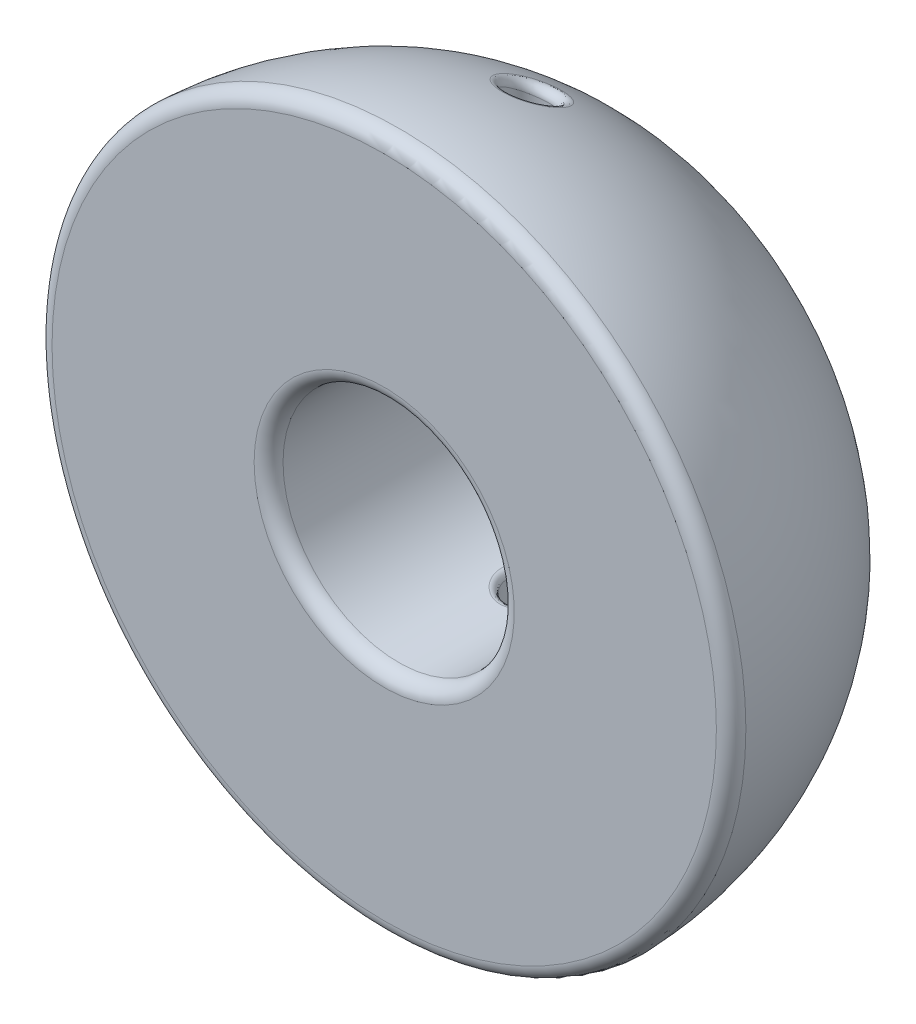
ISO-10303-21;
HEADER;
FILE_DESCRIPTION(('STEP AP214'),'2;1');
FILE_NAME('part.step','',(''),(''),'','','');
FILE_SCHEMA(('AUTOMOTIVE_DESIGN { 1 0 10303 214 1 1 1 1 }'));
ENDSEC;
DATA;
#1=APPLICATION_CONTEXT('core data for automotive mechanical design processes');
#2=APPLICATION_PROTOCOL_DEFINITION('international standard','automotive_design',2000,#1);
#3=PRODUCT_CONTEXT('',#1,'mechanical');
#4=PRODUCT('Part','Part','',(#3));
#5=PRODUCT_RELATED_PRODUCT_CATEGORY('part','',(#4));
#6=PRODUCT_DEFINITION_FORMATION('','',#4);
#7=PRODUCT_DEFINITION_CONTEXT('part definition',#1,'design');
#8=PRODUCT_DEFINITION('design','',#6,#7);
#9=PRODUCT_DEFINITION_SHAPE('','',#8);
#10=(LENGTH_UNIT() NAMED_UNIT(*) SI_UNIT(.MILLI.,.METRE.));
#11=(NAMED_UNIT(*) PLANE_ANGLE_UNIT() SI_UNIT($,.RADIAN.));
#12=(NAMED_UNIT(*) SI_UNIT($,.STERADIAN.) SOLID_ANGLE_UNIT());
#13=UNCERTAINTY_MEASURE_WITH_UNIT(LENGTH_MEASURE(1.E-05),#10,'distance_accuracy_value','');
#14=(GEOMETRIC_REPRESENTATION_CONTEXT(3) GLOBAL_UNCERTAINTY_ASSIGNED_CONTEXT((#13)) GLOBAL_UNIT_ASSIGNED_CONTEXT((#10,
#11,#12)) REPRESENTATION_CONTEXT('',''));
#15=CARTESIAN_POINT('',(0.,0.,0.));
#16=DIRECTION('',(0.,0.,1.));
#17=DIRECTION('',(1.,0.,0.));
#18=AXIS2_PLACEMENT_3D('',#15,#16,#17);
#19=CARTESIAN_POINT('',(0.,4.,5.));
#20=DIRECTION('',(1.,0.,0.));
#21=DIRECTION('',(0.,0.,1.));
#22=AXIS2_PLACEMENT_3D('',#19,#20,#21);
#23=ELLIPSE('',#22,9.99999999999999,8.);
#24=TRIMMED_CURVE('',#23,(PARAMETER_VALUE(2.61799387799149)),
(PARAMETER_VALUE(6.80678408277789)),.T.,.PARAMETER.);
#25=CARTESIAN_POINT('',(0.,0.,5.));
#26=DIRECTION('',(0.,0.,1.));
#27=AXIS1_PLACEMENT('',#25,#26);
#28=SURFACE_OF_REVOLUTION('',#24,#27);
#29=CARTESIAN_POINT('',(-0.148322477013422,-11.058099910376,0.735187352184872));
#30=CARTESIAN_POINT('',(-0.155237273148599,-11.1375795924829,0.733792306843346));
#31=CARTESIAN_POINT('',(-0.170015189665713,-11.202363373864,0.777967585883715));
#32=CARTESIAN_POINT('',(-0.184793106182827,-11.2671471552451,0.822142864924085));
#33=CARTESIAN_POINT('',(-0.201969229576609,-11.2932778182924,0.895552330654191));
#34=CARTESIAN_POINT('',(-0.109139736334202,-11.0628308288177,0.743093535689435));
#35=CARTESIAN_POINT('',(-0.114300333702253,-11.1421536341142,0.742435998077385));
#36=CARTESIAN_POINT('',(-0.125147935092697,-11.2069198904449,0.787372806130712));
#37=CARTESIAN_POINT('',(-0.136029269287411,-11.2716827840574,0.832302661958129));
#38=CARTESIAN_POINT('',(-0.148614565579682,-11.2981138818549,0.906330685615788));
#39=CARTESIAN_POINT('',(-0.0692047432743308,-11.0656903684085,0.747877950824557));
#40=CARTESIAN_POINT('',(-0.0724794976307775,-11.1449219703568,0.74767705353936));
#41=CARTESIAN_POINT('',(-0.0793628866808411,-11.2096750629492,0.79306826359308));
#42=CARTESIAN_POINT('',(-0.0862527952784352,-11.2744280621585,0.8384592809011));
#43=CARTESIAN_POINT('',(-0.094235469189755,-11.3010369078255,0.912853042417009));
#44=CARTESIAN_POINT('',(0.0109621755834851,-11.0675512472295,0.750990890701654));
#45=CARTESIAN_POINT('',(0.0114754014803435,-11.1467222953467,0.751084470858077));
#46=CARTESIAN_POINT('',(0.0125697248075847,-11.2114679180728,0.796773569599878));
#47=CARTESIAN_POINT('',(0.0136571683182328,-11.2762133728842,0.842462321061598));
#48=CARTESIAN_POINT('',(0.0149270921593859,-11.3029391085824,0.917096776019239));
#49=CARTESIAN_POINT('',(0.0511940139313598,-11.0665536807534,0.749321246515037));
#50=CARTESIAN_POINT('',(0.0536346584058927,-11.1457564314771,0.74925489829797));
#51=CARTESIAN_POINT('',(0.0587171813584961,-11.2105066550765,0.794785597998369));
#52=CARTESIAN_POINT('',(0.0638206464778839,-11.2752555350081,0.840313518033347));
#53=CARTESIAN_POINT('',(0.069710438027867,-11.3019194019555,0.914820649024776));
#54=CARTESIAN_POINT('',(0.129158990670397,-11.0608586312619,0.739797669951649));
#55=CARTESIAN_POINT('',(0.135226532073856,-11.1402472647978,0.738833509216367));
#56=CARTESIAN_POINT('',(0.148079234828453,-11.2050204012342,0.783452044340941));
#57=CARTESIAN_POINT('',(0.160950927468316,-11.2697924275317,0.828068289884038));
#58=CARTESIAN_POINT('',(0.175874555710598,-11.2960978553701,0.901837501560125));
#59=CARTESIAN_POINT('',(0.166928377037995,-11.0563070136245,0.732187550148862));
#60=CARTESIAN_POINT('',(0.174724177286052,-11.1358419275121,0.730502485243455));
#61=CARTESIAN_POINT('',(0.19133801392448,-11.2006359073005,0.774396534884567));
#62=CARTESIAN_POINT('',(0.207993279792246,-11.2654239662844,0.818278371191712));
#63=CARTESIAN_POINT('',(0.227304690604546,-11.2914451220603,0.891462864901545));
#64=CARTESIAN_POINT('',(0.240621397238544,-11.0438474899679,0.711385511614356));
#65=CARTESIAN_POINT('',(0.251596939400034,-11.1237945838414,0.707770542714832));
#66=CARTESIAN_POINT('',(0.275602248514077,-11.1886394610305,0.749664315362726));
#67=CARTESIAN_POINT('',(0.299648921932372,-11.2534784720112,0.791546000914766));
#68=CARTESIAN_POINT('',(0.327651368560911,-11.2787084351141,0.863103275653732));
#69=CARTESIAN_POINT('',(0.276542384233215,-11.0359349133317,0.698185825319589));
#70=CARTESIAN_POINT('',(0.288987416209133,-11.1161416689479,0.693349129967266));
#71=CARTESIAN_POINT('',(0.316604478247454,-11.181023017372,0.733978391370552));
#72=CARTESIAN_POINT('',(0.344280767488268,-11.245890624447,0.77457941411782));
#73=CARTESIAN_POINT('',(0.376564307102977,-11.2706197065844,0.845107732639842));
#74=CARTESIAN_POINT('',(0.346180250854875,-11.0168694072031,0.666444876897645));
#75=CARTESIAN_POINT('',(0.361196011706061,-11.0977224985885,0.658749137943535));
#76=CARTESIAN_POINT('',(0.395879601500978,-11.1626834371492,0.696304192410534));
#77=CARTESIAN_POINT('',(0.43062434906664,-11.2276302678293,0.733830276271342));
#78=CARTESIAN_POINT('',(0.471388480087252,-11.2511289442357,0.801832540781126));
#79=CARTESIAN_POINT('',(0.379848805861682,-11.0056632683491,0.647815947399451));
#80=CARTESIAN_POINT('',(0.395971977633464,-11.0868958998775,0.638458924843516));
#81=CARTESIAN_POINT('',(0.434093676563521,-11.1519092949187,0.674212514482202));
#82=CARTESIAN_POINT('',(0.472288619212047,-11.216897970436,0.709915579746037));
#83=CARTESIAN_POINT('',(0.517233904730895,-11.2396725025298,0.776433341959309));
#84=CARTESIAN_POINT('',(0.443591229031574,-10.9804172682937,0.605956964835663));
#85=CARTESIAN_POINT('',(0.46144465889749,-11.0625372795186,0.592996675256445));
#86=CARTESIAN_POINT('',(0.50615173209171,-11.1276587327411,0.624652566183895));
#87=CARTESIAN_POINT('',(0.550932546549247,-11.1927554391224,0.656257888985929));
#88=CARTESIAN_POINT('',(0.604029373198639,-11.2138611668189,0.719358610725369));
#89=CARTESIAN_POINT('',(0.473659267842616,-10.9663729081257,0.582719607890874));
#90=CARTESIAN_POINT('',(0.492142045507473,-11.04898959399,0.567796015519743));
#91=CARTESIAN_POINT('',(0.539988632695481,-11.11417802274,0.597175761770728));
#92=CARTESIAN_POINT('',(0.587913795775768,-11.1793296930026,0.626480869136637));
#93=CARTESIAN_POINT('',(0.644971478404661,-11.1995016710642,0.687673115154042));
#94=CARTESIAN_POINT('',(0.531346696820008,-10.9349061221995,0.530819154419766));
#95=CARTESIAN_POINT('',(0.550583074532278,-11.0186789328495,0.51169581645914));
#96=CARTESIAN_POINT('',(0.604534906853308,-11.0840091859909,0.535929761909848));
#97=CARTESIAN_POINT('',(0.658575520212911,-11.1492979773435,0.560079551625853));
#98=CARTESIAN_POINT('',(0.723520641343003,-11.1673265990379,0.616899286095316));
#99=CARTESIAN_POINT('',(0.558693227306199,-10.9173268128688,0.501906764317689));
#100=CARTESIAN_POINT('',(0.578015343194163,-11.0017555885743,0.480516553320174));
#101=CARTESIAN_POINT('',(0.634913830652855,-11.0671726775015,0.501873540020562));
#102=CARTESIAN_POINT('',(0.69189785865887,-11.1325334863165,0.523117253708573));
#103=CARTESIAN_POINT('',(0.760756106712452,-11.1493504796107,0.577470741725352));
#104=CARTESIAN_POINT('',(0.608210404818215,-10.8799109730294,0.44060897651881));
#105=CARTESIAN_POINT('',(0.627092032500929,-10.9658024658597,0.414692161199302));
#106=CARTESIAN_POINT('',(0.689428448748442,-11.0313932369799,0.429859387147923));
#107=CARTESIAN_POINT('',(0.751851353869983,-11.0969273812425,0.44491263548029));
#108=CARTESIAN_POINT('',(0.82817824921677,-11.1110866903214,0.493870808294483));
#109=CARTESIAN_POINT('',(0.630372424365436,-10.8600707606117,0.408217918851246));
#110=CARTESIAN_POINT('',(0.64871914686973,-10.9467547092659,0.380016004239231));
#111=CARTESIAN_POINT('',(0.713553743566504,-11.0124468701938,0.391895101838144));
#112=CARTESIAN_POINT('',(0.778463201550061,-11.0780680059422,0.40363266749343));
#113=CARTESIAN_POINT('',(0.858353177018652,-11.0907952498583,0.449691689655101));
#114=CARTESIAN_POINT('',(0.670879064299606,-10.8168359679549,0.337942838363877));
#115=CARTESIAN_POINT('',(0.687505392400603,-10.9053283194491,0.305141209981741));
#116=CARTESIAN_POINT('',(0.75701983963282,-10.9712384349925,0.309788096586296));
#117=CARTESIAN_POINT('',(0.826622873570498,-11.0370646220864,0.314267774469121));
#118=CARTESIAN_POINT('',(0.913503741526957,-11.0465725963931,0.353832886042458));
#119=CARTESIAN_POINT('',(0.688724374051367,-10.7932823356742,0.299826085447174));
#120=CARTESIAN_POINT('',(0.704088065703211,-10.8827942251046,0.264708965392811));
#121=CARTESIAN_POINT('',(0.775762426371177,-10.9488313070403,0.265395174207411));
#122=CARTESIAN_POINT('',(0.847500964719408,-11.0147679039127,0.265883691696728));
#123=CARTESIAN_POINT('',(0.937799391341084,-11.0224783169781,0.301835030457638));
#124=CARTESIAN_POINT('',(0.71772285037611,-10.7446990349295,0.221620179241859));
#125=CARTESIAN_POINT('',(0.729957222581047,-10.8364399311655,0.182271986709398));
#126=CARTESIAN_POINT('',(0.805304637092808,-10.9027313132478,0.174688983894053));
#127=CARTESIAN_POINT('',(0.8807170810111,-10.96892155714,0.16690695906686));
#128=CARTESIAN_POINT('',(0.977277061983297,-10.9727734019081,0.195137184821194));
#129=CARTESIAN_POINT('',(0.728872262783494,-10.7196685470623,0.181529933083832));
#130=CARTESIAN_POINT('',(0.739212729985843,-10.8126040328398,0.140242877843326));
#131=CARTESIAN_POINT('',(0.816099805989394,-10.8790377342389,0.1283746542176));
#132=CARTESIAN_POINT('',(0.893019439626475,-10.9453564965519,0.116283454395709));
#133=CARTESIAN_POINT('',(0.992453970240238,-10.9471619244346,0.140435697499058));
#134=CARTESIAN_POINT('',(0.745048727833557,-10.6665759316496,0.0969815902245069));
#135=CARTESIAN_POINT('',(0.750952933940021,-10.7621964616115,0.0522362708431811));
#136=CARTESIAN_POINT('',(0.830327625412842,-10.8289394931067,0.0311846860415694));
#137=CARTESIAN_POINT('',(0.909740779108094,-10.8955474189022,0.00987099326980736));
#138=CARTESIAN_POINT('',(1.01446975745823,-10.8928290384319,0.0250596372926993));
#139=CARTESIAN_POINT('',(0.749487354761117,-10.638435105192,0.052438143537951));
#140=CARTESIAN_POINT('',(0.752765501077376,-10.7355588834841,0.00622054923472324));
#141=CARTESIAN_POINT('',(0.833070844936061,-10.8024735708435,-0.0197491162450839));
#142=CARTESIAN_POINT('',(0.913365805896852,-10.8692405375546,-0.0460004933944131));
#143=CARTESIAN_POINT('',(1.0205073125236,-10.8640264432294,-0.0357325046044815));
#144=CARTESIAN_POINT('',(0.750428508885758,-10.5818407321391,-0.0365509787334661));
#145=CARTESIAN_POINT('',(0.748135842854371,-10.682210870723,-0.0848481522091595));
#146=CARTESIAN_POINT('',(0.829440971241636,-10.7494749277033,-0.120841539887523));
#147=CARTESIAN_POINT('',(0.910736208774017,-10.816590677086,-0.157117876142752));
#148=CARTESIAN_POINT('',(1.02177547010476,-10.8060910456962,-0.157199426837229));
#149=CARTESIAN_POINT('',(0.746939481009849,-10.5533875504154,-0.0809967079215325));
#150=CARTESIAN_POINT('',(0.741655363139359,-10.6554912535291,-0.129911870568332));
#151=CARTESIAN_POINT('',(0.823077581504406,-10.7229423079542,-0.171000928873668));
#152=CARTESIAN_POINT('',(0.904436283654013,-10.7902387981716,-0.212379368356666));
#153=CARTESIAN_POINT('',(1.01701757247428,-10.7769586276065,-0.217874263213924));
#154=CARTESIAN_POINT('',(0.731772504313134,-10.4954824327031,-0.17082743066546));
#155=CARTESIAN_POINT('',(0.720334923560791,-10.6013791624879,-0.219996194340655));
#156=CARTESIAN_POINT('',(0.801072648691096,-10.6692323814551,-0.271580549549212));
#157=CARTESIAN_POINT('',(0.881740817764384,-10.7369153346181,-0.323483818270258));
#158=CARTESIAN_POINT('',(0.996351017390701,-10.717660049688,-0.340522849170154));
#159=CARTESIAN_POINT('',(0.719707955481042,-10.4660484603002,-0.216154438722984));
#160=CARTESIAN_POINT('',(0.705055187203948,-10.5740219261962,-0.264892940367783));
#161=CARTESIAN_POINT('',(0.784998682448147,-10.6420856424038,-0.321896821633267));
#162=CARTESIAN_POINT('',(0.864810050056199,-10.7099809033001,-0.379209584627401));
#163=CARTESIAN_POINT('',(0.979915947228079,-10.6875117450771,-0.40241824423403));
#164=CARTESIAN_POINT('',(0.687179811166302,-10.408520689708,-0.304102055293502));
#165=CARTESIAN_POINT('',(0.666516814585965,-10.5208945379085,-0.350806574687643));
#166=CARTESIAN_POINT('',(0.743827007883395,-10.5893961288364,-0.418546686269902));
#167=CARTESIAN_POINT('',(0.82100587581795,-10.6577290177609,-0.486596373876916));
#168=CARTESIAN_POINT('',(0.935610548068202,-10.628575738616,-0.522530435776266));
#169=CARTESIAN_POINT('',(0.666731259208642,-10.3804245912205,-0.346727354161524));
#170=CARTESIAN_POINT('',(0.643219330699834,-10.4951291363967,-0.391809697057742));
#171=CARTESIAN_POINT('',(0.71874547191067,-10.5638505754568,-0.464887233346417));
#172=CARTESIAN_POINT('',(0.794084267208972,-10.632416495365,-0.538243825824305));
#173=CARTESIAN_POINT('',(0.907760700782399,-10.5997857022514,-0.580753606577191));
#174=CARTESIAN_POINT('',(0.618098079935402,-10.3269001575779,-0.427361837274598));
#175=CARTESIAN_POINT('',(0.589863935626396,-10.4464190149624,-0.468128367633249));
#176=CARTESIAN_POINT('',(0.660776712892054,-10.5155960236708,-0.551504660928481));
#177=CARTESIAN_POINT('',(0.731507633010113,-10.584621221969,-0.63515355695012));
#178=CARTESIAN_POINT('',(0.841530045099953,-10.544928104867,-0.690909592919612));
#179=CARTESIAN_POINT('',(0.590033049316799,-10.3014383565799,-0.46543025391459));
#180=CARTESIAN_POINT('',(0.559868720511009,-10.4234547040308,-0.503485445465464));
#181=CARTESIAN_POINT('',(0.628011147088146,-10.4928504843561,-0.591861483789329));
#182=CARTESIAN_POINT('',(0.695933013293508,-10.5621187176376,-0.680461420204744));
#183=CARTESIAN_POINT('',(0.803312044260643,-10.5188264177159,-0.742923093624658));
#184=CARTESIAN_POINT('',(0.526593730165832,-10.2538434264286,-0.536140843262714));
#185=CARTESIAN_POINT('',(0.494029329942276,-10.3808935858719,-0.56799339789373));
#186=CARTESIAN_POINT('',(0.555592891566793,-10.4507458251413,-0.665814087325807));
#187=CARTESIAN_POINT('',(0.616938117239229,-10.5204704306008,-0.763859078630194));
#188=CARTESIAN_POINT('',(0.716927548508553,-10.4700262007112,-0.839547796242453));
#189=CARTESIAN_POINT('',(0.491238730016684,-10.2317017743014,-0.568796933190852));
#190=CARTESIAN_POINT('',(0.458179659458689,-10.3613179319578,-0.59710840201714));
#191=CARTESIAN_POINT('',(0.515958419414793,-10.4313780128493,-0.699427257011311));
#192=CARTESIAN_POINT('',(0.573508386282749,-10.5013455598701,-0.801905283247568));
#193=CARTESIAN_POINT('',(0.668787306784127,-10.4473189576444,-0.884177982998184));
#194=CARTESIAN_POINT('',(0.417257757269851,-10.1935361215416,-0.624790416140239));
#195=CARTESIAN_POINT('',(0.385083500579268,-10.327875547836,-0.646113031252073));
#196=CARTESIAN_POINT('',(0.434667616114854,-10.3983369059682,-0.75625138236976));
#197=CARTESIAN_POINT('',(0.4840582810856,-10.4687192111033,-0.86652565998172));
#198=CARTESIAN_POINT('',(0.56805771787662,-10.4081721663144,-0.960710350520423));
#199=CARTESIAN_POINT('',(0.379155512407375,-10.1771545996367,-0.648679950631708));
#200=CARTESIAN_POINT('',(0.348199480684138,-10.3136919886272,-0.666532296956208));
#201=CARTESIAN_POINT('',(0.393460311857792,-10.3843220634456,-0.780098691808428));
#202=CARTESIAN_POINT('',(0.438548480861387,-10.4549045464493,-0.893745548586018));
#203=CARTESIAN_POINT('',(0.516181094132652,-10.3913664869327,-0.993366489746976));
#204=CARTESIAN_POINT('',(0.298598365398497,-10.1490820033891,-0.689471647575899));
#205=CARTESIAN_POINT('',(0.271758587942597,-10.2895544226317,-0.70088323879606));
#206=CARTESIAN_POINT('',(0.30770848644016,-10.3605122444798,-0.820341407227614));
#207=CARTESIAN_POINT('',(0.343486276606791,-10.4314219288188,-0.939880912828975));
#208=CARTESIAN_POINT('',(0.406505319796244,-10.3625638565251,-1.04913103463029));
#209=CARTESIAN_POINT('',(0.256155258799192,-10.1373786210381,-0.706392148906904));
#210=CARTESIAN_POINT('',(0.232241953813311,-10.2796200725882,-0.714786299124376));
#211=CARTESIAN_POINT('',(0.263173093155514,-10.3507061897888,-0.83675638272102));
#212=CARTESIAN_POINT('',(0.293982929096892,-10.4217731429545,-0.958758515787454));
#213=CARTESIAN_POINT('',(0.348722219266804,-10.3505542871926,-1.07226449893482));
#214=CARTESIAN_POINT('',(0.16683485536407,-10.1191239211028,-0.732732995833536));
#215=CARTESIAN_POINT('',(0.150230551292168,-10.2641799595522,-0.736244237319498));
#216=CARTESIAN_POINT('',(0.170514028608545,-10.3354949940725,-0.862119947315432));
#217=CARTESIAN_POINT('',(0.190666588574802,-10.406787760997,-0.988032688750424));
#218=CARTESIAN_POINT('',(0.227121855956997,-10.3318208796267,-1.10827862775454));
#219=CARTESIAN_POINT('',(0.119858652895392,-10.112751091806,-0.741893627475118));
#220=CARTESIAN_POINT('',(0.107747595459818,-10.258854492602,-0.743541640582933));
#221=CARTESIAN_POINT('',(0.122320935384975,-10.3302421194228,-0.870810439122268));
#222=CARTESIAN_POINT('',(0.136848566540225,-10.4016266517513,-0.99808440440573));
#223=CARTESIAN_POINT('',(0.163170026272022,-10.3252801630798,-1.12080425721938));
#224=CARTESIAN_POINT('',(0.0344216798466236,-10.1069846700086,-0.750181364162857));
#225=CARTESIAN_POINT('',(0.0308493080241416,-10.2540300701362,-0.750148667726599));
#226=CARTESIAN_POINT('',(0.0350522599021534,-10.3254913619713,-0.878667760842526));
#227=CARTESIAN_POINT('',(0.0392235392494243,-10.3969514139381,-1.00718886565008));
#228=CARTESIAN_POINT('',(0.0468599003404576,-10.3193618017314,-1.1321363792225));
#229=CARTESIAN_POINT('',(-0.00384529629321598,-10.106442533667,-0.750959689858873));
#230=CARTESIAN_POINT('',(-0.0034238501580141,-10.2535783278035,-0.750764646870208));
#231=CARTESIAN_POINT('',(-0.00390146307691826,-10.3250463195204,-0.879402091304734));
#232=CARTESIAN_POINT('',(-0.00436119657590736,-10.3965138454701,-1.00804028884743));
#233=CARTESIAN_POINT('',(-0.005234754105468,-10.3188053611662,-1.13320063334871));
#234=CARTESIAN_POINT('',(-0.0800134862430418,-10.1094111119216,-0.746694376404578));
#235=CARTESIAN_POINT('',(-0.071859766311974,-10.2560602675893,-0.747369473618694));
#236=CARTESIAN_POINT('',(-0.0815909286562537,-10.327489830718,-0.875363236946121));
#237=CARTESIAN_POINT('',(-0.0913047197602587,-10.3989187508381,-1.00335807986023));
#238=CARTESIAN_POINT('',(-0.108926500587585,-10.3218521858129,-1.12736848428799));
#239=CARTESIAN_POINT('',(-0.117914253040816,-10.1129262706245,-0.741644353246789));
#240=CARTESIAN_POINT('',(-0.105979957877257,-10.2589945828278,-0.743357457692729));
#241=CARTESIAN_POINT('',(-0.120326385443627,-10.3303820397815,-0.870584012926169));
#242=CARTESIAN_POINT('',(-0.134609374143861,-10.4017618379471,-0.997823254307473));
#243=CARTESIAN_POINT('',(-0.160522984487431,-10.325460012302,-1.12046335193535));
#244=CARTESIAN_POINT('',(-0.192095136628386,-10.1238108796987,-0.725970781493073));
#245=CARTESIAN_POINT('',(-0.173387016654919,-10.2681502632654,-0.730729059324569));
#246=CARTESIAN_POINT('',(-0.19665981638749,-10.3393991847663,-0.8556116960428));
#247=CARTESIAN_POINT('',(-0.219870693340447,-10.4106409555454,-0.980506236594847));
#248=CARTESIAN_POINT('',(-0.26151093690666,-10.3366307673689,-1.0990330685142));
#249=CARTESIAN_POINT('',(-0.228379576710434,-10.131169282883,-0.71536320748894));
#250=CARTESIAN_POINT('',(-0.206638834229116,-10.2743516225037,-0.72214058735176));
#251=CARTESIAN_POINT('',(-0.234260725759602,-10.3455148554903,-0.845434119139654));
#252=CARTESIAN_POINT('',(-0.261784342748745,-10.4166575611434,-0.968762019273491));
#253=CARTESIAN_POINT('',(-0.310908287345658,-10.3441823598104,-1.08452975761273));
#254=CARTESIAN_POINT('',(-0.29856829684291,-10.1493738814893,-0.689032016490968));
#255=CARTESIAN_POINT('',(-0.271842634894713,-10.2898390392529,-0.700436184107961));
#256=CARTESIAN_POINT('',(-0.307745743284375,-10.3607804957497,-0.819859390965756));
#257=CARTESIAN_POINT('',(-0.34355045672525,-10.4317016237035,-0.939316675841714));
#258=CARTESIAN_POINT('',(-0.406464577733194,-10.3628629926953,-1.0485304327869));
#259=CARTESIAN_POINT('',(-0.332468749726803,-10.1602255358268,-0.673300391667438));
#260=CARTESIAN_POINT('',(-0.303765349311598,-10.2991143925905,-0.687335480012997));
#261=CARTESIAN_POINT('',(-0.343627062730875,-10.3699352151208,-0.804454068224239));
#262=CARTESIAN_POINT('',(-0.383366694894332,-10.4407186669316,-0.921636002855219));
#263=CARTESIAN_POINT('',(-0.452618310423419,-10.3739976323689,-1.02702347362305));
#264=CARTESIAN_POINT('',(-0.39810917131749,-10.185324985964,-0.636759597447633));
#265=CARTESIAN_POINT('',(-0.366573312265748,-10.3207830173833,-0.65631076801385));
#266=CARTESIAN_POINT('',(-0.41395939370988,-10.3913167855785,-0.768187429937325));
#267=CARTESIAN_POINT('',(-0.461217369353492,-10.4618118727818,-0.880129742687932));
#268=CARTESIAN_POINT('',(-0.541986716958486,-10.3997483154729,-0.977071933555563));
#269=CARTESIAN_POINT('',(-0.429748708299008,-10.1996681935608,-0.615807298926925));
#270=CARTESIAN_POINT('',(-0.397382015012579,-10.3332469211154,-0.638275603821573));
#271=CARTESIAN_POINT('',(-0.448330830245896,-10.4036305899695,-0.747170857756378));
#272=CARTESIAN_POINT('',(-0.49914308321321,-10.4739574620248,-0.856164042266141));
#273=CARTESIAN_POINT('',(-0.585064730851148,-10.414462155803,-0.948431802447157));
#274=CARTESIAN_POINT('',(-0.489109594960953,-10.2309966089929,-0.569814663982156));
#275=CARTESIAN_POINT('',(-0.456205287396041,-10.360735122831,-0.597920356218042));
#276=CARTESIAN_POINT('',(-0.513697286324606,-10.4307865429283,-0.700414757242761));
#277=CARTESIAN_POINT('',(-0.571048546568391,-10.5007795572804,-0.803009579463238));
#278=CARTESIAN_POINT('',(-0.665888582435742,-10.44659531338,-0.885569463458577));
#279=CARTESIAN_POINT('',(-0.516824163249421,-10.2479862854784,-0.544767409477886));
#280=CARTESIAN_POINT('',(-0.484211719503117,-10.3757458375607,-0.575621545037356));
#281=CARTESIAN_POINT('',(-0.544686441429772,-10.4456329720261,-0.674667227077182));
#282=CARTESIAN_POINT('',(-0.605019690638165,-10.5154427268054,-0.773847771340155));
#283=CARTESIAN_POINT('',(-0.703625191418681,-10.4640192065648,-0.851337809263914));
#284=CARTESIAN_POINT('',(-0.598385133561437,-10.305608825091,-0.459339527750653));
#285=CARTESIAN_POINT('',(-0.567942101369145,-10.4269830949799,-0.498379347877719));
#286=CARTESIAN_POINT('',(-0.637193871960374,-10.4964438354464,-0.585727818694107));
#287=CARTESIAN_POINT('',(-0.705816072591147,-10.5655580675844,-0.673684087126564));
#288=CARTESIAN_POINT('',(-0.814683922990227,-10.523104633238,-0.734597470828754));
#289=CARTESIAN_POINT('',(-0.644015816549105,-10.3502901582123,-0.392421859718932));
#290=CARTESIAN_POINT('',(-0.617489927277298,-10.4673680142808,-0.43593406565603));
#291=CARTESIAN_POINT('',(-0.69108642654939,-10.5364910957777,-0.514477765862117));
#292=CARTESIAN_POINT('',(-0.764249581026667,-10.6051479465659,-0.593871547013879));
#293=CARTESIAN_POINT('',(-0.876824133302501,-10.5689064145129,-0.643169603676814));
#294=CARTESIAN_POINT('',(-0.71529794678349,-10.4494417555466,-0.241878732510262));
#295=CARTESIAN_POINT('',(-0.698512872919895,-10.5582889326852,-0.291014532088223));
#296=CARTESIAN_POINT('',(-0.778477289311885,-10.6266635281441,-0.350720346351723));
#297=CARTESIAN_POINT('',(-0.857877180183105,-10.6944764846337,-0.411442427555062));
#298=CARTESIAN_POINT('',(-0.973906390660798,-10.6705049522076,-0.437541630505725));
#299=CARTESIAN_POINT('',(-0.738355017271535,-10.5044471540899,-0.157237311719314));
#300=CARTESIAN_POINT('',(-0.727903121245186,-10.609423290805,-0.207214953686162));
#301=CARTESIAN_POINT('',(-0.809247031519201,-10.6774049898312,-0.256767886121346));
#302=CARTESIAN_POINT('',(-0.890434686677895,-10.7448199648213,-0.307390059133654));
#303=CARTESIAN_POINT('',(-1.00531641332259,-10.7268461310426,-0.321959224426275));
#304=CARTESIAN_POINT('',(-0.750997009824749,-10.5888906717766,-0.0255220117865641));
#305=CARTESIAN_POINT('',(-0.749398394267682,-10.6888226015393,-0.0736656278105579));
#306=CARTESIAN_POINT('',(-0.830669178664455,-10.7560524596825,-0.108381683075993));
#307=CARTESIAN_POINT('',(-0.911894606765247,-10.823112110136,-0.143418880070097));
#308=CARTESIAN_POINT('',(-1.022551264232,-10.8133090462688,-0.142143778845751));
#309=CARTESIAN_POINT('',(-0.751142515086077,-10.6183630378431,0.0207819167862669));
#310=CARTESIAN_POINT('',(-0.752521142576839,-10.716602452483,-0.0263153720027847));
#311=CARTESIAN_POINT('',(-0.833305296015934,-10.7836425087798,-0.0558136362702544));
#312=CARTESIAN_POINT('',(-0.914102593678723,-10.8505266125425,-0.0856116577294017));
#313=CARTESIAN_POINT('',(-1.02275646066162,-10.8434803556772,-0.0789394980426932));
#314=CARTESIAN_POINT('',(-0.742892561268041,-10.6765844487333,0.11285646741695));
#315=CARTESIAN_POINT('',(-0.749664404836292,-10.7716672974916,0.0686571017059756));
#316=CARTESIAN_POINT('',(-0.828672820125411,-10.8383603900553,0.0493648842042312));
#317=CARTESIAN_POINT('',(-0.90769410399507,-10.9049021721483,0.0297818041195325));
#318=CARTESIAN_POINT('',(-1.0115359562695,-10.9030724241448,0.0467244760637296));
#319=CARTESIAN_POINT('',(-0.734510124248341,-10.7053345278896,0.158627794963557));
#320=CARTESIAN_POINT('',(-0.743748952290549,-10.79896563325,0.116294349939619));
#321=CARTESIAN_POINT('',(-0.821419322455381,-10.8654888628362,0.101975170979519));
#322=CARTESIAN_POINT('',(-0.899153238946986,-10.9318761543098,0.0873902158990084));
#323=CARTESIAN_POINT('',(-1.0001279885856,-10.9324942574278,0.109185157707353));
#324=CARTESIAN_POINT('',(-0.70914132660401,-10.7615401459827,0.248644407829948));
#325=CARTESIAN_POINT('',(-0.722558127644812,-10.8524657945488,0.210621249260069));
#326=CARTESIAN_POINT('',(-0.796777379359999,-10.9186859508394,0.205952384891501));
#327=CARTESIAN_POINT('',(-0.871060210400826,-10.9847676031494,0.201012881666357));
#328=CARTESIAN_POINT('',(-0.965595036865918,-10.990004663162,0.232009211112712));
#329=CARTESIAN_POINT('',(-0.69209067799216,-10.7889843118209,0.292875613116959));
#330=CARTESIAN_POINT('',(-0.707255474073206,-10.8786784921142,0.257332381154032));
#331=CARTESIAN_POINT('',(-0.779313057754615,-10.9447450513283,0.257306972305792));
#332=CARTESIAN_POINT('',(-0.851475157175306,-11.0106958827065,0.257051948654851));
#333=CARTESIAN_POINT('',(-0.942382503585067,-11.018081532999,0.292353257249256));
#334=CARTESIAN_POINT('',(-0.649584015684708,-10.8414507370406,0.377876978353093));
#335=CARTESIAN_POINT('',(-0.667328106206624,-10.9288763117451,0.347570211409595));
#336=CARTESIAN_POINT('',(-0.734338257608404,-10.9946798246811,0.356381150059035));
#337=CARTESIAN_POINT('',(-0.801451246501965,-11.0603688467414,0.364964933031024));
#338=CARTESIAN_POINT('',(-0.884510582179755,-11.0717509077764,0.408307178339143));
#339=CARTESIAN_POINT('',(-0.624146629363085,-10.8664782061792,0.418654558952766));
#340=CARTESIAN_POINT('',(-0.642755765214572,-10.9528900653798,0.39114282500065));
#341=CARTESIAN_POINT('',(-0.706850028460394,-11.0185601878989,0.404108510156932));
#342=CARTESIAN_POINT('',(-0.771072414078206,-11.0841417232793,0.416896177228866));
#343=CARTESIAN_POINT('',(-0.849876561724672,-11.0973487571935,0.463927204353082));
#344=CARTESIAN_POINT('',(-0.566993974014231,-10.9119364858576,0.493042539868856));
#345=CARTESIAN_POINT('',(-0.586349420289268,-10.9965575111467,0.470941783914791));
#346=CARTESIAN_POINT('',(-0.644130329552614,-11.0620103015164,0.491433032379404));
#347=CARTESIAN_POINT('',(-0.70202482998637,-11.1273842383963,0.51176578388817));
#348=CARTESIAN_POINT('',(-0.772058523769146,-11.1438384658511,0.56538234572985));
#349=CARTESIAN_POINT('',(-0.535720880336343,-10.9325483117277,0.526929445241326));
#350=CARTESIAN_POINT('',(-0.555031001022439,-11.0164006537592,0.507477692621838));
#351=CARTESIAN_POINT('',(-0.609431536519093,-11.0817484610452,0.531339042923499));
#352=CARTESIAN_POINT('',(-0.663951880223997,-11.147040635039,0.555087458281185));
#353=CARTESIAN_POINT('',(-0.729476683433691,-11.1649157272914,0.611595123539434));
#354=CARTESIAN_POINT('',(-0.466785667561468,-10.9700937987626,0.588857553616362));
#355=CARTESIAN_POINT('',(-0.48519437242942,-11.0525641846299,0.574413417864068));
#356=CARTESIAN_POINT('',(-0.532295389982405,-11.1177456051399,0.604419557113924));
#357=CARTESIAN_POINT('',(-0.579514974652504,-11.1828714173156,0.634312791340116));
#358=CARTESIAN_POINT('',(-0.635612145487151,-11.2033063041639,0.69604307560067));
#359=CARTESIAN_POINT('',(-0.429127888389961,-10.9870299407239,0.616902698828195));
#360=CARTESIAN_POINT('',(-0.446680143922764,-11.0689097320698,0.604858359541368));
#361=CARTESIAN_POINT('',(-0.489863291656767,-11.1340069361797,0.637598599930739));
#362=CARTESIAN_POINT('',(-0.533154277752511,-11.1990706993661,0.670270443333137));
#363=CARTESIAN_POINT('',(-0.584335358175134,-11.220622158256,0.73428362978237));
#364=CARTESIAN_POINT('',(-0.352306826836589,-11.0150914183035,0.663479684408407));
#365=CARTESIAN_POINT('',(-0.367562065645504,-11.095997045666,0.65549917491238));
#366=CARTESIAN_POINT('',(-0.402854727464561,-11.1609720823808,0.692780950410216));
#367=CARTESIAN_POINT('',(-0.438236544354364,-11.2259195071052,0.730006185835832));
#368=CARTESIAN_POINT('',(-0.479730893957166,-11.249311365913,0.797789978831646));
#369=CARTESIAN_POINT('',(-0.313616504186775,-11.0266129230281,0.682657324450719));
#370=CARTESIAN_POINT('',(-0.327488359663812,-11.1071343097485,0.676413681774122));
#371=CARTESIAN_POINT('',(-0.358853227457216,-11.1720542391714,0.715540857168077));
#372=CARTESIAN_POINT('',(-0.390287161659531,-11.2369606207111,0.754640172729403));
#373=CARTESIAN_POINT('',(-0.427047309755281,-11.2610899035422,0.823936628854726));
#374=CARTESIAN_POINT('',(-0.233022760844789,-11.0455321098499,0.714191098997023));
#375=CARTESIAN_POINT('',(-0.243710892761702,-11.125418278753,0.710822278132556));
#376=CARTESIAN_POINT('',(-0.26693623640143,-11.1902601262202,0.75299503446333));
#377=CARTESIAN_POINT('',(-0.290230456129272,-11.2550881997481,0.795139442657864));
#378=CARTESIAN_POINT('',(-0.317304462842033,-11.2804306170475,0.8669283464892));
#379=CARTESIAN_POINT('',(-0.1911213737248,-11.0529323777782,0.726551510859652));
#380=CARTESIAN_POINT('',(-0.199987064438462,-11.1325795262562,0.724343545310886));
#381=CARTESIAN_POINT('',(-0.219023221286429,-11.1973863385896,0.767694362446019));
#382=CARTESIAN_POINT('',(-0.238098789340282,-11.2621890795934,0.811036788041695));
#383=CARTESIAN_POINT('',(-0.26024796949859,-11.2879954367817,0.883779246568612));
#384=CARTESIAN_POINT('',(-0.148322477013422,-11.058099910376,0.735187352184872));
#385=CARTESIAN_POINT('',(-0.155237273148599,-11.1375795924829,0.733792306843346));
#386=CARTESIAN_POINT('',(-0.170015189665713,-11.202363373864,0.777967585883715));
#387=CARTESIAN_POINT('',(-0.184793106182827,-11.2671471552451,0.822142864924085));
#388=CARTESIAN_POINT('',(-0.201969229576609,-11.2932778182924,0.895552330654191));
#389=(BOUNDED_SURFACE() B_SPLINE_SURFACE(3,2,((#29,#30,#31,#32,#33),(#34,#35,#36,#37,#38),(#39,
#40,#41,#42,#43),(#44,#45,#46,#47,#48),(#49,#50,#51,#52,#53),(#54,#55,#56,#57,#58),(#59,#60,#61,
#62,#63),(#64,#65,#66,#67,#68),(#69,#70,#71,#72,#73),(#74,#75,#76,#77,#78),(#79,#80,#81,#82,
#83),(#84,#85,#86,#87,#88),(#89,#90,#91,#92,#93),(#94,#95,#96,#97,#98),(#99,#100,#101,#102,
#103),(#104,#105,#106,#107,#108),(#109,#110,#111,#112,#113),(#114,#115,#116,#117,#118),(#119,
#120,#121,#122,#123),(#124,#125,#126,#127,#128),(#129,#130,#131,#132,#133),(#134,#135,#136,#137,
#138),(#139,#140,#141,#142,#143),(#144,#145,#146,#147,#148),(#149,#150,#151,#152,#153),(#154,
#155,#156,#157,#158),(#159,#160,#161,#162,#163),(#164,#165,#166,#167,#168),(#169,#170,#171,#172,
#173),(#174,#175,#176,#177,#178),(#179,#180,#181,#182,#183),(#184,#185,#186,#187,#188),(#189,
#190,#191,#192,#193),(#194,#195,#196,#197,#198),(#199,#200,#201,#202,#203),(#204,#205,#206,#207,
#208),(#209,#210,#211,#212,#213),(#214,#215,#216,#217,#218),(#219,#220,#221,#222,#223),(#224,
#225,#226,#227,#228),(#229,#230,#231,#232,#233),(#234,#235,#236,#237,#238),(#239,#240,#241,#242,
#243),(#244,#245,#246,#247,#248),(#249,#250,#251,#252,#253),(#254,#255,#256,#257,#258),(#259,
#260,#261,#262,#263),(#264,#265,#266,#267,#268),(#269,#270,#271,#272,#273),(#274,#275,#276,#277,
#278),(#279,#280,#281,#282,#283),(#284,#285,#286,#287,#288),(#289,#290,#291,#292,#293),(#294,
#295,#296,#297,#298),(#299,#300,#301,#302,#303),(#304,#305,#306,#307,#308),(#309,#310,#311,#312,
#313),(#314,#315,#316,#317,#318),(#319,#320,#321,#322,#323),(#324,#325,#326,#327,#328),(#329,
#330,#331,#332,#333),(#334,#335,#336,#337,#338),(#339,#340,#341,#342,#343),(#344,#345,#346,#347,
#348),(#349,#350,#351,#352,#353),(#354,#355,#356,#357,#358),(#359,#360,#361,#362,#363),(#364,
#365,#366,#367,#368),(#369,#370,#371,#372,#373),(#374,#375,#376,#377,#378),(#379,#380,#381,#382,
#383),(#384,#385,#386,#387,#388)),.UNSPECIFIED.,.T.,.F.,.F.) B_SPLINE_SURFACE_WITH_KNOTS((4,2,2,
2,2,2,2,2,2,2,2,2,2,2,2,2,2,2,2,2,2,2,2,2,2,2,2,2,2,2,2,2,2,2,2,4),(3,2,3),(0.,
0.160300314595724,0.320555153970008,0.474557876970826,0.628775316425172,0.785635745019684,
0.942746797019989,1.10973706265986,1.27700326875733,1.45880969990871,1.64071796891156,
1.83780355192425,2.03467928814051,2.24104443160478,2.44704090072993,2.64997322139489,
2.85237534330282,3.03778665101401,3.22270688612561,3.41359586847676,3.56597834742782,
3.71852789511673,3.8706413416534,4.02299365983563,4.18010024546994,4.33747504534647,
4.68238634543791,5.06343721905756,5.2678822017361,5.47201546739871,5.67768527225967,
5.88290131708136,6.07638227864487,6.26973224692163,6.44493665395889,6.62003100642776),(0.,0.5,
1.),.UNSPECIFIED.) GEOMETRIC_REPRESENTATION_ITEM() RATIONAL_B_SPLINE_SURFACE(((1.,
0.952653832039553,1.,0.952653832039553,1.),(1.,0.953008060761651,1.,0.953008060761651,1.),(1.,
0.953221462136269,1.,0.953221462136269,1.),(1.,0.953360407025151,1.,0.953360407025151,1.),(1.,
0.953286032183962,1.,0.953286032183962,1.),(1.,0.952860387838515,1.,0.952860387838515,1.),(1.,
0.952520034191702,1.,0.952520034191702,1.),(1.,0.951584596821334,1.,0.951584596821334,1.),(1.,
0.95098915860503,1.,0.95098915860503,1.),(1.,0.949546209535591,1.,0.949546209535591,1.),(1.,
0.94869455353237,1.,0.94869455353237,1.),(1.,0.94676137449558,1.,0.94676137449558,1.),(1.,
0.945679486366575,1.,0.945679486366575,1.),(1.,0.943233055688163,1.,0.943233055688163,1.),(1.,
0.941855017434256,1.,0.941855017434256,1.),(1.,0.938887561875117,1.,0.938887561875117,1.),(1.,
0.937297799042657,1.,0.937297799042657,1.),(1.,0.933786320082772,1.,0.933786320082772,1.),(1.,
0.931847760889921,1.,0.931847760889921,1.),(1.,0.927781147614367,1.,0.927781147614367,1.),(1.,
0.92565298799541,1.,0.92565298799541,1.),(1.,0.921052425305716,1.,0.921052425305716,1.),(1.,
0.918566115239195,1.,0.918566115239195,1.),(1.,0.913449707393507,1.,0.913449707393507,1.),(1.,
0.910819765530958,1.,0.910819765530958,1.),(1.,0.905331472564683,1.,0.905331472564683,1.),(1.,
0.902468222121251,1.,0.902468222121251,1.),(1.,0.896711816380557,1.,0.896711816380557,1.),(1.,
0.893818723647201,1.,0.893818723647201,1.),(1.,0.888144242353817,1.,0.888144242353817,1.),(1.,
0.885361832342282,1.,0.885361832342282,1.),(1.,0.880012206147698,1.,0.880012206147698,1.),(1.,
0.877444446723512,1.,0.877444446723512,1.),(1.,0.872906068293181,1.,0.872906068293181,1.),(1.,
0.870903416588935,1.,0.870903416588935,1.),(1.,0.86740891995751,1.,0.86740891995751,1.),(1.,
0.865915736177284,1.,0.865915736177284,1.),(1.,0.863562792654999,1.,0.863562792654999,1.),(1.,
0.862725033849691,1.,0.862725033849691,1.),(1.,0.861966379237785,1.,0.861966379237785,1.),(1.,
0.861894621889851,1.,0.861894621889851,1.),(1.,0.86228578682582,1.,0.86228578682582,1.),(1.,
0.862749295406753,1.,0.862749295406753,1.),(1.,0.864167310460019,1.,0.864167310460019,1.),(1.,
0.865120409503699,1.,0.865120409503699,1.),(1.,0.867438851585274,1.,0.867438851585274,1.),(1.,
0.868804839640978,1.,0.868804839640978,1.),(1.,0.871900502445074,1.,0.871900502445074,1.),(1.,
0.873640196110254,1.,0.873640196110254,1.),(1.,0.877354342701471,1.,0.877354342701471,1.),(1.,
0.879329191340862,1.,0.879329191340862,1.),(1.,0.885865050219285,1.,0.885865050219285,1.),(1.,
0.890703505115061,1.,0.890703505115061,1.),(1.,0.900895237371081,1.,0.900895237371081,1.),(1.,
0.906249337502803,1.,0.906249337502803,1.),(1.,0.914099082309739,1.,0.914099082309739,1.),(1.,
0.916769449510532,1.,0.916769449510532,1.),(1.,0.921931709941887,1.,0.921931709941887,1.),(1.,
0.924423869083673,1.,0.924423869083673,1.),(1.,0.929205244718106,1.,0.929205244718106,1.),(1.,
0.931492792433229,1.,0.931492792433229,1.),(1.,0.935797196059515,1.,0.935797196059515,1.),(1.,
0.937814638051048,1.,0.937814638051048,1.),(1.,0.941432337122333,1.,0.941432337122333,1.),(1.,
0.943049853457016,1.,0.943049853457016,1.),(1.,0.945968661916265,1.,0.945968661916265,1.),(1.,
0.947270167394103,1.,0.947270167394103,1.),(1.,0.949412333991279,1.,0.949412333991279,1.),(1.,
0.950284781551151,1.,0.950284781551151,1.),(1.,0.951711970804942,1.,0.951711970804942,1.),(1.,
0.952266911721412,1.,0.952266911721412,1.),(1.,0.952653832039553,1.,0.952653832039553,1.))) REPRESENTATION_ITEM('') SURFACE());
#390=CARTESIAN_POINT('',(-0.201969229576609,-11.2932778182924,0.895552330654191));
#391=CARTESIAN_POINT('',(-0.148614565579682,-11.2981138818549,0.906330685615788));
#392=CARTESIAN_POINT('',(-0.094235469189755,-11.3010369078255,0.912853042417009));
#393=CARTESIAN_POINT('',(0.0149270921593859,-11.3029391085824,0.917096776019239));
#394=CARTESIAN_POINT('',(0.069710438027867,-11.3019194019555,0.914820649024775));
#395=CARTESIAN_POINT('',(0.175874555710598,-11.2960978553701,0.901837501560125));
#396=CARTESIAN_POINT('',(0.227304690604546,-11.2914451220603,0.891462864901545));
#397=CARTESIAN_POINT('',(0.327651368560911,-11.2787084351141,0.863103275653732));
#398=CARTESIAN_POINT('',(0.376564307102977,-11.2706197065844,0.845107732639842));
#399=CARTESIAN_POINT('',(0.471388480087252,-11.2511289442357,0.801832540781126));
#400=CARTESIAN_POINT('',(0.517233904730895,-11.2396725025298,0.776433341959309));
#401=CARTESIAN_POINT('',(0.604029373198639,-11.2138611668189,0.719358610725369));
#402=CARTESIAN_POINT('',(0.644971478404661,-11.1995016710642,0.687673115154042));
#403=CARTESIAN_POINT('',(0.723520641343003,-11.1673265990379,0.616899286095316));
#404=CARTESIAN_POINT('',(0.760756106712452,-11.1493504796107,0.577470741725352));
#405=CARTESIAN_POINT('',(0.82817824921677,-11.1110866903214,0.493870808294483));
#406=CARTESIAN_POINT('',(0.858353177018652,-11.0907952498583,0.449691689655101));
#407=CARTESIAN_POINT('',(0.913503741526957,-11.0465725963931,0.353832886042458));
#408=CARTESIAN_POINT('',(0.937799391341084,-11.0224783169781,0.301835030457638));
#409=CARTESIAN_POINT('',(0.977277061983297,-10.9727734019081,0.195137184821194));
#410=CARTESIAN_POINT('',(0.992453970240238,-10.9471619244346,0.140435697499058));
#411=CARTESIAN_POINT('',(1.01446975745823,-10.8928290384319,0.0250596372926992));
#412=CARTESIAN_POINT('',(1.0205073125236,-10.8640264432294,-0.0357325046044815));
#413=CARTESIAN_POINT('',(1.02177547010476,-10.8060910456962,-0.157199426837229));
#414=CARTESIAN_POINT('',(1.01701757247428,-10.7769586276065,-0.217874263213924));
#415=CARTESIAN_POINT('',(0.996351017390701,-10.717660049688,-0.340522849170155));
#416=CARTESIAN_POINT('',(0.979915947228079,-10.6875117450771,-0.40241824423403));
#417=CARTESIAN_POINT('',(0.935610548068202,-10.628575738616,-0.522530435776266));
#418=CARTESIAN_POINT('',(0.907760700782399,-10.5997857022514,-0.580753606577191));
#419=CARTESIAN_POINT('',(0.841530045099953,-10.544928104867,-0.690909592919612));
#420=CARTESIAN_POINT('',(0.803312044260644,-10.5188264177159,-0.742923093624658));
#421=CARTESIAN_POINT('',(0.716927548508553,-10.4700262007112,-0.839547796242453));
#422=CARTESIAN_POINT('',(0.668787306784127,-10.4473189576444,-0.884177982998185));
#423=CARTESIAN_POINT('',(0.56805771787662,-10.4081721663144,-0.960710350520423));
#424=CARTESIAN_POINT('',(0.516181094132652,-10.3913664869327,-0.993366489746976));
#425=CARTESIAN_POINT('',(0.406505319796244,-10.3625638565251,-1.04913103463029));
#426=CARTESIAN_POINT('',(0.348722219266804,-10.3505542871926,-1.07226449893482));
#427=CARTESIAN_POINT('',(0.227121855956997,-10.3318208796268,-1.10827862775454));
#428=CARTESIAN_POINT('',(0.163170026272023,-10.3252801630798,-1.12080425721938));
#429=CARTESIAN_POINT('',(0.0468599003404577,-10.3193618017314,-1.1321363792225));
#430=CARTESIAN_POINT('',(-0.005234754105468,-10.3188053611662,-1.13320063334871));
#431=CARTESIAN_POINT('',(-0.108926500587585,-10.3218521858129,-1.12736848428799));
#432=CARTESIAN_POINT('',(-0.160522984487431,-10.325460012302,-1.12046335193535));
#433=CARTESIAN_POINT('',(-0.26151093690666,-10.3366307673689,-1.0990330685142));
#434=CARTESIAN_POINT('',(-0.310908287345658,-10.3441823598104,-1.08452975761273));
#435=CARTESIAN_POINT('',(-0.406464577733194,-10.3628629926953,-1.0485304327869));
#436=CARTESIAN_POINT('',(-0.452618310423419,-10.3739976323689,-1.02702347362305));
#437=CARTESIAN_POINT('',(-0.541986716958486,-10.3997483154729,-0.977071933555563));
#438=CARTESIAN_POINT('',(-0.585064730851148,-10.414462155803,-0.948431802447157));
#439=CARTESIAN_POINT('',(-0.665888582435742,-10.44659531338,-0.885569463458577));
#440=CARTESIAN_POINT('',(-0.703625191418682,-10.4640192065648,-0.851337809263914));
#441=CARTESIAN_POINT('',(-0.814683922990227,-10.523104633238,-0.734597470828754));
#442=CARTESIAN_POINT('',(-0.876824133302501,-10.5689064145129,-0.643169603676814));
#443=CARTESIAN_POINT('',(-0.973906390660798,-10.6705049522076,-0.437541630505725));
#444=CARTESIAN_POINT('',(-1.00531641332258,-10.7268461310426,-0.321959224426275));
#445=CARTESIAN_POINT('',(-1.022551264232,-10.8133090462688,-0.142143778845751));
#446=CARTESIAN_POINT('',(-1.02275646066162,-10.8434803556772,-0.0789394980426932));
#447=CARTESIAN_POINT('',(-1.0115359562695,-10.9030724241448,0.0467244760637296));
#448=CARTESIAN_POINT('',(-1.0001279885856,-10.9324942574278,0.109185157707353));
#449=CARTESIAN_POINT('',(-0.965595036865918,-10.990004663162,0.232009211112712));
#450=CARTESIAN_POINT('',(-0.942382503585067,-11.018081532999,0.292353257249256));
#451=CARTESIAN_POINT('',(-0.884510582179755,-11.0717509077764,0.408307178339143));
#452=CARTESIAN_POINT('',(-0.849876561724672,-11.0973487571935,0.463927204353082));
#453=CARTESIAN_POINT('',(-0.772058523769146,-11.1438384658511,0.565382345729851));
#454=CARTESIAN_POINT('',(-0.729476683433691,-11.1649157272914,0.611595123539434));
#455=CARTESIAN_POINT('',(-0.635612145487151,-11.2033063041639,0.69604307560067));
#456=CARTESIAN_POINT('',(-0.584335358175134,-11.220622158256,0.73428362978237));
#457=CARTESIAN_POINT('',(-0.479730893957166,-11.249311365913,0.797789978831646));
#458=CARTESIAN_POINT('',(-0.427047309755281,-11.2610899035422,0.823936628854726));
#459=CARTESIAN_POINT('',(-0.317304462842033,-11.2804306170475,0.8669283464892));
#460=CARTESIAN_POINT('',(-0.26024796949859,-11.2879954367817,0.883779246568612));
#461=CARTESIAN_POINT('',(-0.201969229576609,-11.2932778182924,0.895552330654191));
#462=B_SPLINE_CURVE_WITH_KNOTS('',3,(#390,#391,#392,#393,#394,#395,#396,#397,#398,#399,#400,
#401,#402,#403,#404,#405,#406,#407,#408,#409,#410,#411,#412,#413,#414,#415,#416,#417,#418,#419,
#420,#421,#422,#423,#424,#425,#426,#427,#428,#429,#430,#431,#432,#433,#434,#435,#436,#437,#438,
#439,#440,#441,#442,#443,#444,#445,#446,#447,#448,#449,#450,#451,#452,#453,#454,#455,#456,#457,
#458,#459,#460,#461),.UNSPECIFIED.,.T.,.F.,(4,2,2,2,2,2,2,2,2,2,2,2,2,2,2,2,2,2,2,2,2,2,2,2,2,2,
2,2,2,2,2,2,2,2,2,4),(0.,0.160300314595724,0.320555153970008,0.474557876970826,
0.628775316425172,0.785635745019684,0.942746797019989,1.10973706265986,1.27700326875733,
1.45880969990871,1.64071796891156,1.83780355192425,2.03467928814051,2.24104443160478,
2.44704090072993,2.64997322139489,2.85237534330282,3.03778665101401,3.22270688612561,
3.41359586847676,3.56597834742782,3.71852789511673,3.8706413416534,4.02299365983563,
4.18010024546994,4.33747504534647,4.68238634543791,5.06343721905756,5.2678822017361,
5.47201546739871,5.67768527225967,5.88290131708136,6.07638227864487,6.26973224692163,
6.44493665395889,6.62003100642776),.UNSPECIFIED.);
#463=CARTESIAN_POINT('',(-0.201969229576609,-11.2932778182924,0.895552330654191));
#464=VERTEX_POINT('',#463);
#465=EDGE_CURVE('E145',#464,#464,#462,.T.);
#466=ORIENTED_EDGE('',*,*,#465,.T.);
#467=EDGE_LOOP('',(#466));
#468=FACE_BOUND('',#467,.T.);
#469=CARTESIAN_POINT('',(0.148322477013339,11.058099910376,0.735187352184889));
#470=CARTESIAN_POINT('',(0.15523727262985,11.1375795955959,0.733792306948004));
#471=CARTESIAN_POINT('',(0.170015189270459,11.2023633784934,0.777967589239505));
#472=CARTESIAN_POINT('',(0.184793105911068,11.2671471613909,0.822142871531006));
#473=CARTESIAN_POINT('',(0.20196922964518,11.2932778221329,0.89555234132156));
#474=CARTESIAN_POINT('',(0.109139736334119,11.0628308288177,0.743093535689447));
#475=CARTESIAN_POINT('',(0.114300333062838,11.1421536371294,0.742435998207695));
#476=CARTESIAN_POINT('',(0.125147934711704,11.2069198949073,0.787372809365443));
#477=CARTESIAN_POINT('',(0.136029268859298,11.2716827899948,0.832302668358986));
#478=CARTESIAN_POINT('',(0.148614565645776,11.2981138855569,0.906330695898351));
#479=CARTESIAN_POINT('',(0.06920474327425,11.0656903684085,0.747877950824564));
#480=CARTESIAN_POINT('',(0.0724794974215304,11.144921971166,0.747677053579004));
#481=CARTESIAN_POINT('',(0.0793628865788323,11.2096750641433,0.793068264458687));
#482=CARTESIAN_POINT('',(0.0862527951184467,11.2744280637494,0.838459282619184));
#483=CARTESIAN_POINT('',(0.0942354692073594,11.3010369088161,0.912853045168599));
#484=CARTESIAN_POINT('',(-0.0109621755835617,11.0675512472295,0.750990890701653));
#485=CARTESIAN_POINT('',(-0.0114754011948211,11.1467222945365,0.751084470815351));
#486=CARTESIAN_POINT('',(-0.0125697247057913,11.2114679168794,0.796773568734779));
#487=CARTESIAN_POINT('',(-0.0136571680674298,11.2762133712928,0.84246231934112));
#488=CARTESIAN_POINT('',(-0.0149270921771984,11.3029391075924,0.917096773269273));
#489=CARTESIAN_POINT('',(-0.0511940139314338,11.0665536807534,0.749321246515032));
#490=CARTESIAN_POINT('',(-0.0536346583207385,11.1457564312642,0.749254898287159));
#491=CARTESIAN_POINT('',(-0.0587171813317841,11.2105066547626,0.794785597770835));
#492=CARTESIAN_POINT('',(-0.0638206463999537,11.2752555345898,0.840313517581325));
#493=CARTESIAN_POINT('',(-0.0697104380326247,11.3019194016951,0.914820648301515));
#494=CARTESIAN_POINT('',(-0.129158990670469,11.0608586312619,0.739797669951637));
#495=CARTESIAN_POINT('',(-0.135226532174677,11.1402472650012,0.738833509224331));
#496=CARTESIAN_POINT('',(-0.148079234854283,11.2050204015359,0.783452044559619));
#497=CARTESIAN_POINT('',(-0.160950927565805,11.2697924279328,0.828068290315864));
#498=CARTESIAN_POINT('',(-0.175874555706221,11.2960978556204,0.901837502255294));
#499=CARTESIAN_POINT('',(-0.166928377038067,11.0563070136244,0.732187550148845));
#500=CARTESIAN_POINT('',(-0.174724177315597,11.1358419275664,0.730502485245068));
#501=CARTESIAN_POINT('',(-0.191338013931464,11.2006359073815,0.774396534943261));
#502=CARTESIAN_POINT('',(-0.207993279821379,11.2654239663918,0.818278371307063));
#503=CARTESIAN_POINT('',(-0.227304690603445,11.2914451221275,0.891462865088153));
#504=CARTESIAN_POINT('',(-0.240621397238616,11.0438474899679,0.711385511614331));
#505=CARTESIAN_POINT('',(-0.251596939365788,11.1237945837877,0.707770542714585));
#506=CARTESIAN_POINT('',(-0.275602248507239,11.1886394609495,0.749664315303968));
#507=CARTESIAN_POINT('',(-0.299648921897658,11.2534784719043,0.791546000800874));
#508=CARTESIAN_POINT('',(-0.327651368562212,11.2787084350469,0.86310327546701));
#509=CARTESIAN_POINT('',(-0.276542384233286,11.0359349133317,0.698185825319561));
#510=CARTESIAN_POINT('',(-0.288987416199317,11.1161416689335,0.693349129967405));
#511=CARTESIAN_POINT('',(-0.316604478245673,11.1810230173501,0.733978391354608));
#512=CARTESIAN_POINT('',(-0.344280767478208,11.2458906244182,0.774579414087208));
#513=CARTESIAN_POINT('',(-0.376564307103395,11.2706197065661,0.84510773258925));
#514=CARTESIAN_POINT('',(-0.346180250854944,11.016869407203,0.666444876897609));
#515=CARTESIAN_POINT('',(-0.361196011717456,11.0977224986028,0.658749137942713));
#516=CARTESIAN_POINT('',(-0.39587960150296,11.1626834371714,0.696304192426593));
#517=CARTESIAN_POINT('',(-0.430624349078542,11.2276302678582,0.733830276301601));
#518=CARTESIAN_POINT('',(-0.471388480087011,11.2511289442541,0.801832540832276));
#519=CARTESIAN_POINT('',(-0.379848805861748,11.0056632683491,0.647815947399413));
#520=CARTESIAN_POINT('',(-0.395971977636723,11.0868958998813,0.638458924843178));
#521=CARTESIAN_POINT('',(-0.434093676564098,11.1519092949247,0.674212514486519));
#522=CARTESIAN_POINT('',(-0.47228861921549,11.2168979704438,0.709915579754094));
#523=CARTESIAN_POINT('',(-0.517233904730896,11.2396725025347,0.776433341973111));
#524=CARTESIAN_POINT('',(-0.443591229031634,10.9804172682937,0.605956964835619));
#525=CARTESIAN_POINT('',(-0.461444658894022,11.0625372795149,0.59299667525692));
#526=CARTESIAN_POINT('',(-0.506151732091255,11.1276587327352,0.624652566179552));
#527=CARTESIAN_POINT('',(-0.550932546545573,11.1927554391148,0.656257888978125));
#528=CARTESIAN_POINT('',(-0.604029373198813,11.213861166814,0.719358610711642));
#529=CARTESIAN_POINT('',(-0.473659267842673,10.9663729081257,0.582719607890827));
#530=CARTESIAN_POINT('',(-0.49214204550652,11.048989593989,0.567796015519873));
#531=CARTESIAN_POINT('',(-0.539988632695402,11.1141780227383,0.597175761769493));
#532=CARTESIAN_POINT('',(-0.587913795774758,11.1793296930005,0.626480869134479));
#533=CARTESIAN_POINT('',(-0.644971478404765,11.1995016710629,0.687673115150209));
#534=CARTESIAN_POINT('',(-0.53134669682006,10.9349061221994,0.530819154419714));
#535=CARTESIAN_POINT('',(-0.550583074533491,11.0186789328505,0.511695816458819));
#536=CARTESIAN_POINT('',(-0.604534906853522,11.0840091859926,0.535929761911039));
#537=CARTESIAN_POINT('',(-0.658575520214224,11.1492979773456,0.560079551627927));
#538=CARTESIAN_POINT('',(-0.723520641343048,11.1673265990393,0.616899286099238));
#539=CARTESIAN_POINT('',(-0.55869322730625,10.9173268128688,0.501906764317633));
#540=CARTESIAN_POINT('',(-0.578015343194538,11.0017555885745,0.480516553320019));
#541=CARTESIAN_POINT('',(-0.634913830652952,11.0671726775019,0.50187354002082));
#542=CARTESIAN_POINT('',(-0.691897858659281,11.1325334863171,0.523117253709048));
#543=CARTESIAN_POINT('',(-0.760756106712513,11.149350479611,0.577470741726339));
#544=CARTESIAN_POINT('',(-0.608210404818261,10.8799109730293,0.440608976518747));
#545=CARTESIAN_POINT('',(-0.627092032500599,10.9658024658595,0.414692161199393));
#546=CARTESIAN_POINT('',(-0.689428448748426,11.0313932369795,0.429859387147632));
#547=CARTESIAN_POINT('',(-0.75185135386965,11.096927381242,0.444912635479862));
#548=CARTESIAN_POINT('',(-0.828178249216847,11.111086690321,0.493870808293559));
#549=CARTESIAN_POINT('',(-0.630372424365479,10.8600707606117,0.40821791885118));
#550=CARTESIAN_POINT('',(-0.648719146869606,10.946754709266,0.380016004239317));
#551=CARTESIAN_POINT('',(-0.71355374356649,11.0124468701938,0.391895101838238));
#552=CARTESIAN_POINT('',(-0.778463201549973,11.0780680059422,0.403632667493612));
#553=CARTESIAN_POINT('',(-0.858353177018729,11.0907952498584,0.449691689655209));
#554=CARTESIAN_POINT('',(-0.670879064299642,10.8168359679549,0.337942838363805));
#555=CARTESIAN_POINT('',(-0.68750539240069,10.9053283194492,0.305141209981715));
#556=CARTESIAN_POINT('',(-0.757019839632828,10.9712384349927,0.309788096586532));
#557=CARTESIAN_POINT('',(-0.826622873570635,11.0370646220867,0.314267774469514));
#558=CARTESIAN_POINT('',(-0.913503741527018,11.0465725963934,0.353832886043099));
#559=CARTESIAN_POINT('',(-0.6887243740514,10.7932823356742,0.299826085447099));
#560=CARTESIAN_POINT('',(-0.704088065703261,10.8827942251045,0.264708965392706));
#561=CARTESIAN_POINT('',(-0.775762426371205,10.9488313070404,0.265395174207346));
#562=CARTESIAN_POINT('',(-0.847500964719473,11.0147679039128,0.26588369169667));
#563=CARTESIAN_POINT('',(-0.937799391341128,11.0224783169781,0.301835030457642));
#564=CARTESIAN_POINT('',(-0.717722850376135,10.7446990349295,0.221620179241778));
#565=CARTESIAN_POINT('',(-0.729957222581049,10.8364399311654,0.182271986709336));
#566=CARTESIAN_POINT('',(-0.805304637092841,10.9027313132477,0.174688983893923));
#567=CARTESIAN_POINT('',(-0.8807170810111,10.9689215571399,0.166906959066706));
#568=CARTESIAN_POINT('',(-0.977277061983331,10.972773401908,0.195137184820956));
#569=CARTESIAN_POINT('',(-0.728872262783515,10.7196685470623,0.181529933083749));
#570=CARTESIAN_POINT('',(-0.73921272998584,10.8126040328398,0.140242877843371));
#571=CARTESIAN_POINT('',(-0.816099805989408,10.879037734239,0.128374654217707));
#572=CARTESIAN_POINT('',(-0.893019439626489,10.945356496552,0.116283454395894));
#573=CARTESIAN_POINT('',(-0.992453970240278,10.9471619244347,0.140435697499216));
#574=CARTESIAN_POINT('',(-0.745048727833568,10.6665759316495,0.0969815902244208));
#575=CARTESIAN_POINT('',(-0.750952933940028,10.7621964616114,0.0522362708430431));
#576=CARTESIAN_POINT('',(-0.830327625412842,10.8289394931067,0.0311846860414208));
#577=CARTESIAN_POINT('',(-0.909740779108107,10.8955474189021,0.00987099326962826));
#578=CARTESIAN_POINT('',(-1.01446975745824,10.8928290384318,0.0250596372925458));
#579=CARTESIAN_POINT('',(-0.749487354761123,10.638435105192,0.0524381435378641));
#580=CARTESIAN_POINT('',(-0.752765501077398,10.7355588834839,0.00622054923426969));
#581=CARTESIAN_POINT('',(-0.833070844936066,10.8024735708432,-0.0197491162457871));
#582=CARTESIAN_POINT('',(-0.913365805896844,10.8692405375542,-0.0460004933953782));
#583=CARTESIAN_POINT('',(-1.02050731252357,10.864026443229,-0.0357325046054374));
#584=CARTESIAN_POINT('',(-0.750428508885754,10.581840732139,-0.036550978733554));
#585=CARTESIAN_POINT('',(-0.74813584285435,10.6822108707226,-0.0848481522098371));
#586=CARTESIAN_POINT('',(-0.829440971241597,10.7494749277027,-0.120841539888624));
#587=CARTESIAN_POINT('',(-0.910736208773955,10.8165906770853,-0.157117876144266));
#588=CARTESIAN_POINT('',(-1.0217754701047,10.8060910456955,-0.157199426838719));
#589=CARTESIAN_POINT('',(-0.74693948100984,10.5533875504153,-0.0809967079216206));
#590=CARTESIAN_POINT('',(-0.74165536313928,10.6554912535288,-0.129911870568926));
#591=CARTESIAN_POINT('',(-0.823077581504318,10.7229423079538,-0.171000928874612));
#592=CARTESIAN_POINT('',(-0.904436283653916,10.790238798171,-0.21237936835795));
#593=CARTESIAN_POINT('',(-1.01701757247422,10.7769586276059,-0.217874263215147));
#594=CARTESIAN_POINT('',(-0.731772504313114,10.495482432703,-0.170827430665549));
#595=CARTESIAN_POINT('',(-0.720334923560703,10.6013791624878,-0.219996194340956));
#596=CARTESIAN_POINT('',(-0.801072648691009,10.669232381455,-0.271580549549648));
#597=CARTESIAN_POINT('',(-0.881740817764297,10.7369153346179,-0.323483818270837));
#598=CARTESIAN_POINT('',(-0.996351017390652,10.7176600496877,-0.340522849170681));
#599=CARTESIAN_POINT('',(-0.719707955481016,10.4660484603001,-0.216154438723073));
#600=CARTESIAN_POINT('',(-0.705055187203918,10.5740219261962,-0.264892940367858));
#601=CARTESIAN_POINT('',(-0.784998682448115,10.6420856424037,-0.321896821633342));
#602=CARTESIAN_POINT('',(-0.864810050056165,10.7099809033,-0.379209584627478));
#603=CARTESIAN_POINT('',(-0.979915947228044,10.6875117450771,-0.40241824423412));
#604=CARTESIAN_POINT('',(-0.687179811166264,10.408520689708,-0.304102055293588));
#605=CARTESIAN_POINT('',(-0.666516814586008,10.5208945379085,-0.350806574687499));
#606=CARTESIAN_POINT('',(-0.743827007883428,10.5893961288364,-0.418546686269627));
#607=CARTESIAN_POINT('',(-0.821005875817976,10.6577290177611,-0.486596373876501));
#608=CARTESIAN_POINT('',(-0.935610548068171,10.6285757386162,-0.522530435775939));
#609=CARTESIAN_POINT('',(-0.666731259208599,10.3804245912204,-0.346727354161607));
#610=CARTESIAN_POINT('',(-0.64321933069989,10.4951291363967,-0.391809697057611));
#611=CARTESIAN_POINT('',(-0.718745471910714,10.5638505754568,-0.464887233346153));
#612=CARTESIAN_POINT('',(-0.794084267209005,10.6324164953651,-0.538243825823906));
#613=CARTESIAN_POINT('',(-0.90776070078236,10.5997857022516,-0.580753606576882));
#614=CARTESIAN_POINT('',(-0.618098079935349,10.3269001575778,-0.427361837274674));
#615=CARTESIAN_POINT('',(-0.589863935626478,10.4464190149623,-0.468128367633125));
#616=CARTESIAN_POINT('',(-0.660776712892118,10.5155960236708,-0.551504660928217));
#617=CARTESIAN_POINT('',(-0.731507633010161,10.584621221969,-0.635153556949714));
#618=CARTESIAN_POINT('',(-0.841530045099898,10.5449281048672,-0.690909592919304));
#619=CARTESIAN_POINT('',(-0.590033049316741,10.3014383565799,-0.465430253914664));
#620=CARTESIAN_POINT('',(-0.559868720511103,10.4234547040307,-0.503485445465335));
#621=CARTESIAN_POINT('',(-0.628011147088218,10.4928504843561,-0.591861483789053));
#622=CARTESIAN_POINT('',(-0.695933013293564,10.5621187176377,-0.680461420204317));
#623=CARTESIAN_POINT('',(-0.803312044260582,10.5188264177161,-0.742923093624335));
#624=CARTESIAN_POINT('',(-0.526593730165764,10.2538434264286,-0.53614084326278));
#625=CARTESIAN_POINT('',(-0.494029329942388,10.3808935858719,-0.567993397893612));
#626=CARTESIAN_POINT('',(-0.555592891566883,10.4507458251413,-0.665814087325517));
#627=CARTESIAN_POINT('',(-0.616938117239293,10.5204704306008,-0.763859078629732));
#628=CARTESIAN_POINT('',(-0.71692754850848,10.4700262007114,-0.839547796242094));
#629=CARTESIAN_POINT('',(-0.491238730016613,10.2317017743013,-0.568796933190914));
#630=CARTESIAN_POINT('',(-0.458179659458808,10.3613179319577,-0.597108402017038));
#631=CARTESIAN_POINT('',(-0.515958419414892,10.4313780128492,-0.699427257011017));
#632=CARTESIAN_POINT('',(-0.573508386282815,10.5013455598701,-0.801905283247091));
#633=CARTESIAN_POINT('',(-0.668787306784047,10.4473189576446,-0.884177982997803));
#634=CARTESIAN_POINT('',(-0.417257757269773,10.1935361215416,-0.624790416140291));
#635=CARTESIAN_POINT('',(-0.385083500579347,10.327875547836,-0.646113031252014));
#636=CARTESIAN_POINT('',(-0.434667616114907,10.3983369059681,-0.756251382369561));
#637=CARTESIAN_POINT('',(-0.484058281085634,10.4687192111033,-0.866525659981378));
#638=CARTESIAN_POINT('',(-0.568057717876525,10.4081721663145,-0.960710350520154));
#639=CARTESIAN_POINT('',(-0.379155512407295,10.1771545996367,-0.648679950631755));
#640=CARTESIAN_POINT('',(-0.348199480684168,10.3136919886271,-0.66653229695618));
#641=CARTESIAN_POINT('',(-0.393460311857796,10.3843220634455,-0.780098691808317));
#642=CARTESIAN_POINT('',(-0.438548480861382,10.4549045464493,-0.893745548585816));
#643=CARTESIAN_POINT('',(-0.51618109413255,10.3913664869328,-0.993366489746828));
#644=CARTESIAN_POINT('',(-0.298598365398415,10.1490820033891,-0.689471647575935));
#645=CARTESIAN_POINT('',(-0.27175858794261,10.2895544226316,-0.700883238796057));
#646=CARTESIAN_POINT('',(-0.30770848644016,10.3605122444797,-0.820341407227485));
#647=CARTESIAN_POINT('',(-0.343486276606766,10.4314219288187,-0.939880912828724));
#648=CARTESIAN_POINT('',(-0.406505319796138,10.3625638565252,-1.04913103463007));
#649=CARTESIAN_POINT('',(-0.256155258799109,10.1373786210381,-0.706392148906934));
#650=CARTESIAN_POINT('',(-0.23224195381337,10.279620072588,-0.714786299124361));
#651=CARTESIAN_POINT('',(-0.263173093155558,10.3507061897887,-0.836756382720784));
#652=CARTESIAN_POINT('',(-0.293982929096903,10.4217731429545,-0.958758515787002));
#653=CARTESIAN_POINT('',(-0.3487222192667,10.3505542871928,-1.07226449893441));
#654=CARTESIAN_POINT('',(-0.166834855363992,10.1191239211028,-0.732732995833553));
#655=CARTESIAN_POINT('',(-0.150230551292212,10.264179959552,-0.73624423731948));
#656=CARTESIAN_POINT('',(-0.170514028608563,10.3354949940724,-0.862119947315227));
#657=CARTESIAN_POINT('',(-0.19066658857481,10.4067877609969,-0.988032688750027));
#658=CARTESIAN_POINT('',(-0.227121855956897,10.331820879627,-1.10827862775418));
#659=CARTESIAN_POINT('',(-0.119858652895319,10.1127510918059,-0.74189362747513));
#660=CARTESIAN_POINT('',(-0.107747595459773,10.2588544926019,-0.74354164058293));
#661=CARTESIAN_POINT('',(-0.122320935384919,10.3302421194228,-0.870810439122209));
#662=CARTESIAN_POINT('',(-0.136848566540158,10.4016266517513,-0.998084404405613));
#663=CARTESIAN_POINT('',(-0.163170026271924,10.3252801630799,-1.12080425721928));
#664=CARTESIAN_POINT('',(-0.0344216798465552,10.1069846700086,-0.75018136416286));
#665=CARTESIAN_POINT('',(-0.0308493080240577,10.2540300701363,-0.750148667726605));
#666=CARTESIAN_POINT('',(-0.0350522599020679,10.3254913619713,-0.878667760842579));
#667=CARTESIAN_POINT('',(-0.0392235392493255,10.3969514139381,-1.00718886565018));
#668=CARTESIAN_POINT('',(-0.0468599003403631,10.3193618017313,-1.13213637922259));
#669=CARTESIAN_POINT('',(0.00384529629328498,10.106442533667,-0.750959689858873));
#670=CARTESIAN_POINT('',(0.00342385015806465,10.2535783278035,-0.75076464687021));
#671=CARTESIAN_POINT('',(0.00390146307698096,10.3250463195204,-0.879402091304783));
#672=CARTESIAN_POINT('',(0.0043611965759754,10.3965138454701,-1.00804028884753));
#673=CARTESIAN_POINT('',(0.00523475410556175,10.3188053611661,-1.1332006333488));
#674=CARTESIAN_POINT('',(0.0800134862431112,10.1094111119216,-0.74669437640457));
#675=CARTESIAN_POINT('',(0.0718597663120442,10.2560602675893,-0.747369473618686));
#676=CARTESIAN_POINT('',(0.0815909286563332,10.327489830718,-0.875363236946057));
#677=CARTESIAN_POINT('',(0.0913047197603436,10.3989187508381,-1.00335807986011));
#678=CARTESIAN_POINT('',(0.108926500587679,10.321852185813,-1.12736848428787));
#679=CARTESIAN_POINT('',(0.117914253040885,10.1129262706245,-0.741644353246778));
#680=CARTESIAN_POINT('',(0.105979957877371,10.2589945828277,-0.743357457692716));
#681=CARTESIAN_POINT('',(0.120326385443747,10.3303820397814,-0.870584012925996));
#682=CARTESIAN_POINT('',(0.134609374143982,10.4017618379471,-0.997823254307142));
#683=CARTESIAN_POINT('',(0.160522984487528,10.3254600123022,-1.12046335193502));
#684=CARTESIAN_POINT('',(0.192095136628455,10.1238108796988,-0.725970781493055));
#685=CARTESIAN_POINT('',(0.173387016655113,10.2681502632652,-0.730729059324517));
#686=CARTESIAN_POINT('',(0.196659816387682,10.3393991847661,-0.855611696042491));
#687=CARTESIAN_POINT('',(0.219870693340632,10.4106409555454,-0.98050623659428));
#688=CARTESIAN_POINT('',(0.261510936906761,10.3366307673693,-1.09903306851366));
#689=CARTESIAN_POINT('',(0.228379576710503,10.131169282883,-0.715363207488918));
#690=CARTESIAN_POINT('',(0.206638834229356,10.2743516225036,-0.722140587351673));
#691=CARTESIAN_POINT('',(0.234260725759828,10.3455148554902,-0.845434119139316));
#692=CARTESIAN_POINT('',(0.261784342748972,10.4166575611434,-0.968762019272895));
#693=CARTESIAN_POINT('',(0.310908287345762,10.3441823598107,-1.08452975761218));
#694=CARTESIAN_POINT('',(0.298568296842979,10.1493738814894,-0.689032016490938));
#695=CARTESIAN_POINT('',(0.271842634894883,10.2898390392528,-0.700436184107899));
#696=CARTESIAN_POINT('',(0.307745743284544,10.3607804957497,-0.819859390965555));
#697=CARTESIAN_POINT('',(0.343550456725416,10.4317016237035,-0.939316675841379));
#698=CARTESIAN_POINT('',(0.406464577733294,10.3628629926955,-1.04853043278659));
#699=CARTESIAN_POINT('',(0.33246874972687,10.1602255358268,-0.673300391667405));
#700=CARTESIAN_POINT('',(0.30376534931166,10.2991143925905,-0.68733548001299));
#701=CARTESIAN_POINT('',(0.343627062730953,10.3699352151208,-0.804454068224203));
#702=CARTESIAN_POINT('',(0.383366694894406,10.4407186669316,-0.921636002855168));
#703=CARTESIAN_POINT('',(0.452618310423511,10.3739976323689,-1.02702347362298));
#704=CARTESIAN_POINT('',(0.398109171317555,10.1853249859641,-0.636759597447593));
#705=CARTESIAN_POINT('',(0.366573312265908,10.3207830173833,-0.65631076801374));
#706=CARTESIAN_POINT('',(0.413959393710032,10.3913167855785,-0.768187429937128));
#707=CARTESIAN_POINT('',(0.461217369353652,10.4618118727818,-0.880129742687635));
#708=CARTESIAN_POINT('',(0.541986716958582,10.3997483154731,-0.977071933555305));
#709=CARTESIAN_POINT('',(0.42974870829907,10.1996681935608,-0.615807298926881));
#710=CARTESIAN_POINT('',(0.397382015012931,10.3332469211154,-0.638275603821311));
#711=CARTESIAN_POINT('',(0.448330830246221,10.4036305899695,-0.74717085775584));
#712=CARTESIAN_POINT('',(0.499143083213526,10.4739574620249,-0.856164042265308));
#713=CARTESIAN_POINT('',(0.585064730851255,10.4144621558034,-0.948431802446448));
#714=CARTESIAN_POINT('',(0.48910959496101,10.230996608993,-0.569814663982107));
#715=CARTESIAN_POINT('',(0.456205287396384,10.3607351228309,-0.597920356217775));
#716=CARTESIAN_POINT('',(0.513697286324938,10.4307865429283,-0.700414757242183));
#717=CARTESIAN_POINT('',(0.571048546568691,10.5007795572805,-0.803009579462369));
#718=CARTESIAN_POINT('',(0.665888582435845,10.4465953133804,-0.885569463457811));
#719=CARTESIAN_POINT('',(0.516824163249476,10.2479862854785,-0.544767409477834));
#720=CARTESIAN_POINT('',(0.484211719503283,10.3757458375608,-0.57562154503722));
#721=CARTESIAN_POINT('',(0.544686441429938,10.4456329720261,-0.674667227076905));
#722=CARTESIAN_POINT('',(0.605019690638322,10.5154427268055,-0.773847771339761));
#723=CARTESIAN_POINT('',(0.703625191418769,10.464019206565,-0.851337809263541));
#724=CARTESIAN_POINT('',(0.598385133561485,10.3056088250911,-0.459339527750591));
#725=CARTESIAN_POINT('',(0.567942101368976,10.42698309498,-0.498379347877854));
#726=CARTESIAN_POINT('',(0.637193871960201,10.4964438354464,-0.585727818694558));
#727=CARTESIAN_POINT('',(0.705816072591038,10.5655580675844,-0.673684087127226));
#728=CARTESIAN_POINT('',(0.81468392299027,10.5231046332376,-0.73459747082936));
#729=CARTESIAN_POINT('',(0.644015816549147,10.3502901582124,-0.392421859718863));
#730=CARTESIAN_POINT('',(0.617489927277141,10.4673680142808,-0.435934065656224));
#731=CARTESIAN_POINT('',(0.69108642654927,10.5364910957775,-0.514477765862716));
#732=CARTESIAN_POINT('',(0.764249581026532,10.6051479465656,-0.593871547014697));
#733=CARTESIAN_POINT('',(0.876824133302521,10.5689064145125,-0.643169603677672));
#734=CARTESIAN_POINT('',(0.715297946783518,10.4494417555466,-0.241878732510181));
#735=CARTESIAN_POINT('',(0.698512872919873,10.5582889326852,-0.291014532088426));
#736=CARTESIAN_POINT('',(0.778477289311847,10.6266635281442,-0.350720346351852));
#737=CARTESIAN_POINT('',(0.857877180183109,10.6944764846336,-0.411442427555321));
#738=CARTESIAN_POINT('',(0.973906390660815,10.6705049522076,-0.437541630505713));
#739=CARTESIAN_POINT('',(0.738355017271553,10.5044471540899,-0.157237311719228));
#740=CARTESIAN_POINT('',(0.72790312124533,10.6094232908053,-0.207214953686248));
#741=CARTESIAN_POINT('',(0.809247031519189,10.6774049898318,-0.256767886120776));
#742=CARTESIAN_POINT('',(0.890434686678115,10.7448199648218,-0.307390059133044));
#743=CARTESIAN_POINT('',(1.00531641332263,10.7268461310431,-0.321959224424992));
#744=CARTESIAN_POINT('',(0.750997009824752,10.5888906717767,-0.0255220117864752));
#745=CARTESIAN_POINT('',(0.74939839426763,10.6888226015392,-0.0736656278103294));
#746=CARTESIAN_POINT('',(0.830669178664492,10.7560524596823,-0.108381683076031));
#747=CARTESIAN_POINT('',(0.911894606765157,10.8231121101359,-0.143418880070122));
#748=CARTESIAN_POINT('',(1.022551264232,10.8133090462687,-0.142143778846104));
#749=CARTESIAN_POINT('',(0.751142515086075,10.6183630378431,0.0207819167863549));
#750=CARTESIAN_POINT('',(0.75252114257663,10.7166024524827,-0.0263153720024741));
#751=CARTESIAN_POINT('',(0.833305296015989,10.7836425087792,-0.0558136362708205));
#752=CARTESIAN_POINT('',(0.914102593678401,10.8505266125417,-0.0856116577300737));
#753=CARTESIAN_POINT('',(1.0227564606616,10.8434803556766,-0.0789394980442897));
#754=CARTESIAN_POINT('',(0.742892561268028,10.6765844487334,0.112856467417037));
#755=CARTESIAN_POINT('',(0.749664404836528,10.7716672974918,0.0686571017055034));
#756=CARTESIAN_POINT('',(0.828672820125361,10.8383603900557,0.0493648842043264));
#757=CARTESIAN_POINT('',(0.907694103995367,10.9049021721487,0.0297818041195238));
#758=CARTESIAN_POINT('',(1.01153595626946,10.9030724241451,0.0467244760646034));
#759=CARTESIAN_POINT('',(0.734510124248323,10.7053345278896,0.158627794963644));
#760=CARTESIAN_POINT('',(0.74374895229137,10.7989656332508,0.116294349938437));
#761=CARTESIAN_POINT('',(0.821419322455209,10.8654888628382,0.101975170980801));
#762=CARTESIAN_POINT('',(0.899153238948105,10.9318761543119,0.0873902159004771));
#763=CARTESIAN_POINT('',(1.00012798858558,10.9324942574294,0.109185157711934));
#764=CARTESIAN_POINT('',(0.70914132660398,10.7615401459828,0.248644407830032));
#765=CARTESIAN_POINT('',(0.722558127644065,10.8524657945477,0.210621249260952));
#766=CARTESIAN_POINT('',(0.796777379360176,10.9186859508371,0.205952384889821));
#767=CARTESIAN_POINT('',(0.871060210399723,10.9847676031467,0.201012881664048));
#768=CARTESIAN_POINT('',(0.96559503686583,10.9900046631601,0.232009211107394));
#769=CARTESIAN_POINT('',(0.692090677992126,10.788984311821,0.292875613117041));
#770=CARTESIAN_POINT('',(0.707255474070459,10.8786784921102,0.257332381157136));
#771=CARTESIAN_POINT('',(0.77931305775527,10.94474505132,0.257306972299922));
#772=CARTESIAN_POINT('',(0.851475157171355,11.0106958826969,0.257051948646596));
#773=CARTESIAN_POINT('',(0.942382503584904,11.0180815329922,0.292353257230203));
#774=CARTESIAN_POINT('',(0.649584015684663,10.8414507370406,0.37787697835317));
#775=CARTESIAN_POINT('',(0.66732810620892,10.9288763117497,0.347570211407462));
#776=CARTESIAN_POINT('',(0.734338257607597,10.9946798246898,0.356381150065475));
#777=CARTESIAN_POINT('',(0.801451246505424,11.0603688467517,0.364964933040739));
#778=CARTESIAN_POINT('',(0.884510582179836,11.0717509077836,0.408307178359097));
#779=CARTESIAN_POINT('',(0.624146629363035,10.8664782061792,0.418654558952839));
#780=CARTESIAN_POINT('',(0.642755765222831,10.9528900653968,0.39114282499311));
#781=CARTESIAN_POINT('',(0.706850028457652,11.0185601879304,0.404108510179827));
#782=CARTESIAN_POINT('',(0.77107241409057,11.0841417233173,0.416896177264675));
#783=CARTESIAN_POINT('',(0.849876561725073,11.0973487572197,0.463927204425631));
#784=CARTESIAN_POINT('',(0.566993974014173,10.9119364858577,0.493042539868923));
#785=CARTESIAN_POINT('',(0.586349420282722,10.9965575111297,0.470941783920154));
#786=CARTESIAN_POINT('',(0.644130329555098,11.0620103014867,0.491433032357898));
#787=CARTESIAN_POINT('',(0.702024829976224,11.1273842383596,0.511765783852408));
#788=CARTESIAN_POINT('',(0.772058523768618,11.1438384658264,0.565382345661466));
#789=CARTESIAN_POINT('',(0.53572088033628,10.9325483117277,0.526929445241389));
#790=CARTESIAN_POINT('',(0.55503100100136,11.0164006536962,0.507477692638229));
#791=CARTESIAN_POINT('',(0.609431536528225,11.0817484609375,0.531339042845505));
#792=CARTESIAN_POINT('',(0.6639518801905,11.1470406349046,0.55508745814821));
#793=CARTESIAN_POINT('',(0.729476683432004,11.1649157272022,0.611595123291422));
#794=CARTESIAN_POINT('',(0.466785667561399,10.9700937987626,0.588857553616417));
#795=CARTESIAN_POINT('',(0.485194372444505,11.0525641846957,0.574413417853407));
#796=CARTESIAN_POINT('',(0.532295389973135,11.1177456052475,0.604419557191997));
#797=CARTESIAN_POINT('',(0.579514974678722,11.1828714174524,0.63431279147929));
#798=CARTESIAN_POINT('',(0.635612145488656,11.2033063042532,0.696043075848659));
#799=CARTESIAN_POINT('',(0.429127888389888,10.9870299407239,0.616902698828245));
#800=CARTESIAN_POINT('',(0.446680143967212,11.0689097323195,0.604858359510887));
#801=CARTESIAN_POINT('',(0.489863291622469,11.1340069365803,0.637598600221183));
#802=CARTESIAN_POINT('',(0.533154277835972,11.1990706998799,0.670270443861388));
#803=CARTESIAN_POINT('',(0.584335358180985,11.2206221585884,0.734283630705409));
#804=CARTESIAN_POINT('',(0.352306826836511,11.0150914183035,0.663479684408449));
#805=CARTESIAN_POINT('',(0.367562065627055,11.095997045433,0.655499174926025));
#806=CARTESIAN_POINT('',(0.402854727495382,11.1609720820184,0.692780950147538));
#807=CARTESIAN_POINT('',(0.438236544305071,11.2259195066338,0.730006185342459));
#808=CARTESIAN_POINT('',(0.479730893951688,11.2493113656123,0.797789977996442));
#809=CARTESIAN_POINT('',(0.313616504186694,11.0266129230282,0.682657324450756));
#810=CARTESIAN_POINT('',(0.327488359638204,11.1071343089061,0.676413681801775));
#811=CARTESIAN_POINT('',(0.358853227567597,11.1720542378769,0.715540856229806));
#812=CARTESIAN_POINT('',(0.3902871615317,11.2369606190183,0.754640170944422));
#813=CARTESIAN_POINT('',(0.427047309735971,11.2610899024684,0.823936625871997));
#814=CARTESIAN_POINT('',(0.233022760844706,11.0455321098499,0.71419109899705));
#815=CARTESIAN_POINT('',(0.243710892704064,11.125418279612,0.710822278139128));
#816=CARTESIAN_POINT('',(0.266936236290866,11.1902601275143,0.752995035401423));
#817=CARTESIAN_POINT('',(0.290230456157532,11.2550882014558,0.795139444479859));
#818=CARTESIAN_POINT('',(0.317304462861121,11.2804306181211,0.866928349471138));
#819=CARTESIAN_POINT('',(0.191121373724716,11.0529323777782,0.726551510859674));
#820=CARTESIAN_POINT('',(0.199987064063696,11.1325795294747,0.724343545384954));
#821=CARTESIAN_POINT('',(0.2190232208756,11.1973863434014,0.767694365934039));
#822=CARTESIAN_POINT('',(0.238098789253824,11.2621890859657,0.811036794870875));
#823=CARTESIAN_POINT('',(0.260247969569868,11.2879954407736,0.883779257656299));
#824=CARTESIAN_POINT('',(0.148322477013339,11.058099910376,0.735187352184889));
#825=CARTESIAN_POINT('',(0.15523727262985,11.1375795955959,0.733792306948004));
#826=CARTESIAN_POINT('',(0.170015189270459,11.2023633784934,0.777967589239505));
#827=CARTESIAN_POINT('',(0.184793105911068,11.2671471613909,0.822142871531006));
#828=CARTESIAN_POINT('',(0.20196922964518,11.2932778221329,0.89555234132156));
#829=(BOUNDED_SURFACE() B_SPLINE_SURFACE(3,2,((#469,#470,#471,#472,#473),(#474,#475,#476,#477,
#478),(#479,#480,#481,#482,#483),(#484,#485,#486,#487,#488),(#489,#490,#491,#492,#493),(#494,
#495,#496,#497,#498),(#499,#500,#501,#502,#503),(#504,#505,#506,#507,#508),(#509,#510,#511,#512,
#513),(#514,#515,#516,#517,#518),(#519,#520,#521,#522,#523),(#524,#525,#526,#527,#528),(#529,
#530,#531,#532,#533),(#534,#535,#536,#537,#538),(#539,#540,#541,#542,#543),(#544,#545,#546,#547,
#548),(#549,#550,#551,#552,#553),(#554,#555,#556,#557,#558),(#559,#560,#561,#562,#563),(#564,
#565,#566,#567,#568),(#569,#570,#571,#572,#573),(#574,#575,#576,#577,#578),(#579,#580,#581,#582,
#583),(#584,#585,#586,#587,#588),(#589,#590,#591,#592,#593),(#594,#595,#596,#597,#598),(#599,
#600,#601,#602,#603),(#604,#605,#606,#607,#608),(#609,#610,#611,#612,#613),(#614,#615,#616,#617,
#618),(#619,#620,#621,#622,#623),(#624,#625,#626,#627,#628),(#629,#630,#631,#632,#633),(#634,
#635,#636,#637,#638),(#639,#640,#641,#642,#643),(#644,#645,#646,#647,#648),(#649,#650,#651,#652,
#653),(#654,#655,#656,#657,#658),(#659,#660,#661,#662,#663),(#664,#665,#666,#667,#668),(#669,
#670,#671,#672,#673),(#674,#675,#676,#677,#678),(#679,#680,#681,#682,#683),(#684,#685,#686,#687,
#688),(#689,#690,#691,#692,#693),(#694,#695,#696,#697,#698),(#699,#700,#701,#702,#703),(#704,
#705,#706,#707,#708),(#709,#710,#711,#712,#713),(#714,#715,#716,#717,#718),(#719,#720,#721,#722,
#723),(#724,#725,#726,#727,#728),(#729,#730,#731,#732,#733),(#734,#735,#736,#737,#738),(#739,
#740,#741,#742,#743),(#744,#745,#746,#747,#748),(#749,#750,#751,#752,#753),(#754,#755,#756,#757,
#758),(#759,#760,#761,#762,#763),(#764,#765,#766,#767,#768),(#769,#770,#771,#772,#773),(#774,
#775,#776,#777,#778),(#779,#780,#781,#782,#783),(#784,#785,#786,#787,#788),(#789,#790,#791,#792,
#793),(#794,#795,#796,#797,#798),(#799,#800,#801,#802,#803),(#804,#805,#806,#807,#808),(#809,
#810,#811,#812,#813),(#814,#815,#816,#817,#818),(#819,#820,#821,#822,#823),(#824,#825,#826,#827,
#828)),.UNSPECIFIED.,.T.,.F.,.F.) B_SPLINE_SURFACE_WITH_KNOTS((4,2,2,2,2,2,2,2,2,2,2,2,2,2,2,2,
2,2,2,2,2,2,2,2,2,2,2,2,2,2,2,2,2,2,2,4),(3,2,3),(0.,0.160300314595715,0.320555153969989,
0.474557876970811,0.628775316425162,0.785635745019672,0.942746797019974,1.10973706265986,
1.27700326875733,1.45880969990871,1.64071796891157,1.83780355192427,2.03467928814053,
2.2410444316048,2.44704090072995,2.64997322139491,2.85237534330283,3.03778665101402,
3.22270688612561,3.41359586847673,3.56597834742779,3.71852789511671,3.87064134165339,
4.02299365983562,4.18010024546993,4.33747504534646,4.68238634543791,5.06343721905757,
5.26788220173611,5.47201546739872,5.67768527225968,5.88290131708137,6.07638227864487,
6.26973224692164,6.44493665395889,6.62003100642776),(0.,0.5,1.),
.UNSPECIFIED.) GEOMETRIC_REPRESENTATION_ITEM() RATIONAL_B_SPLINE_SURFACE(((1.,0.952653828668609,
1.,0.952653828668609,1.),(1.,0.953008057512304,1.,0.953008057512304,1.),(1.,0.953221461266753,
1.,0.953221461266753,1.),(1.,0.953360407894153,1.,0.953360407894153,1.),(1.,0.953286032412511,
1.,0.953286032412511,1.),(1.,0.95286038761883,1.,0.95286038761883,1.),(1.,0.952520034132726,1.,
0.952520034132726,1.),(1.,0.951584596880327,1.,0.951584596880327,1.),(1.,0.950989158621,1.,
0.950989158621,1.),(1.,0.949546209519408,1.,0.949546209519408,1.),(1.,0.948694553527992,1.,
0.948694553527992,1.),(1.,0.946761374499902,1.,0.946761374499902,1.),(1.,0.945679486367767,1.,
0.945679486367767,1.),(1.,0.943233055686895,1.,0.943233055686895,1.),(1.,0.941855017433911,1.,
0.941855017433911,1.),(1.,0.938887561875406,1.,0.938887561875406,1.),(1.,0.937297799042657,1.,
0.937297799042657,1.),(1.,0.933786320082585,1.,0.933786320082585,1.),(1.,0.931847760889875,1.,
0.931847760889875,1.),(1.,0.927781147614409,1.,0.927781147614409,1.),(1.,0.925652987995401,1.,
0.925652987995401,1.),(1.,0.921052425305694,1.,0.921052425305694,1.),(1.,0.918566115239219,1.,
0.918566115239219,1.),(1.,0.913449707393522,1.,0.913449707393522,1.),(1.,0.91081976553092,1.,
0.91081976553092,1.),(1.,0.905331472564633,1.,0.905331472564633,1.),(1.,0.902468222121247,1.,
0.902468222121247,1.),(1.,0.896711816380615,1.,0.896711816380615,1.),(1.,0.893818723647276,1.,
0.893818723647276,1.),(1.,0.888144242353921,1.,0.888144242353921,1.),(1.,0.885361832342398,1.,
0.885361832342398,1.),(1.,0.880012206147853,1.,0.880012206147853,1.),(1.,0.877444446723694,1.,
0.877444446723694,1.),(1.,0.872906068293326,1.,0.872906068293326,1.),(1.,0.870903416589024,1.,
0.870903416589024,1.),(1.,0.867408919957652,1.,0.867408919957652,1.),(1.,0.865915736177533,1.,
0.865915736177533,1.),(1.,0.863562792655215,1.,0.863562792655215,1.),(1.,0.862725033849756,1.,
0.862725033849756,1.),(1.,0.86196637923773,1.,0.86196637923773,1.),(1.,0.861894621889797,1.,
0.861894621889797,1.),(1.,0.862285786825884,1.,0.862285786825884,1.),(1.,0.862749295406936,1.,
0.862749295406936,1.),(1.,0.86416731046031,1.,0.86416731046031,1.),(1.,0.865120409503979,1.,
0.865120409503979,1.),(1.,0.867438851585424,1.,0.867438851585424,1.),(1.,0.868804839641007,1.,
0.868804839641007,1.),(1.,0.871900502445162,1.,0.871900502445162,1.),(1.,0.873640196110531,1.,
0.873640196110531,1.),(1.,0.877354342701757,1.,0.877354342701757,1.),(1.,0.879329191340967,1.,
0.879329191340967,1.),(1.,0.885865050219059,1.,0.885865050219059,1.),(1.,0.890703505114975,1.,
0.890703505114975,1.),(1.,0.900895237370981,1.,0.900895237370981,1.),(1.,0.906249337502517,1.,
0.906249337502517,1.),(1.,0.914099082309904,1.,0.914099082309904,1.),(1.,0.916769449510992,1.,
0.916769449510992,1.),(1.,0.921931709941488,1.,0.921931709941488,1.),(1.,0.924423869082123,1.,
0.924423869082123,1.),(1.,0.929205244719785,1.,0.929205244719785,1.),(1.,0.931492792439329,1.,
0.931492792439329,1.),(1.,0.935797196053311,1.,0.935797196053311,1.),(1.,0.937814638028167,1.,
0.937814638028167,1.),(1.,0.941432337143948,1.,0.941432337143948,1.),(1.,0.943049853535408,1.,
0.943049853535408,1.),(1.,0.945968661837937,1.,0.945968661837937,1.),(1.,0.94727016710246,1.,
0.94727016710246,1.),(1.,0.949412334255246,1.,0.949412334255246,1.),(1.,0.950284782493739,1.,
0.950284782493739,1.),(1.,0.951711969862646,1.,0.951711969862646,1.),(1.,0.952266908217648,1.,
0.952266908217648,1.),(1.,0.952653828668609,1.,0.952653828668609,1.))) REPRESENTATION_ITEM('') SURFACE());
#830=CARTESIAN_POINT('',(0.20196922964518,11.2932778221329,0.89555234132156));
#831=CARTESIAN_POINT('',(0.148614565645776,11.2981138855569,0.906330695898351));
#832=CARTESIAN_POINT('',(0.0942354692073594,11.3010369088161,0.912853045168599));
#833=CARTESIAN_POINT('',(-0.0149270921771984,11.3029391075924,0.917096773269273));
#834=CARTESIAN_POINT('',(-0.0697104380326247,11.3019194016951,0.914820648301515));
#835=CARTESIAN_POINT('',(-0.175874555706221,11.2960978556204,0.901837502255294));
#836=CARTESIAN_POINT('',(-0.227304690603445,11.2914451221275,0.891462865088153));
#837=CARTESIAN_POINT('',(-0.327651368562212,11.2787084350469,0.86310327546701));
#838=CARTESIAN_POINT('',(-0.376564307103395,11.2706197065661,0.84510773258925));
#839=CARTESIAN_POINT('',(-0.471388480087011,11.2511289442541,0.801832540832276));
#840=CARTESIAN_POINT('',(-0.517233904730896,11.2396725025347,0.776433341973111));
#841=CARTESIAN_POINT('',(-0.604029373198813,11.213861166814,0.719358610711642));
#842=CARTESIAN_POINT('',(-0.644971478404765,11.1995016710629,0.687673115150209));
#843=CARTESIAN_POINT('',(-0.723520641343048,11.1673265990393,0.616899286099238));
#844=CARTESIAN_POINT('',(-0.760756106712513,11.149350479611,0.577470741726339));
#845=CARTESIAN_POINT('',(-0.828178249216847,11.111086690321,0.493870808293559));
#846=CARTESIAN_POINT('',(-0.858353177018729,11.0907952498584,0.449691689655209));
#847=CARTESIAN_POINT('',(-0.913503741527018,11.0465725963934,0.353832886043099));
#848=CARTESIAN_POINT('',(-0.937799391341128,11.0224783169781,0.301835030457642));
#849=CARTESIAN_POINT('',(-0.977277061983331,10.972773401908,0.195137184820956));
#850=CARTESIAN_POINT('',(-0.992453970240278,10.9471619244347,0.140435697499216));
#851=CARTESIAN_POINT('',(-1.01446975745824,10.8928290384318,0.0250596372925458));
#852=CARTESIAN_POINT('',(-1.02050731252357,10.864026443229,-0.0357325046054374));
#853=CARTESIAN_POINT('',(-1.0217754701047,10.8060910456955,-0.157199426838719));
#854=CARTESIAN_POINT('',(-1.01701757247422,10.7769586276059,-0.217874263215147));
#855=CARTESIAN_POINT('',(-0.996351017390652,10.7176600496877,-0.340522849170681));
#856=CARTESIAN_POINT('',(-0.979915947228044,10.6875117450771,-0.40241824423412));
#857=CARTESIAN_POINT('',(-0.935610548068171,10.6285757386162,-0.522530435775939));
#858=CARTESIAN_POINT('',(-0.90776070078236,10.5997857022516,-0.580753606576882));
#859=CARTESIAN_POINT('',(-0.841530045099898,10.5449281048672,-0.690909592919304));
#860=CARTESIAN_POINT('',(-0.803312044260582,10.5188264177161,-0.742923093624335));
#861=CARTESIAN_POINT('',(-0.71692754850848,10.4700262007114,-0.839547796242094));
#862=CARTESIAN_POINT('',(-0.668787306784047,10.4473189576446,-0.884177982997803));
#863=CARTESIAN_POINT('',(-0.568057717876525,10.4081721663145,-0.960710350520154));
#864=CARTESIAN_POINT('',(-0.51618109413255,10.3913664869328,-0.993366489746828));
#865=CARTESIAN_POINT('',(-0.406505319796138,10.3625638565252,-1.04913103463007));
#866=CARTESIAN_POINT('',(-0.3487222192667,10.3505542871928,-1.07226449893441));
#867=CARTESIAN_POINT('',(-0.227121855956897,10.331820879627,-1.10827862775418));
#868=CARTESIAN_POINT('',(-0.163170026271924,10.3252801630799,-1.12080425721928));
#869=CARTESIAN_POINT('',(-0.0468599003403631,10.3193618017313,-1.13213637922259));
#870=CARTESIAN_POINT('',(0.00523475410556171,10.3188053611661,-1.1332006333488));
#871=CARTESIAN_POINT('',(0.108926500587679,10.321852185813,-1.12736848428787));
#872=CARTESIAN_POINT('',(0.160522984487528,10.3254600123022,-1.12046335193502));
#873=CARTESIAN_POINT('',(0.261510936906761,10.3366307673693,-1.09903306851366));
#874=CARTESIAN_POINT('',(0.310908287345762,10.3441823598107,-1.08452975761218));
#875=CARTESIAN_POINT('',(0.406464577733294,10.3628629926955,-1.04853043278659));
#876=CARTESIAN_POINT('',(0.452618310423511,10.3739976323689,-1.02702347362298));
#877=CARTESIAN_POINT('',(0.541986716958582,10.3997483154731,-0.977071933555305));
#878=CARTESIAN_POINT('',(0.585064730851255,10.4144621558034,-0.948431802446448));
#879=CARTESIAN_POINT('',(0.665888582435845,10.4465953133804,-0.885569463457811));
#880=CARTESIAN_POINT('',(0.703625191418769,10.464019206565,-0.851337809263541));
#881=CARTESIAN_POINT('',(0.81468392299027,10.5231046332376,-0.73459747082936));
#882=CARTESIAN_POINT('',(0.876824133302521,10.5689064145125,-0.643169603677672));
#883=CARTESIAN_POINT('',(0.973906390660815,10.6705049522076,-0.437541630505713));
#884=CARTESIAN_POINT('',(1.00531641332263,10.7268461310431,-0.321959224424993));
#885=CARTESIAN_POINT('',(1.022551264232,10.8133090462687,-0.142143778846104));
#886=CARTESIAN_POINT('',(1.0227564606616,10.8434803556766,-0.0789394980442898));
#887=CARTESIAN_POINT('',(1.01153595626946,10.9030724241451,0.0467244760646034));
#888=CARTESIAN_POINT('',(1.00012798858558,10.9324942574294,0.109185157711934));
#889=CARTESIAN_POINT('',(0.96559503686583,10.9900046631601,0.232009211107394));
#890=CARTESIAN_POINT('',(0.942382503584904,11.0180815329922,0.292353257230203));
#891=CARTESIAN_POINT('',(0.884510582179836,11.0717509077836,0.408307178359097));
#892=CARTESIAN_POINT('',(0.849876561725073,11.0973487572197,0.463927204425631));
#893=CARTESIAN_POINT('',(0.772058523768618,11.1438384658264,0.565382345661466));
#894=CARTESIAN_POINT('',(0.729476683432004,11.1649157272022,0.611595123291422));
#895=CARTESIAN_POINT('',(0.635612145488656,11.2033063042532,0.696043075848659));
#896=CARTESIAN_POINT('',(0.584335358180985,11.2206221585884,0.734283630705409));
#897=CARTESIAN_POINT('',(0.479730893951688,11.2493113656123,0.797789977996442));
#898=CARTESIAN_POINT('',(0.427047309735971,11.2610899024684,0.823936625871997));
#899=CARTESIAN_POINT('',(0.317304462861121,11.2804306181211,0.866928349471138));
#900=CARTESIAN_POINT('',(0.260247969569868,11.2879954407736,0.883779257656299));
#901=CARTESIAN_POINT('',(0.20196922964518,11.2932778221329,0.89555234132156));
#902=B_SPLINE_CURVE_WITH_KNOTS('',3,(#830,#831,#832,#833,#834,#835,#836,#837,#838,#839,#840,
#841,#842,#843,#844,#845,#846,#847,#848,#849,#850,#851,#852,#853,#854,#855,#856,#857,#858,#859,
#860,#861,#862,#863,#864,#865,#866,#867,#868,#869,#870,#871,#872,#873,#874,#875,#876,#877,#878,
#879,#880,#881,#882,#883,#884,#885,#886,#887,#888,#889,#890,#891,#892,#893,#894,#895,#896,#897,
#898,#899,#900,#901),.UNSPECIFIED.,.T.,.F.,(4,2,2,2,2,2,2,2,2,2,2,2,2,2,2,2,2,2,2,2,2,2,2,2,2,2,
2,2,2,2,2,2,2,2,2,4),(0.,0.160300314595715,0.320555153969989,0.474557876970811,
0.628775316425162,0.785635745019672,0.942746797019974,1.10973706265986,1.27700326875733,
1.45880969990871,1.64071796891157,1.83780355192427,2.03467928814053,2.2410444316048,
2.44704090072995,2.64997322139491,2.85237534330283,3.03778665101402,3.22270688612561,
3.41359586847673,3.56597834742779,3.71852789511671,3.87064134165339,4.02299365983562,
4.18010024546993,4.33747504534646,4.68238634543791,5.06343721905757,5.26788220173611,
5.47201546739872,5.67768527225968,5.88290131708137,6.07638227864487,6.26973224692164,
6.44493665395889,6.62003100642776),.UNSPECIFIED.);
#903=CARTESIAN_POINT('',(0.20196922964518,11.2932778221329,0.89555234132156));
#904=VERTEX_POINT('',#903);
#905=EDGE_CURVE('E150',#904,#904,#902,.T.);
#906=ORIENTED_EDGE('',*,*,#905,.T.);
#907=EDGE_LOOP('',(#906));
#908=FACE_BOUND('',#907,.T.);
#909=CARTESIAN_POINT('',(0.,0.,-4.97699666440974));
#910=DIRECTION('',(0.,0.,1.));
#911=DIRECTION('',(1.,0.,0.));
#912=AXIS2_PLACEMENT_3D('',#909,#910,#911);
#913=CIRCLE('',#912,4.54231359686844);
#914=CARTESIAN_POINT('',(4.54231359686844,0.,-4.97699666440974));
#915=VERTEX_POINT('',#914);
#916=EDGE_CURVE('E184',#915,#915,#913,.T.);
#917=ORIENTED_EDGE('',*,*,#916,.T.);
#918=EDGE_LOOP('',(#917));
#919=FACE_BOUND('',#918,.T.);
#920=CARTESIAN_POINT('',(0.,0.,4.47915606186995));
#921=DIRECTION('',(0.,0.,1.));
#922=DIRECTION('',(1.,0.,0.));
#923=AXIS2_PLACEMENT_3D('',#920,#921,#922);
#924=CIRCLE('',#923,11.9891414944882);
#925=CARTESIAN_POINT('',(11.9891414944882,0.,4.47915606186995));
#926=VERTEX_POINT('',#925);
#927=EDGE_CURVE('E187',#926,#926,#924,.F.);
#928=ORIENTED_EDGE('',*,*,#927,.T.);
#929=EDGE_LOOP('',(#928));
#930=FACE_BOUND('',#929,.T.);
#931=ADVANCED_FACE('F29',(#468,#908,#919,#930),#28,.T.);
#932=CARTESIAN_POINT('',(0.,12.,5.));
#933=DIRECTION('',(0.,0.,-1.));
#934=DIRECTION('',(-1.,0.,0.));
#935=AXIS2_PLACEMENT_3D('',#932,#933,#934);
#936=PLANE('',#935);
#937=CARTESIAN_POINT('',(0.,0.,5.));
#938=DIRECTION('',(0.,0.,-1.));
#939=DIRECTION('',(-1.,0.,0.));
#940=AXIS2_PLACEMENT_3D('',#937,#938,#939);
#941=CIRCLE('',#940,4.5);
#942=CARTESIAN_POINT('',(-4.5,0.,5.));
#943=VERTEX_POINT('',#942);
#944=EDGE_CURVE('E188',#943,#943,#941,.T.);
#945=ORIENTED_EDGE('',*,*,#944,.T.);
#946=EDGE_LOOP('',(#945));
#947=FACE_BOUND('',#946,.T.);
#948=CARTESIAN_POINT('',(0.,0.,5.));
#949=DIRECTION('',(0.,0.,-1.));
#950=DIRECTION('',(-1.,0.,0.));
#951=AXIS2_PLACEMENT_3D('',#948,#949,#950);
#952=CIRCLE('',#951,11.4895761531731);
#953=CARTESIAN_POINT('',(-11.4895761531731,0.,5.));
#954=VERTEX_POINT('',#953);
#955=EDGE_CURVE('E191',#954,#954,#952,.F.);
#956=ORIENTED_EDGE('',*,*,#955,.T.);
#957=EDGE_LOOP('',(#956));
#958=FACE_BOUND('',#957,.T.);
#959=ADVANCED_FACE('F108',(#947,#958),#936,.F.);
#960=CARTESIAN_POINT('',(0.,0.,5.));
#961=DIRECTION('',(0.,0.,1.));
#962=DIRECTION('',(1.,0.,0.));
#963=AXIS2_PLACEMENT_3D('',#960,#961,#962);
#964=CYLINDRICAL_SURFACE('',#963,4.);
#965=CARTESIAN_POINT('',(0.198207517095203,-4.24177531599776,0.723335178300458));
#966=CARTESIAN_POINT('',(0.183981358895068,-3.99629323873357,0.727233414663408));
#967=CARTESIAN_POINT('',(0.248731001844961,-3.99225912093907,0.96444690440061));
#968=CARTESIAN_POINT('',(0.157704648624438,-4.24513975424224,0.734433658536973));
#969=CARTESIAN_POINT('',(0.145726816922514,-3.9978467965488,0.736857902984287));
#970=CARTESIAN_POINT('',(0.197903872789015,-3.99542565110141,0.979244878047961));
#971=CARTESIAN_POINT('',(0.116224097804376,-4.24754085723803,0.742133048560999));
#972=CARTESIAN_POINT('',(0.107250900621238,-3.99891038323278,0.743352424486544));
#973=CARTESIAN_POINT('',(0.145849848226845,-3.99768551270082,0.989510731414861));
#974=CARTESIAN_POINT('',(0.0325234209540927,-4.25014501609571,0.750473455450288));
#975=CARTESIAN_POINT('',(0.0298710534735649,-4.0000670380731,0.750411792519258));
#976=CARTESIAN_POINT('',(0.040813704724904,-4.00013648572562,1.00063127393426));
#977=CARTESIAN_POINT('',(-0.00969659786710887,-4.25034838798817,0.751115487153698));
#978=CARTESIAN_POINT('',(-0.00886428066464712,-4.00015518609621,0.75094659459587));
#979=CARTESIAN_POINT('',(-0.0121682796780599,-4.00032789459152,1.00148731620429));
#980=CARTESIAN_POINT('',(-0.0926928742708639,-4.24855530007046,0.745386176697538));
#981=CARTESIAN_POINT('',(-0.0854721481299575,-3.99936115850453,0.74610566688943));
#982=CARTESIAN_POINT('',(-0.11632046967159,-3.99864028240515,0.993848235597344));
#983=CARTESIAN_POINT('',(-0.133480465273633,-4.24660711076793,0.739168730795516));
#984=CARTESIAN_POINT('',(-0.123181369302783,-3.99850362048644,0.740880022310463));
#985=CARTESIAN_POINT('',(-0.167504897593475,-3.99680669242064,0.985558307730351));
#986=CARTESIAN_POINT('',(-0.213465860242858,-4.24079565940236,0.720155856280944));
#987=CARTESIAN_POINT('',(-0.19811474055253,-3.99585424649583,0.724538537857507));
#988=CARTESIAN_POINT('',(-0.267878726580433,-3.991337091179,0.960207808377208));
#989=CARTESIAN_POINT('',(-0.252661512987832,-4.23692989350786,0.707351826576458));
#990=CARTESIAN_POINT('',(-0.235202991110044,-3.99407140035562,0.713478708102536));
#991=CARTESIAN_POINT('',(-0.317065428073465,-3.9876987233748,0.943135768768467));
#992=CARTESIAN_POINT('',(-0.328515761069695,-4.22767437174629,0.675483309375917));
#993=CARTESIAN_POINT('',(-0.308231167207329,-3.98962221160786,0.685208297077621));
#994=CARTESIAN_POINT('',(-0.412255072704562,-3.97898764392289,0.900644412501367));
#995=CARTESIAN_POINT('',(-0.365162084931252,-4.22227780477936,0.656390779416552));
#996=CARTESIAN_POINT('',(-0.344078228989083,-3.9869656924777,0.668062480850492));
#997=CARTESIAN_POINT('',(-0.458242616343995,-3.9739085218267,0.87518770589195));
#998=CARTESIAN_POINT('',(-0.434774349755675,-4.21053922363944,0.612507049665));
#999=CARTESIAN_POINT('',(-0.41339896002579,-3.98094843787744,0.62758484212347));
#1000=CARTESIAN_POINT('',(-0.545599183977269,-3.96286044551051,0.816676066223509));
#1001=CARTESIAN_POINT('',(-0.467739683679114,-4.20419705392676,0.587714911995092));
#1002=CARTESIAN_POINT('',(-0.446845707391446,-3.9775997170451,0.604349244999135));
#1003=CARTESIAN_POINT('',(-0.586967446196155,-3.95689134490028,0.783619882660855));
#1004=CARTESIAN_POINT('',(-0.529916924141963,-4.19107219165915,0.532411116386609));
#1005=CARTESIAN_POINT('',(-0.510914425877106,-3.97042803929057,0.551287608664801));
#1006=CARTESIAN_POINT('',(-0.664993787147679,-3.94453853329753,0.709881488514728));
#1007=CARTESIAN_POINT('',(-0.55901554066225,-4.1842824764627,0.501772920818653));
#1008=CARTESIAN_POINT('',(-0.541491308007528,-3.96659992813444,0.521383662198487));
#1009=CARTESIAN_POINT('',(-0.701509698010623,-3.93814821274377,0.669030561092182));
#1010=CARTESIAN_POINT('',(-0.611651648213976,-4.17117225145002,0.436064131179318));
#1011=CARTESIAN_POINT('',(-0.597467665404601,-3.95901010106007,0.456008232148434));
#1012=CARTESIAN_POINT('',(-0.767562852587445,-3.92580917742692,0.581418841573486));
#1013=CARTESIAN_POINT('',(-0.635196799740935,-4.16485110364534,0.400999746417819));
#1014=CARTESIAN_POINT('',(-0.622959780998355,-3.95524377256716,0.420573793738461));
#1015=CARTESIAN_POINT('',(-0.79710970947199,-3.9198598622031,0.534666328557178));
#1016=CARTESIAN_POINT('',(-0.676274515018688,-4.15333973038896,0.327040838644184));
#1017=CARTESIAN_POINT('',(-0.667760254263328,-3.94826730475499,0.344823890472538));
#1018=CARTESIAN_POINT('',(-0.848658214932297,-3.90902562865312,0.436054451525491));
#1019=CARTESIAN_POINT('',(-0.693758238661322,-4.14815880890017,0.288118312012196));
#1020=CARTESIAN_POINT('',(-0.687129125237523,-3.94504843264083,0.304432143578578));
#1021=CARTESIAN_POINT('',(-0.87059857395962,-3.90414946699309,0.384157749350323));
#1022=CARTESIAN_POINT('',(-0.721900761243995,-4.13961366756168,0.207774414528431));
#1023=CARTESIAN_POINT('',(-0.718389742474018,-3.93969613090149,0.220390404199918));
#1024=CARTESIAN_POINT('',(-0.905914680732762,-3.89610698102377,0.277032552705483));
#1025=CARTESIAN_POINT('',(-0.732560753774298,-4.1362491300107,0.166353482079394));
#1026=CARTESIAN_POINT('',(-0.730380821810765,-3.93754706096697,0.176637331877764));
#1027=CARTESIAN_POINT('',(-0.919291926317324,-3.89294035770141,0.221804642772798));
#1028=CARTESIAN_POINT('',(-0.746541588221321,-4.13180250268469,0.0831603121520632));
#1029=CARTESIAN_POINT('',(-0.746081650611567,-3.93470679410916,0.0885169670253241));
#1030=CARTESIAN_POINT('',(-0.936836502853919,-3.8887552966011,0.110880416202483));
#1031=CARTESIAN_POINT('',(-0.750018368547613,-4.1306719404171,0.0414157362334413));
#1032=CARTESIAN_POINT('',(-0.750020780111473,-3.93397511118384,0.0440435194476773));
#1033=CARTESIAN_POINT('',(-0.941199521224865,-3.88769123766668,0.0552209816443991));
#1034=CARTESIAN_POINT('',(-0.749981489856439,-4.13068392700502,-0.0420675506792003));
#1035=CARTESIAN_POINT('',(-0.749979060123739,-3.93398284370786,-0.0447371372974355));
#1036=CARTESIAN_POINT('',(-0.941153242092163,-3.88770251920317,-0.0560900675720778));
#1037=CARTESIAN_POINT('',(-0.746468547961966,-4.13182624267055,-0.0838062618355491));
#1038=CARTESIAN_POINT('',(-0.745998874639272,-3.93472213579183,-0.0892029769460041));
#1039=CARTESIAN_POINT('',(-0.936744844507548,-3.8887776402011,-0.111741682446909));
#1040=CARTESIAN_POINT('',(-0.732698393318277,-4.13620485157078,-0.165323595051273));
#1041=CARTESIAN_POINT('',(-0.730536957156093,-3.93751845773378,-0.175539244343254));
#1042=CARTESIAN_POINT('',(-0.919464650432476,-3.89289868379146,-0.220431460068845));
#1043=CARTESIAN_POINT('',(-0.722561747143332,-4.13940369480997,-0.205123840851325));
#1044=CARTESIAN_POINT('',(-0.719137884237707,-3.93956109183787,-0.217580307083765));
#1045=CARTESIAN_POINT('',(-0.906744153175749,-3.89590935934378,-0.273498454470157));
#1046=CARTESIAN_POINT('',(-0.695959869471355,-4.14749857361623,-0.282519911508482));
#1047=CARTESIAN_POINT('',(-0.689573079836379,-3.94463617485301,-0.298585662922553));
#1048=CARTESIAN_POINT('',(-0.873361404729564,-3.90352806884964,-0.376693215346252));
#1049=CARTESIAN_POINT('',(-0.679483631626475,-4.15239755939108,-0.320111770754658));
#1050=CARTESIAN_POINT('',(-0.671309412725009,-3.94768400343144,-0.33763806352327));
#1051=CARTESIAN_POINT('',(-0.852685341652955,-3.90813887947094,-0.426815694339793));
#1052=CARTESIAN_POINT('',(-0.640409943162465,-4.16342468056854,-0.392546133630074));
#1053=CARTESIAN_POINT('',(-0.62862317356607,-3.95438662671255,-0.411967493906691));
#1054=CARTESIAN_POINT('',(-0.803651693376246,-3.91851734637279,-0.523394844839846));
#1055=CARTESIAN_POINT('',(-0.617729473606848,-4.16956917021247,-0.427342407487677));
#1056=CARTESIAN_POINT('',(-0.604018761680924,-3.95806144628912,-0.447217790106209));
#1057=CARTESIAN_POINT('',(-0.775189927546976,-3.92430039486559,-0.569789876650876));
#1058=CARTESIAN_POINT('',(-0.566978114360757,-4.18236664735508,-0.492694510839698));
#1059=CARTESIAN_POINT('',(-0.549909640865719,-3.96550462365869,-0.512428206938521));
#1060=CARTESIAN_POINT('',(-0.711501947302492,-3.93634507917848,-0.656926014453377));
#1061=CARTESIAN_POINT('',(-0.538906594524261,-4.18901969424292,-0.523249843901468));
#1062=CARTESIAN_POINT('',(-0.520319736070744,-3.96927819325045,-0.542365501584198));
#1063=CARTESIAN_POINT('',(-0.676274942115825,-3.94260677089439,-0.697666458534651));
#1064=CARTESIAN_POINT('',(-0.477378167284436,-4.20227640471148,-0.580002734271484));
#1065=CARTESIAN_POINT('',(-0.456673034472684,-3.97657206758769,-0.597058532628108));
#1066=CARTESIAN_POINT('',(-0.599062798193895,-3.95508367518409,-0.773336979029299));
#1067=CARTESIAN_POINT('',(-0.443809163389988,-4.20887514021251,-0.60607951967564));
#1068=CARTESIAN_POINT('',(-0.422492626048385,-3.98007855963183,-0.621590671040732));
#1069=CARTESIAN_POINT('',(-0.556936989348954,-3.96129424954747,-0.808106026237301));
#1070=CARTESIAN_POINT('',(-0.372696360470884,-4.22111826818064,-0.652220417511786));
#1071=CARTESIAN_POINT('',(-0.351482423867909,-3.98638752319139,-0.664287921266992));
#1072=CARTESIAN_POINT('',(-0.46769739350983,-3.97281719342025,-0.869627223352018));
#1073=CARTESIAN_POINT('',(-0.335155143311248,-4.22676327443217,-0.672288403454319));
#1074=CARTESIAN_POINT('',(-0.314677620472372,-3.98917761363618,-0.682351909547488));
#1075=CARTESIAN_POINT('',(-0.420586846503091,-3.97813014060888,-0.89638453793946));
#1076=CARTESIAN_POINT('',(-0.264327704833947,-4.23557645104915,-0.702731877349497));
#1077=CARTESIAN_POINT('',(-0.246433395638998,-3.99342360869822,-0.709384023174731));
#1078=CARTESIAN_POINT('',(-0.331705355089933,-3.98642489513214,-0.936975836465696));
#1079=CARTESIAN_POINT('',(-0.231529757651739,-4.2390092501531,-0.714211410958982));
#1080=CARTESIAN_POINT('',(-0.215261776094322,-3.99502424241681,-0.719370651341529));
#1081=CARTESIAN_POINT('',(-0.290547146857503,-3.98965576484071,-0.952281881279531));
#1082=CARTESIAN_POINT('',(-0.164605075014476,-4.2445646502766,-0.732535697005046));
#1083=CARTESIAN_POINT('',(-0.152265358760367,-3.99757990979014,-0.735205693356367));
#1084=CARTESIAN_POINT('',(-0.206563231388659,-3.99488437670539,-0.976714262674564));
#1085=CARTESIAN_POINT('',(-0.130478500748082,-4.24668740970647,-0.739381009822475));
#1086=CARTESIAN_POINT('',(-0.120516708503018,-3.99852825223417,-0.74101190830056));
#1087=CARTESIAN_POINT('',(-0.163737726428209,-3.99688226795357,-0.985841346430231));
#1088=CARTESIAN_POINT('',(-0.0551063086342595,-4.24971428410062,-0.749108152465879));
#1089=CARTESIAN_POINT('',(-0.0506795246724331,-3.99987886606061,-0.74926880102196));
#1090=CARTESIAN_POINT('',(-0.0691530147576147,-3.99973109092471,-0.998810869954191));
#1091=CARTESIAN_POINT('',(-0.0137232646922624,-4.2503161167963,-0.751008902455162));
#1092=CARTESIAN_POINT('',(-0.0126806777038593,-4.0001398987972,-0.750852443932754));
#1093=CARTESIAN_POINT('',(-0.0172213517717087,-4.00029752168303,-1.00134520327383));
#1094=CARTESIAN_POINT('',(0.0687915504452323,-4.24936675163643,-0.747979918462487));
#1095=CARTESIAN_POINT('',(0.0634009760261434,-3.99972033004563,-0.748295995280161));
#1096=CARTESIAN_POINT('',(0.0863266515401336,-3.9994040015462,-0.997306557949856));
#1097=CARTESIAN_POINT('',(0.109923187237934,-4.24781448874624,-0.743046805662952));
#1098=CARTESIAN_POINT('',(0.101319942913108,-3.99904105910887,-0.744164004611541));
#1099=CARTESIAN_POINT('',(0.137942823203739,-3.99794304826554,-0.99072907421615));
#1100=CARTESIAN_POINT('',(0.19068992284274,-4.24272997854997,-0.7265217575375));
#1101=CARTESIAN_POINT('',(0.176684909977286,-3.99674109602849,-0.730026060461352));
#1102=CARTESIAN_POINT('',(0.239297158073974,-3.99315762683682,-0.968695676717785));
#1103=CARTESIAN_POINT('',(0.230327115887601,-4.23920062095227,-0.714939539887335));
#1104=CARTESIAN_POINT('',(0.213988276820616,-3.99513091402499,-0.720085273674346));
#1105=CARTESIAN_POINT('',(0.289037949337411,-3.98983587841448,-0.953252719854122));
#1106=CARTESIAN_POINT('',(0.307134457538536,-4.23053741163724,-0.685465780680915));
#1107=CARTESIAN_POINT('',(0.287500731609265,-3.99101344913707,-0.694116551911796));
#1108=CARTESIAN_POINT('',(0.385423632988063,-3.98168226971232,-0.913954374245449));
#1109=CARTESIAN_POINT('',(0.344301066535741,-4.2254013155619,-0.667565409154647));
#1110=CARTESIAN_POINT('',(0.323610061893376,-3.98851838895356,-0.678168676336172));
#1111=CARTESIAN_POINT('',(0.432064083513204,-3.97684829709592,-0.890087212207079));
#1112=CARTESIAN_POINT('',(0.415543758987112,-4.21400477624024,-0.625738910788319));
#1113=CARTESIAN_POINT('',(0.394078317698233,-3.98274987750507,-0.639886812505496));
#1114=CARTESIAN_POINT('',(0.521466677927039,-3.96612214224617,-0.834318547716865));
#1115=CARTESIAN_POINT('',(0.44957957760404,-4.20773213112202,-0.601746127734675));
#1116=CARTESIAN_POINT('',(0.428377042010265,-3.97948069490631,-0.617580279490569));
#1117=CARTESIAN_POINT('',(0.564178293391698,-3.96021847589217,-0.802328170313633));
#1118=CARTESIAN_POINT('',(0.51319896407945,-4.19477357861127,-0.548496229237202));
#1119=CARTESIAN_POINT('',(0.493541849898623,-3.97247861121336,-0.566840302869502));
#1120=CARTESIAN_POINT('',(0.644014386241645,-3.94802219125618,-0.731328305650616));
#1121=CARTESIAN_POINT('',(0.542782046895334,-4.18808762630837,-0.519238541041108));
#1122=CARTESIAN_POINT('',(0.524431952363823,-3.96875264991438,-0.538488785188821));
#1123=CARTESIAN_POINT('',(0.681138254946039,-3.9417295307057,-0.692318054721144));
#1124=CARTESIAN_POINT('',(0.59733173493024,-4.1748747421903,-0.455513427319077));
#1125=CARTESIAN_POINT('',(0.582109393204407,-3.96118263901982,-0.475505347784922));
#1126=CARTESIAN_POINT('',(0.749592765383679,-3.92929387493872,-0.607351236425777));
#1127=CARTESIAN_POINT('',(0.622180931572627,-4.16835466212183,-0.420944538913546));
#1128=CARTESIAN_POINT('',(0.608876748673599,-3.95733419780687,-0.440780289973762));
#1129=CARTESIAN_POINT('',(0.780776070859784,-3.92315732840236,-0.561259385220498));
#1130=CARTESIAN_POINT('',(0.665686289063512,-4.15639003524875,-0.348079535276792));
#1131=CARTESIAN_POINT('',(0.656129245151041,-3.95013725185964,-0.366504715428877));
#1132=CARTESIAN_POINT('',(0.835371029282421,-3.9118965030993,-0.464106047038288));
#1133=CARTESIAN_POINT('',(0.684351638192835,-4.15094389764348,-0.309789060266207));
#1134=CARTESIAN_POINT('',(0.676731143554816,-3.94677615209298,-0.326937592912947));
#1135=CARTESIAN_POINT('',(0.85879421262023,-3.9067707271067,-0.413052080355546));
#1136=CARTESIAN_POINT('',(0.714882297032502,-4.14178591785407,-0.230714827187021));
#1137=CARTESIAN_POINT('',(0.710549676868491,-3.9410688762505,-0.244491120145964));
#1138=CARTESIAN_POINT('',(0.89710719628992,-3.89815145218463,-0.307619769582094));
#1139=CARTESIAN_POINT('',(0.726784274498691,-4.13806474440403,-0.189945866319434));
#1140=CARTESIAN_POINT('',(0.723906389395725,-3.93870201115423,-0.201542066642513));
#1141=CARTESIAN_POINT('',(0.912043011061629,-3.89464917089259,-0.253261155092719));
#1142=CARTESIAN_POINT('',(0.743547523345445,-4.13276747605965,-0.106911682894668));
#1143=CARTESIAN_POINT('',(0.742702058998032,-3.93532784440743,-0.113746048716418));
#1144=CARTESIAN_POINT('',(0.933079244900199,-3.88966350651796,-0.142548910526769));
#1145=CARTESIAN_POINT('',(0.748410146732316,-4.13119096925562,-0.0646467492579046));
#1146=CARTESIAN_POINT('',(0.748207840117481,-3.93430881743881,-0.0687572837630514));
#1147=CARTESIAN_POINT('',(0.939181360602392,-3.88817973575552,-0.0861956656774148));
#1148=CARTESIAN_POINT('',(0.75089649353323,-4.13038860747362,0.0190316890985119));
#1149=CARTESIAN_POINT('',(0.751009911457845,-3.93379309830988,0.0202201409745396));
#1150=CARTESIAN_POINT('',(0.94230148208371,-3.88742457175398,0.0253755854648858));
#1151=CARTESIAN_POINT('',(0.748700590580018,-4.131104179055,0.0604396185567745));
#1152=CARTESIAN_POINT('',(0.748520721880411,-3.93425663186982,0.0643599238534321));
#1153=CARTESIAN_POINT('',(0.939545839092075,-3.8880980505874,0.0805861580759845));
#1154=CARTESIAN_POINT('',(0.737538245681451,-4.13467202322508,0.142277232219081));
#1155=CARTESIAN_POINT('',(0.735970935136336,-3.93654030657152,0.15115920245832));
#1156=CARTESIAN_POINT('',(0.925538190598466,-3.89145602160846,0.18970297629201));
#1157=CARTESIAN_POINT('',(0.728571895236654,-4.13752426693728,0.182706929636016));
#1158=CARTESIAN_POINT('',(0.725867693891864,-3.93836814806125,0.193962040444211));
#1159=CARTESIAN_POINT('',(0.914286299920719,-3.89414048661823,0.243609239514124));
#1160=CARTESIAN_POINT('',(0.704222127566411,-4.14501171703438,0.261254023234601));
#1161=CARTESIAN_POINT('',(0.698740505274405,-3.94308285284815,0.276401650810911));
#1162=CARTESIAN_POINT('',(0.883729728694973,-3.90118749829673,0.348338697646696));
#1163=CARTESIAN_POINT('',(0.688871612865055,-4.14963777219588,0.299382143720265));
#1164=CARTESIAN_POINT('',(0.681669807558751,-3.94597771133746,0.316158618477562));
#1165=CARTESIAN_POINT('',(0.864466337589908,-3.90554143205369,0.399176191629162));
#1166=CARTESIAN_POINT('',(0.652187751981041,-4.16016204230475,0.37259983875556));
#1167=CARTESIAN_POINT('',(0.641447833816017,-3.95241727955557,0.391608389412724));
#1168=CARTESIAN_POINT('',(0.818431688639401,-3.9154466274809,0.496799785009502));
#1169=CARTESIAN_POINT('',(0.630845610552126,-4.16606212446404,0.407684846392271));
#1170=CARTESIAN_POINT('',(0.618189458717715,-3.95597582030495,0.427343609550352));
#1171=CARTESIAN_POINT('',(0.791649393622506,-3.92099964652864,0.543579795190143));
#1172=CARTESIAN_POINT('',(0.582221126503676,-4.17863352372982,0.474624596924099));
#1173=CARTESIAN_POINT('',(0.566070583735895,-3.96335798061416,0.494547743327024));
#1174=CARTESIAN_POINT('',(0.730630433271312,-3.93283155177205,0.63283279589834));
#1175=CARTESIAN_POINT('',(0.554814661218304,-4.18531933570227,0.506387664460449));
#1176=CARTESIAN_POINT('',(0.53700869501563,-3.96719198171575,0.525881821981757));
#1177=CARTESIAN_POINT('',(0.696238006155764,-3.93912408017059,0.67518355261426));
#1178=CARTESIAN_POINT('',(0.495093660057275,-4.19861424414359,0.564916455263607));
#1179=CARTESIAN_POINT('',(0.474872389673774,-3.97458649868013,0.582665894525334));
#1180=CARTESIAN_POINT('',(0.621294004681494,-3.95163693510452,0.753221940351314));
#1181=CARTESIAN_POINT('',(0.462778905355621,-4.20522333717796,0.59168195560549));
#1182=CARTESIAN_POINT('',(0.441745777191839,-3.97814425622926,0.608049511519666));
#1183=CARTESIAN_POINT('',(0.580742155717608,-3.95785725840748,0.788909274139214));
#1184=CARTESIAN_POINT('',(0.393537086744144,-4.21774506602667,0.639871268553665));
#1185=CARTESIAN_POINT('',(0.372119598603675,-3.98468093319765,0.653000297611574));
#1186=CARTESIAN_POINT('',(0.493850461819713,-3.96964241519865,0.853161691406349));
#1187=CARTESIAN_POINT('',(0.356545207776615,-4.22364504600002,0.661203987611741));
#1188=CARTESIAN_POINT('',(0.335591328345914,-3.98763751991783,0.672362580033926));
#1189=CARTESIAN_POINT('',(0.447429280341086,-3.97519533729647,0.881605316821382));
#1190=CARTESIAN_POINT('',(0.279437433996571,-4.23395125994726,0.69729742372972));
#1191=CARTESIAN_POINT('',(0.260769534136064,-3.99266734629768,0.704674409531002));
#1192=CARTESIAN_POINT('',(0.350666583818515,-3.98489530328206,0.929729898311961));
#1193=CARTESIAN_POINT('',(0.239326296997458,-4.23835971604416,0.712067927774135));
#1194=CARTESIAN_POINT('',(0.22255995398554,-3.99472652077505,0.717527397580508));
#1195=CARTESIAN_POINT('',(0.300331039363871,-3.98904443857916,0.949423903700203));
#1196=CARTESIAN_POINT('',(0.198207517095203,-4.24177531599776,0.723335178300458));
#1197=CARTESIAN_POINT('',(0.183981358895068,-3.99629323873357,0.727233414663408));
#1198=CARTESIAN_POINT('',(0.248731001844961,-3.99225912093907,0.96444690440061));
#1199=(BOUNDED_SURFACE() B_SPLINE_SURFACE(3,2,((#965,#966,#967),(#968,#969,#970),(#971,#972,
#973),(#974,#975,#976),(#977,#978,#979),(#980,#981,#982),(#983,#984,#985),(#986,#987,#988),
(#989,#990,#991),(#992,#993,#994),(#995,#996,#997),(#998,#999,#1000),(#1001,#1002,#1003),(#1004,
#1005,#1006),(#1007,#1008,#1009),(#1010,#1011,#1012),(#1013,#1014,#1015),(#1016,#1017,#1018),
(#1019,#1020,#1021),(#1022,#1023,#1024),(#1025,#1026,#1027),(#1028,#1029,#1030),(#1031,#1032,
#1033),(#1034,#1035,#1036),(#1037,#1038,#1039),(#1040,#1041,#1042),(#1043,#1044,#1045),(#1046,
#1047,#1048),(#1049,#1050,#1051),(#1052,#1053,#1054),(#1055,#1056,#1057),(#1058,#1059,#1060),
(#1061,#1062,#1063),(#1064,#1065,#1066),(#1067,#1068,#1069),(#1070,#1071,#1072),(#1073,#1074,
#1075),(#1076,#1077,#1078),(#1079,#1080,#1081),(#1082,#1083,#1084),(#1085,#1086,#1087),(#1088,
#1089,#1090),(#1091,#1092,#1093),(#1094,#1095,#1096),(#1097,#1098,#1099),(#1100,#1101,#1102),
(#1103,#1104,#1105),(#1106,#1107,#1108),(#1109,#1110,#1111),(#1112,#1113,#1114),(#1115,#1116,
#1117),(#1118,#1119,#1120),(#1121,#1122,#1123),(#1124,#1125,#1126),(#1127,#1128,#1129),(#1130,
#1131,#1132),(#1133,#1134,#1135),(#1136,#1137,#1138),(#1139,#1140,#1141),(#1142,#1143,#1144),
(#1145,#1146,#1147),(#1148,#1149,#1150),(#1151,#1152,#1153),(#1154,#1155,#1156),(#1157,#1158,
#1159),(#1160,#1161,#1162),(#1163,#1164,#1165),(#1166,#1167,#1168),(#1169,#1170,#1171),(#1172,
#1173,#1174),(#1175,#1176,#1177),(#1178,#1179,#1180),(#1181,#1182,#1183),(#1184,#1185,#1186),
(#1187,#1188,#1189),(#1190,#1191,#1192),(#1193,#1194,#1195),(#1196,#1197,#1198)),.UNSPECIFIED.,
.T.,.F.,.F.) B_SPLINE_SURFACE_WITH_KNOTS((4,2,2,2,2,2,2,2,2,2,2,2,2,2,2,2,2,2,2,2,2,2,2,2,2,2,2,
2,2,2,2,2,2,2,2,2,2,2,4),(3,3),(0.,0.168080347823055,0.336136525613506,0.500497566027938,
0.665073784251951,0.830394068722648,0.995741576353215,1.16518755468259,1.33439841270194,
1.50494262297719,1.67545699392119,1.84222906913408,2.00898403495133,2.17278519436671,
2.33687202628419,2.50327206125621,2.6696915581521,2.84006465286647,3.01032768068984,
3.14925878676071,3.28817308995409,3.45307575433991,3.61805997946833,3.78280369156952,
3.94777855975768,4.1146426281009,4.28152486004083,4.45212152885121,4.62246356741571,
4.79187305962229,4.96125001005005,5.12633344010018,5.29141463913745,5.4556553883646,
5.6201385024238,5.78836456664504,5.95659813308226,6.12749014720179,6.29812642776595),(0.,1.),
.UNSPECIFIED.) GEOMETRIC_REPRESENTATION_ITEM() RATIONAL_B_SPLINE_SURFACE(((1.,0.712893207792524,
1.),(1.,0.710538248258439,1.),(1.,0.708843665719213,1.),(1.,0.707005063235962,1.),(1.,
0.706860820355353,1.),(1.,0.708127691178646,1.),(1.,0.709504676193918,1.),(1.,0.713582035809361,
1.),(1.,0.716284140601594,1.),(1.,0.722689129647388,1.),(1.,0.726396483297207,1.),(1.,
0.734368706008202,1.),(1.,0.738633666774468,1.),(1.,0.747357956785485,1.),(1.,0.751819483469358,
1.),(1.,0.760342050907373,1.),(1.,0.764403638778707,1.),(1.,0.771737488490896,1.),(1.,
0.775003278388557,1.),(1.,0.780360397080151,1.),(1.,0.782451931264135,1.),(1.,0.785211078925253,
1.),(1.,0.785908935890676,1.),(1.,0.785901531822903,1.),(1.,0.785196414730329,1.),(1.,
0.782479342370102,1.),(1.,0.780490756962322,1.),(1.,0.775418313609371,1.),(1.,0.772332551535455,
1.),(1.,0.765316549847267,1.),(1.,0.76137501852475,1.),(1.,0.753071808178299,1.),(1.,
0.748710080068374,1.),(1.,0.739919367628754,1.),(1.,0.735491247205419,1.),(1.,0.727190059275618,
1.),(1.,0.72331663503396,1.),(1.,0.717222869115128,1.),(1.,0.714829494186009,1.),(1.,
0.710940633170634,1.),(1.,0.709445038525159,1.),(1.,0.707310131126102,1.),(1.,0.706883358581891,
1.),(1.,0.707554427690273,1.),(1.,0.708653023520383,1.),(1.,0.712227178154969,1.),(1.,
0.714700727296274,1.),(1.,0.720714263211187,1.),(1.,0.724255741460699,1.),(1.,0.732025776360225,
1.),(1.,0.736261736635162,1.),(1.,0.744910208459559,1.),(1.,0.749322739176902,1.),(1.,
0.757948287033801,1.),(1.,0.762154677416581,1.),(1.,0.769803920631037,1.),(1.,0.773247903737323,
1.),(1.,0.779004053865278,1.),(1.,0.781322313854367,1.),(1.,0.784614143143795,1.),(1.,
0.78558797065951,1.),(1.,0.786084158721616,1.),(1.,0.785642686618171,1.),(1.,0.783431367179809,
1.),(1.,0.781661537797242,1.),(1.,0.776980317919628,1.),(1.,0.774074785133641,1.),(1.,
0.767399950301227,1.),(1.,0.763629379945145,1.),(1.,0.755505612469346,1.),(1.,0.751141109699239,
1.),(1.,0.742360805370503,1.),(1.,0.737945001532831,1.),(1.,0.729489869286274,1.),(1.,
0.725457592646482,1.),(1.,0.718355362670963,1.),(1.,0.715283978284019,1.),(1.,0.712893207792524,1.))) REPRESENTATION_ITEM('') SURFACE());
#1200=CARTESIAN_POINT('',(0.248731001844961,-3.99225912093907,0.96444690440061));
#1201=CARTESIAN_POINT('',(0.197903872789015,-3.99542565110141,0.979244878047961));
#1202=CARTESIAN_POINT('',(0.145849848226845,-3.99768551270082,0.989510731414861));
#1203=CARTESIAN_POINT('',(0.0408137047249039,-4.00013648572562,1.00063127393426));
#1204=CARTESIAN_POINT('',(-0.01216827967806,-4.00032789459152,1.00148731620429));
#1205=CARTESIAN_POINT('',(-0.11632046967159,-3.99864028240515,0.993848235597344));
#1206=CARTESIAN_POINT('',(-0.167504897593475,-3.99680669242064,0.985558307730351));
#1207=CARTESIAN_POINT('',(-0.267878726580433,-3.991337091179,0.960207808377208));
#1208=CARTESIAN_POINT('',(-0.317065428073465,-3.9876987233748,0.943135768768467));
#1209=CARTESIAN_POINT('',(-0.412255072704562,-3.97898764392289,0.900644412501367));
#1210=CARTESIAN_POINT('',(-0.458242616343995,-3.9739085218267,0.87518770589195));
#1211=CARTESIAN_POINT('',(-0.545599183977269,-3.96286044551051,0.816676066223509));
#1212=CARTESIAN_POINT('',(-0.586967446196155,-3.95689134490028,0.783619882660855));
#1213=CARTESIAN_POINT('',(-0.664993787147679,-3.94453853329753,0.709881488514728));
#1214=CARTESIAN_POINT('',(-0.701509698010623,-3.93814821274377,0.669030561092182));
#1215=CARTESIAN_POINT('',(-0.767562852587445,-3.92580917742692,0.581418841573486));
#1216=CARTESIAN_POINT('',(-0.79710970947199,-3.9198598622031,0.534666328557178));
#1217=CARTESIAN_POINT('',(-0.848658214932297,-3.90902562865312,0.436054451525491));
#1218=CARTESIAN_POINT('',(-0.87059857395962,-3.90414946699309,0.384157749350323));
#1219=CARTESIAN_POINT('',(-0.905914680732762,-3.89610698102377,0.277032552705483));
#1220=CARTESIAN_POINT('',(-0.919291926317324,-3.89294035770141,0.221804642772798));
#1221=CARTESIAN_POINT('',(-0.936836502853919,-3.8887552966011,0.110880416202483));
#1222=CARTESIAN_POINT('',(-0.941199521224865,-3.88769123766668,0.0552209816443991));
#1223=CARTESIAN_POINT('',(-0.941153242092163,-3.88770251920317,-0.0560900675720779));
#1224=CARTESIAN_POINT('',(-0.936744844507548,-3.8887776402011,-0.111741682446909));
#1225=CARTESIAN_POINT('',(-0.919464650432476,-3.89289868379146,-0.220431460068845));
#1226=CARTESIAN_POINT('',(-0.906744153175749,-3.89590935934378,-0.273498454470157));
#1227=CARTESIAN_POINT('',(-0.873361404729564,-3.90352806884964,-0.376693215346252));
#1228=CARTESIAN_POINT('',(-0.852685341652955,-3.90813887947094,-0.426815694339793));
#1229=CARTESIAN_POINT('',(-0.803651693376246,-3.91851734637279,-0.523394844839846));
#1230=CARTESIAN_POINT('',(-0.775189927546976,-3.92430039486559,-0.569789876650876));
#1231=CARTESIAN_POINT('',(-0.711501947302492,-3.93634507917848,-0.656926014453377));
#1232=CARTESIAN_POINT('',(-0.676274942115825,-3.94260677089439,-0.697666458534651));
#1233=CARTESIAN_POINT('',(-0.599062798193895,-3.95508367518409,-0.773336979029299));
#1234=CARTESIAN_POINT('',(-0.556936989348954,-3.96129424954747,-0.808106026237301));
#1235=CARTESIAN_POINT('',(-0.467697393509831,-3.97281719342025,-0.869627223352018));
#1236=CARTESIAN_POINT('',(-0.420586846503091,-3.97813014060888,-0.89638453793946));
#1237=CARTESIAN_POINT('',(-0.331705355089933,-3.98642489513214,-0.936975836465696));
#1238=CARTESIAN_POINT('',(-0.290547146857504,-3.98965576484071,-0.952281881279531));
#1239=CARTESIAN_POINT('',(-0.20656323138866,-3.99488437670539,-0.976714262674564));
#1240=CARTESIAN_POINT('',(-0.163737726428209,-3.99688226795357,-0.985841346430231));
#1241=CARTESIAN_POINT('',(-0.0691530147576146,-3.99973109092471,-0.998810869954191));
#1242=CARTESIAN_POINT('',(-0.0172213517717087,-4.00029752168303,-1.00134520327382));
#1243=CARTESIAN_POINT('',(0.0863266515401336,-3.9994040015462,-0.997306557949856));
#1244=CARTESIAN_POINT('',(0.13794282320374,-3.99794304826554,-0.99072907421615));
#1245=CARTESIAN_POINT('',(0.239297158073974,-3.99315762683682,-0.968695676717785));
#1246=CARTESIAN_POINT('',(0.289037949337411,-3.98983587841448,-0.953252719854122));
#1247=CARTESIAN_POINT('',(0.385423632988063,-3.98168226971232,-0.913954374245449));
#1248=CARTESIAN_POINT('',(0.432064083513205,-3.97684829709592,-0.890087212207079));
#1249=CARTESIAN_POINT('',(0.52146667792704,-3.96612214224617,-0.834318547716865));
#1250=CARTESIAN_POINT('',(0.564178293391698,-3.96021847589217,-0.802328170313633));
#1251=CARTESIAN_POINT('',(0.644014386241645,-3.94802219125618,-0.731328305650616));
#1252=CARTESIAN_POINT('',(0.681138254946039,-3.9417295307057,-0.692318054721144));
#1253=CARTESIAN_POINT('',(0.74959276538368,-3.92929387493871,-0.607351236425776));
#1254=CARTESIAN_POINT('',(0.780776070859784,-3.92315732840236,-0.561259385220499));
#1255=CARTESIAN_POINT('',(0.835371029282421,-3.9118965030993,-0.464106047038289));
#1256=CARTESIAN_POINT('',(0.85879421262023,-3.9067707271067,-0.413052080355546));
#1257=CARTESIAN_POINT('',(0.89710719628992,-3.89815145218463,-0.307619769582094));
#1258=CARTESIAN_POINT('',(0.912043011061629,-3.89464917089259,-0.253261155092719));
#1259=CARTESIAN_POINT('',(0.933079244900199,-3.88966350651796,-0.142548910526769));
#1260=CARTESIAN_POINT('',(0.939181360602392,-3.88817973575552,-0.0861956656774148));
#1261=CARTESIAN_POINT('',(0.94230148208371,-3.88742457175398,0.0253755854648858));
#1262=CARTESIAN_POINT('',(0.939545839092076,-3.8880980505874,0.0805861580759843));
#1263=CARTESIAN_POINT('',(0.925538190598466,-3.89145602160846,0.18970297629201));
#1264=CARTESIAN_POINT('',(0.914286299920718,-3.89414048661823,0.243609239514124));
#1265=CARTESIAN_POINT('',(0.883729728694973,-3.90118749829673,0.348338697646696));
#1266=CARTESIAN_POINT('',(0.864466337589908,-3.90554143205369,0.399176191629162));
#1267=CARTESIAN_POINT('',(0.818431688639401,-3.9154466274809,0.496799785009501));
#1268=CARTESIAN_POINT('',(0.791649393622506,-3.92099964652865,0.543579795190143));
#1269=CARTESIAN_POINT('',(0.730630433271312,-3.93283155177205,0.63283279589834));
#1270=CARTESIAN_POINT('',(0.696238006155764,-3.93912408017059,0.67518355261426));
#1271=CARTESIAN_POINT('',(0.621294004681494,-3.95163693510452,0.753221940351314));
#1272=CARTESIAN_POINT('',(0.580742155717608,-3.95785725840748,0.788909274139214));
#1273=CARTESIAN_POINT('',(0.493850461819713,-3.96964241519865,0.853161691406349));
#1274=CARTESIAN_POINT('',(0.447429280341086,-3.97519533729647,0.881605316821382));
#1275=CARTESIAN_POINT('',(0.350666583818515,-3.98489530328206,0.929729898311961));
#1276=CARTESIAN_POINT('',(0.300331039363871,-3.98904443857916,0.949423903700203));
#1277=CARTESIAN_POINT('',(0.248731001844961,-3.99225912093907,0.96444690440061));
#1278=B_SPLINE_CURVE_WITH_KNOTS('',3,(#1200,#1201,#1202,#1203,#1204,#1205,#1206,#1207,#1208,
#1209,#1210,#1211,#1212,#1213,#1214,#1215,#1216,#1217,#1218,#1219,#1220,#1221,#1222,#1223,#1224,
#1225,#1226,#1227,#1228,#1229,#1230,#1231,#1232,#1233,#1234,#1235,#1236,#1237,#1238,#1239,#1240,
#1241,#1242,#1243,#1244,#1245,#1246,#1247,#1248,#1249,#1250,#1251,#1252,#1253,#1254,#1255,#1256,
#1257,#1258,#1259,#1260,#1261,#1262,#1263,#1264,#1265,#1266,#1267,#1268,#1269,#1270,#1271,#1272,
#1273,#1274,#1275,#1276,#1277),.UNSPECIFIED.,.T.,.F.,(4,2,2,2,2,2,2,2,2,2,2,2,2,2,2,2,2,2,2,2,2,
2,2,2,2,2,2,2,2,2,2,2,2,2,2,2,2,2,4),(0.,0.168080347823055,0.336136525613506,0.500497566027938,
0.665073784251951,0.830394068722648,0.995741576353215,1.16518755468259,1.33439841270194,
1.50494262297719,1.67545699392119,1.84222906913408,2.00898403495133,2.17278519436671,
2.33687202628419,2.50327206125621,2.6696915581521,2.84006465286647,3.01032768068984,
3.14925878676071,3.28817308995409,3.45307575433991,3.61805997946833,3.78280369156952,
3.94777855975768,4.1146426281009,4.28152486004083,4.45212152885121,4.62246356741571,
4.79187305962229,4.96125001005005,5.12633344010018,5.29141463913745,5.4556553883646,
5.6201385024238,5.78836456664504,5.95659813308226,6.12749014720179,6.29812642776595),.UNSPECIFIED.);
#1279=CARTESIAN_POINT('',(0.248731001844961,-3.99225912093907,0.96444690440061));
#1280=VERTEX_POINT('',#1279);
#1281=EDGE_CURVE('E44',#1280,#1280,#1278,.T.);
#1282=ORIENTED_EDGE('',*,*,#1281,.T.);
#1283=EDGE_LOOP('',(#1282));
#1284=FACE_BOUND('',#1283,.T.);
#1285=CARTESIAN_POINT('',(-0.198207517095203,4.24177531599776,0.723335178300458));
#1286=CARTESIAN_POINT('',(-0.183981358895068,3.99629323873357,0.727233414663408));
#1287=CARTESIAN_POINT('',(-0.248731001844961,3.99225912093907,0.96444690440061));
#1288=CARTESIAN_POINT('',(-0.157704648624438,4.24513975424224,0.734433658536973));
#1289=CARTESIAN_POINT('',(-0.145726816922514,3.9978467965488,0.736857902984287));
#1290=CARTESIAN_POINT('',(-0.197903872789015,3.99542565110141,0.979244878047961));
#1291=CARTESIAN_POINT('',(-0.116224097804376,4.24754085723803,0.742133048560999));
#1292=CARTESIAN_POINT('',(-0.107250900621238,3.99891038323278,0.743352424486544));
#1293=CARTESIAN_POINT('',(-0.145849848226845,3.99768551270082,0.989510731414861));
#1294=CARTESIAN_POINT('',(-0.0325234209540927,4.25014501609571,0.750473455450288));
#1295=CARTESIAN_POINT('',(-0.0298710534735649,4.0000670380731,0.750411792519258));
#1296=CARTESIAN_POINT('',(-0.040813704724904,4.00013648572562,1.00063127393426));
#1297=CARTESIAN_POINT('',(0.00969659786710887,4.25034838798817,0.751115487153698));
#1298=CARTESIAN_POINT('',(0.00886428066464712,4.00015518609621,0.75094659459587));
#1299=CARTESIAN_POINT('',(0.0121682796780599,4.00032789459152,1.00148731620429));
#1300=CARTESIAN_POINT('',(0.0926928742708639,4.24855530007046,0.745386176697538));
#1301=CARTESIAN_POINT('',(0.0854721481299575,3.99936115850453,0.74610566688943));
#1302=CARTESIAN_POINT('',(0.11632046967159,3.99864028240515,0.993848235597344));
#1303=CARTESIAN_POINT('',(0.133480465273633,4.24660711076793,0.739168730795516));
#1304=CARTESIAN_POINT('',(0.123181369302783,3.99850362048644,0.740880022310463));
#1305=CARTESIAN_POINT('',(0.167504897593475,3.99680669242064,0.985558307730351));
#1306=CARTESIAN_POINT('',(0.213465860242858,4.24079565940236,0.720155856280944));
#1307=CARTESIAN_POINT('',(0.19811474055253,3.99585424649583,0.724538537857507));
#1308=CARTESIAN_POINT('',(0.267878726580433,3.991337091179,0.960207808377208));
#1309=CARTESIAN_POINT('',(0.252661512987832,4.23692989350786,0.707351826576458));
#1310=CARTESIAN_POINT('',(0.235202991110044,3.99407140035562,0.713478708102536));
#1311=CARTESIAN_POINT('',(0.317065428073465,3.9876987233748,0.943135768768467));
#1312=CARTESIAN_POINT('',(0.328515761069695,4.22767437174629,0.675483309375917));
#1313=CARTESIAN_POINT('',(0.308231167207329,3.98962221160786,0.685208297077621));
#1314=CARTESIAN_POINT('',(0.412255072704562,3.97898764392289,0.900644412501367));
#1315=CARTESIAN_POINT('',(0.365162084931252,4.22227780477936,0.656390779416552));
#1316=CARTESIAN_POINT('',(0.344078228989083,3.9869656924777,0.668062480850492));
#1317=CARTESIAN_POINT('',(0.458242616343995,3.9739085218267,0.87518770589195));
#1318=CARTESIAN_POINT('',(0.434774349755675,4.21053922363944,0.612507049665));
#1319=CARTESIAN_POINT('',(0.41339896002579,3.98094843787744,0.62758484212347));
#1320=CARTESIAN_POINT('',(0.545599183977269,3.96286044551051,0.816676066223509));
#1321=CARTESIAN_POINT('',(0.467739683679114,4.20419705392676,0.587714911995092));
#1322=CARTESIAN_POINT('',(0.446845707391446,3.9775997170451,0.604349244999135));
#1323=CARTESIAN_POINT('',(0.586967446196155,3.95689134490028,0.783619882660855));
#1324=CARTESIAN_POINT('',(0.529916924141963,4.19107219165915,0.532411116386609));
#1325=CARTESIAN_POINT('',(0.510914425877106,3.97042803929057,0.551287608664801));
#1326=CARTESIAN_POINT('',(0.664993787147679,3.94453853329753,0.709881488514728));
#1327=CARTESIAN_POINT('',(0.55901554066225,4.1842824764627,0.501772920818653));
#1328=CARTESIAN_POINT('',(0.541491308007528,3.96659992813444,0.521383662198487));
#1329=CARTESIAN_POINT('',(0.701509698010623,3.93814821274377,0.669030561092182));
#1330=CARTESIAN_POINT('',(0.611651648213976,4.17117225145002,0.436064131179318));
#1331=CARTESIAN_POINT('',(0.597467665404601,3.95901010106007,0.456008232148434));
#1332=CARTESIAN_POINT('',(0.767562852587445,3.92580917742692,0.581418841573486));
#1333=CARTESIAN_POINT('',(0.635196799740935,4.16485110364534,0.400999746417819));
#1334=CARTESIAN_POINT('',(0.622959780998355,3.95524377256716,0.420573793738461));
#1335=CARTESIAN_POINT('',(0.79710970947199,3.9198598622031,0.534666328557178));
#1336=CARTESIAN_POINT('',(0.676274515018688,4.15333973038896,0.327040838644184));
#1337=CARTESIAN_POINT('',(0.667760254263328,3.94826730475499,0.344823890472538));
#1338=CARTESIAN_POINT('',(0.848658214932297,3.90902562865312,0.436054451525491));
#1339=CARTESIAN_POINT('',(0.693758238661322,4.14815880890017,0.288118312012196));
#1340=CARTESIAN_POINT('',(0.687129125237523,3.94504843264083,0.304432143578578));
#1341=CARTESIAN_POINT('',(0.87059857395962,3.90414946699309,0.384157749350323));
#1342=CARTESIAN_POINT('',(0.721900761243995,4.13961366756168,0.207774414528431));
#1343=CARTESIAN_POINT('',(0.718389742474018,3.93969613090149,0.220390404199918));
#1344=CARTESIAN_POINT('',(0.905914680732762,3.89610698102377,0.277032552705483));
#1345=CARTESIAN_POINT('',(0.732560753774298,4.1362491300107,0.166353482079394));
#1346=CARTESIAN_POINT('',(0.730380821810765,3.93754706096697,0.176637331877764));
#1347=CARTESIAN_POINT('',(0.919291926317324,3.89294035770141,0.221804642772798));
#1348=CARTESIAN_POINT('',(0.746541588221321,4.13180250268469,0.0831603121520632));
#1349=CARTESIAN_POINT('',(0.746081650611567,3.93470679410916,0.0885169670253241));
#1350=CARTESIAN_POINT('',(0.936836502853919,3.8887552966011,0.110880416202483));
#1351=CARTESIAN_POINT('',(0.750018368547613,4.1306719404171,0.0414157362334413));
#1352=CARTESIAN_POINT('',(0.750020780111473,3.93397511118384,0.0440435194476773));
#1353=CARTESIAN_POINT('',(0.941199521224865,3.88769123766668,0.0552209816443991));
#1354=CARTESIAN_POINT('',(0.749981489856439,4.13068392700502,-0.0420675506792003));
#1355=CARTESIAN_POINT('',(0.749979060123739,3.93398284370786,-0.0447371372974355));
#1356=CARTESIAN_POINT('',(0.941153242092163,3.88770251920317,-0.0560900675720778));
#1357=CARTESIAN_POINT('',(0.746468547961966,4.13182624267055,-0.0838062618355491));
#1358=CARTESIAN_POINT('',(0.745998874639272,3.93472213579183,-0.0892029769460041));
#1359=CARTESIAN_POINT('',(0.936744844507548,3.8887776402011,-0.111741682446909));
#1360=CARTESIAN_POINT('',(0.732698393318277,4.13620485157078,-0.165323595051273));
#1361=CARTESIAN_POINT('',(0.730536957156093,3.93751845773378,-0.175539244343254));
#1362=CARTESIAN_POINT('',(0.919464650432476,3.89289868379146,-0.220431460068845));
#1363=CARTESIAN_POINT('',(0.722561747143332,4.13940369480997,-0.205123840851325));
#1364=CARTESIAN_POINT('',(0.719137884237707,3.93956109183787,-0.217580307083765));
#1365=CARTESIAN_POINT('',(0.906744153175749,3.89590935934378,-0.273498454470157));
#1366=CARTESIAN_POINT('',(0.695959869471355,4.14749857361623,-0.282519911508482));
#1367=CARTESIAN_POINT('',(0.689573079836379,3.94463617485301,-0.298585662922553));
#1368=CARTESIAN_POINT('',(0.873361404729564,3.90352806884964,-0.376693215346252));
#1369=CARTESIAN_POINT('',(0.679483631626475,4.15239755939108,-0.320111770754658));
#1370=CARTESIAN_POINT('',(0.671309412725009,3.94768400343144,-0.33763806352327));
#1371=CARTESIAN_POINT('',(0.852685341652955,3.90813887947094,-0.426815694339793));
#1372=CARTESIAN_POINT('',(0.640409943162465,4.16342468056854,-0.392546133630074));
#1373=CARTESIAN_POINT('',(0.62862317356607,3.95438662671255,-0.411967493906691));
#1374=CARTESIAN_POINT('',(0.803651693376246,3.91851734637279,-0.523394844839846));
#1375=CARTESIAN_POINT('',(0.617729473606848,4.16956917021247,-0.427342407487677));
#1376=CARTESIAN_POINT('',(0.604018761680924,3.95806144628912,-0.447217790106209));
#1377=CARTESIAN_POINT('',(0.775189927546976,3.92430039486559,-0.569789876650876));
#1378=CARTESIAN_POINT('',(0.566978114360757,4.18236664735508,-0.492694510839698));
#1379=CARTESIAN_POINT('',(0.549909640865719,3.96550462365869,-0.512428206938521));
#1380=CARTESIAN_POINT('',(0.711501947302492,3.93634507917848,-0.656926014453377));
#1381=CARTESIAN_POINT('',(0.538906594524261,4.18901969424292,-0.523249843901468));
#1382=CARTESIAN_POINT('',(0.520319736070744,3.96927819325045,-0.542365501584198));
#1383=CARTESIAN_POINT('',(0.676274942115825,3.94260677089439,-0.697666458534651));
#1384=CARTESIAN_POINT('',(0.477378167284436,4.20227640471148,-0.580002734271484));
#1385=CARTESIAN_POINT('',(0.456673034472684,3.97657206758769,-0.597058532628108));
#1386=CARTESIAN_POINT('',(0.599062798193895,3.95508367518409,-0.773336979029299));
#1387=CARTESIAN_POINT('',(0.443809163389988,4.20887514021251,-0.60607951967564));
#1388=CARTESIAN_POINT('',(0.422492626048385,3.98007855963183,-0.621590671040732));
#1389=CARTESIAN_POINT('',(0.556936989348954,3.96129424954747,-0.808106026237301));
#1390=CARTESIAN_POINT('',(0.372696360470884,4.22111826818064,-0.652220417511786));
#1391=CARTESIAN_POINT('',(0.351482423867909,3.98638752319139,-0.664287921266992));
#1392=CARTESIAN_POINT('',(0.46769739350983,3.97281719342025,-0.869627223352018));
#1393=CARTESIAN_POINT('',(0.335155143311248,4.22676327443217,-0.672288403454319));
#1394=CARTESIAN_POINT('',(0.314677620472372,3.98917761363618,-0.682351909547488));
#1395=CARTESIAN_POINT('',(0.420586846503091,3.97813014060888,-0.89638453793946));
#1396=CARTESIAN_POINT('',(0.264327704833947,4.23557645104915,-0.702731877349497));
#1397=CARTESIAN_POINT('',(0.246433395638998,3.99342360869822,-0.709384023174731));
#1398=CARTESIAN_POINT('',(0.331705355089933,3.98642489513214,-0.936975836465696));
#1399=CARTESIAN_POINT('',(0.231529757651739,4.2390092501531,-0.714211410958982));
#1400=CARTESIAN_POINT('',(0.215261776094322,3.99502424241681,-0.719370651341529));
#1401=CARTESIAN_POINT('',(0.290547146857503,3.98965576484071,-0.952281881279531));
#1402=CARTESIAN_POINT('',(0.164605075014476,4.2445646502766,-0.732535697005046));
#1403=CARTESIAN_POINT('',(0.152265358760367,3.99757990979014,-0.735205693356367));
#1404=CARTESIAN_POINT('',(0.206563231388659,3.99488437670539,-0.976714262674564));
#1405=CARTESIAN_POINT('',(0.130478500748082,4.24668740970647,-0.739381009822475));
#1406=CARTESIAN_POINT('',(0.120516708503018,3.99852825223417,-0.74101190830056));
#1407=CARTESIAN_POINT('',(0.163737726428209,3.99688226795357,-0.985841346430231));
#1408=CARTESIAN_POINT('',(0.0551063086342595,4.24971428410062,-0.749108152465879));
#1409=CARTESIAN_POINT('',(0.0506795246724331,3.99987886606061,-0.74926880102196));
#1410=CARTESIAN_POINT('',(0.0691530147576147,3.99973109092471,-0.998810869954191));
#1411=CARTESIAN_POINT('',(0.0137232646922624,4.2503161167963,-0.751008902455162));
#1412=CARTESIAN_POINT('',(0.0126806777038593,4.0001398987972,-0.750852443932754));
#1413=CARTESIAN_POINT('',(0.0172213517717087,4.00029752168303,-1.00134520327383));
#1414=CARTESIAN_POINT('',(-0.0687915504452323,4.24936675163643,-0.747979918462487));
#1415=CARTESIAN_POINT('',(-0.0634009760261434,3.99972033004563,-0.748295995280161));
#1416=CARTESIAN_POINT('',(-0.0863266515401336,3.9994040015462,-0.997306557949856));
#1417=CARTESIAN_POINT('',(-0.109923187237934,4.24781448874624,-0.743046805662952));
#1418=CARTESIAN_POINT('',(-0.101319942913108,3.99904105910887,-0.744164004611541));
#1419=CARTESIAN_POINT('',(-0.137942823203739,3.99794304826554,-0.99072907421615));
#1420=CARTESIAN_POINT('',(-0.19068992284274,4.24272997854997,-0.7265217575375));
#1421=CARTESIAN_POINT('',(-0.176684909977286,3.99674109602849,-0.730026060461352));
#1422=CARTESIAN_POINT('',(-0.239297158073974,3.99315762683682,-0.968695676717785));
#1423=CARTESIAN_POINT('',(-0.230327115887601,4.23920062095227,-0.714939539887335));
#1424=CARTESIAN_POINT('',(-0.213988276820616,3.99513091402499,-0.720085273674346));
#1425=CARTESIAN_POINT('',(-0.289037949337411,3.98983587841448,-0.953252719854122));
#1426=CARTESIAN_POINT('',(-0.307134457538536,4.23053741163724,-0.685465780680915));
#1427=CARTESIAN_POINT('',(-0.287500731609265,3.99101344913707,-0.694116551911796));
#1428=CARTESIAN_POINT('',(-0.385423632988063,3.98168226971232,-0.913954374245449));
#1429=CARTESIAN_POINT('',(-0.344301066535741,4.2254013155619,-0.667565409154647));
#1430=CARTESIAN_POINT('',(-0.323610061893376,3.98851838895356,-0.678168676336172));
#1431=CARTESIAN_POINT('',(-0.432064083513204,3.97684829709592,-0.890087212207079));
#1432=CARTESIAN_POINT('',(-0.415543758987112,4.21400477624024,-0.625738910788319));
#1433=CARTESIAN_POINT('',(-0.394078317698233,3.98274987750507,-0.639886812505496));
#1434=CARTESIAN_POINT('',(-0.521466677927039,3.96612214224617,-0.834318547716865));
#1435=CARTESIAN_POINT('',(-0.44957957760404,4.20773213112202,-0.601746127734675));
#1436=CARTESIAN_POINT('',(-0.428377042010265,3.97948069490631,-0.617580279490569));
#1437=CARTESIAN_POINT('',(-0.564178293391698,3.96021847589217,-0.802328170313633));
#1438=CARTESIAN_POINT('',(-0.51319896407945,4.19477357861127,-0.548496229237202));
#1439=CARTESIAN_POINT('',(-0.493541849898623,3.97247861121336,-0.566840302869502));
#1440=CARTESIAN_POINT('',(-0.644014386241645,3.94802219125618,-0.731328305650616));
#1441=CARTESIAN_POINT('',(-0.542782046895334,4.18808762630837,-0.519238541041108));
#1442=CARTESIAN_POINT('',(-0.524431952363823,3.96875264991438,-0.538488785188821));
#1443=CARTESIAN_POINT('',(-0.681138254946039,3.9417295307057,-0.692318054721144));
#1444=CARTESIAN_POINT('',(-0.59733173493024,4.1748747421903,-0.455513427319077));
#1445=CARTESIAN_POINT('',(-0.582109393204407,3.96118263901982,-0.475505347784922));
#1446=CARTESIAN_POINT('',(-0.749592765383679,3.92929387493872,-0.607351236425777));
#1447=CARTESIAN_POINT('',(-0.622180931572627,4.16835466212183,-0.420944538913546));
#1448=CARTESIAN_POINT('',(-0.608876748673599,3.95733419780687,-0.440780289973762));
#1449=CARTESIAN_POINT('',(-0.780776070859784,3.92315732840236,-0.561259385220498));
#1450=CARTESIAN_POINT('',(-0.665686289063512,4.15639003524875,-0.348079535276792));
#1451=CARTESIAN_POINT('',(-0.656129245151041,3.95013725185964,-0.366504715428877));
#1452=CARTESIAN_POINT('',(-0.835371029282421,3.9118965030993,-0.464106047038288));
#1453=CARTESIAN_POINT('',(-0.684351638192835,4.15094389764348,-0.309789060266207));
#1454=CARTESIAN_POINT('',(-0.676731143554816,3.94677615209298,-0.326937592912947));
#1455=CARTESIAN_POINT('',(-0.85879421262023,3.9067707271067,-0.413052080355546));
#1456=CARTESIAN_POINT('',(-0.714882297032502,4.14178591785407,-0.230714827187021));
#1457=CARTESIAN_POINT('',(-0.710549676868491,3.9410688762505,-0.244491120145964));
#1458=CARTESIAN_POINT('',(-0.89710719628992,3.89815145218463,-0.307619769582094));
#1459=CARTESIAN_POINT('',(-0.726784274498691,4.13806474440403,-0.189945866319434));
#1460=CARTESIAN_POINT('',(-0.723906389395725,3.93870201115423,-0.201542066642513));
#1461=CARTESIAN_POINT('',(-0.912043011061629,3.89464917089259,-0.253261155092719));
#1462=CARTESIAN_POINT('',(-0.743547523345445,4.13276747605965,-0.106911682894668));
#1463=CARTESIAN_POINT('',(-0.742702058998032,3.93532784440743,-0.113746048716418));
#1464=CARTESIAN_POINT('',(-0.933079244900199,3.88966350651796,-0.142548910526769));
#1465=CARTESIAN_POINT('',(-0.748410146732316,4.13119096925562,-0.0646467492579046));
#1466=CARTESIAN_POINT('',(-0.748207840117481,3.93430881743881,-0.0687572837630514));
#1467=CARTESIAN_POINT('',(-0.939181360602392,3.88817973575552,-0.0861956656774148));
#1468=CARTESIAN_POINT('',(-0.75089649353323,4.13038860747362,0.0190316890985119));
#1469=CARTESIAN_POINT('',(-0.751009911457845,3.93379309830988,0.0202201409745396));
#1470=CARTESIAN_POINT('',(-0.94230148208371,3.88742457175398,0.0253755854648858));
#1471=CARTESIAN_POINT('',(-0.748700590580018,4.131104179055,0.0604396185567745));
#1472=CARTESIAN_POINT('',(-0.748520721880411,3.93425663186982,0.0643599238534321));
#1473=CARTESIAN_POINT('',(-0.939545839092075,3.8880980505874,0.0805861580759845));
#1474=CARTESIAN_POINT('',(-0.737538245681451,4.13467202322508,0.142277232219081));
#1475=CARTESIAN_POINT('',(-0.735970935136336,3.93654030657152,0.15115920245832));
#1476=CARTESIAN_POINT('',(-0.925538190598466,3.89145602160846,0.18970297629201));
#1477=CARTESIAN_POINT('',(-0.728571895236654,4.13752426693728,0.182706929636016));
#1478=CARTESIAN_POINT('',(-0.725867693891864,3.93836814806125,0.193962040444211));
#1479=CARTESIAN_POINT('',(-0.914286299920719,3.89414048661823,0.243609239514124));
#1480=CARTESIAN_POINT('',(-0.704222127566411,4.14501171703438,0.261254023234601));
#1481=CARTESIAN_POINT('',(-0.698740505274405,3.94308285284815,0.276401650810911));
#1482=CARTESIAN_POINT('',(-0.883729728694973,3.90118749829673,0.348338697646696));
#1483=CARTESIAN_POINT('',(-0.688871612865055,4.14963777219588,0.299382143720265));
#1484=CARTESIAN_POINT('',(-0.681669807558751,3.94597771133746,0.316158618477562));
#1485=CARTESIAN_POINT('',(-0.864466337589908,3.90554143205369,0.399176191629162));
#1486=CARTESIAN_POINT('',(-0.652187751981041,4.16016204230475,0.37259983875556));
#1487=CARTESIAN_POINT('',(-0.641447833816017,3.95241727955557,0.391608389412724));
#1488=CARTESIAN_POINT('',(-0.818431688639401,3.9154466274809,0.496799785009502));
#1489=CARTESIAN_POINT('',(-0.630845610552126,4.16606212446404,0.407684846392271));
#1490=CARTESIAN_POINT('',(-0.618189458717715,3.95597582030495,0.427343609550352));
#1491=CARTESIAN_POINT('',(-0.791649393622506,3.92099964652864,0.543579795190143));
#1492=CARTESIAN_POINT('',(-0.582221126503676,4.17863352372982,0.474624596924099));
#1493=CARTESIAN_POINT('',(-0.566070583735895,3.96335798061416,0.494547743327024));
#1494=CARTESIAN_POINT('',(-0.730630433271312,3.93283155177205,0.63283279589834));
#1495=CARTESIAN_POINT('',(-0.554814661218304,4.18531933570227,0.506387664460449));
#1496=CARTESIAN_POINT('',(-0.53700869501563,3.96719198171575,0.525881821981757));
#1497=CARTESIAN_POINT('',(-0.696238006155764,3.93912408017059,0.67518355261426));
#1498=CARTESIAN_POINT('',(-0.495093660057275,4.19861424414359,0.564916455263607));
#1499=CARTESIAN_POINT('',(-0.474872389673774,3.97458649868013,0.582665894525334));
#1500=CARTESIAN_POINT('',(-0.621294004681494,3.95163693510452,0.753221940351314));
#1501=CARTESIAN_POINT('',(-0.462778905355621,4.20522333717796,0.59168195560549));
#1502=CARTESIAN_POINT('',(-0.441745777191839,3.97814425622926,0.608049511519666));
#1503=CARTESIAN_POINT('',(-0.580742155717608,3.95785725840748,0.788909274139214));
#1504=CARTESIAN_POINT('',(-0.393537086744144,4.21774506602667,0.639871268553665));
#1505=CARTESIAN_POINT('',(-0.372119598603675,3.98468093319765,0.653000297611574));
#1506=CARTESIAN_POINT('',(-0.493850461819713,3.96964241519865,0.853161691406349));
#1507=CARTESIAN_POINT('',(-0.356545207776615,4.22364504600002,0.661203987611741));
#1508=CARTESIAN_POINT('',(-0.335591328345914,3.98763751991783,0.672362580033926));
#1509=CARTESIAN_POINT('',(-0.447429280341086,3.97519533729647,0.881605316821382));
#1510=CARTESIAN_POINT('',(-0.279437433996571,4.23395125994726,0.69729742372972));
#1511=CARTESIAN_POINT('',(-0.260769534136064,3.99266734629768,0.704674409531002));
#1512=CARTESIAN_POINT('',(-0.350666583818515,3.98489530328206,0.929729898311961));
#1513=CARTESIAN_POINT('',(-0.239326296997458,4.23835971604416,0.712067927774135));
#1514=CARTESIAN_POINT('',(-0.22255995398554,3.99472652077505,0.717527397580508));
#1515=CARTESIAN_POINT('',(-0.300331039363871,3.98904443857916,0.949423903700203));
#1516=CARTESIAN_POINT('',(-0.198207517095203,4.24177531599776,0.723335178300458));
#1517=CARTESIAN_POINT('',(-0.183981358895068,3.99629323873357,0.727233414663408));
#1518=CARTESIAN_POINT('',(-0.248731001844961,3.99225912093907,0.96444690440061));
#1519=(BOUNDED_SURFACE() B_SPLINE_SURFACE(3,2,((#1285,#1286,#1287),(#1288,#1289,#1290),(#1291,
#1292,#1293),(#1294,#1295,#1296),(#1297,#1298,#1299),(#1300,#1301,#1302),(#1303,#1304,#1305),
(#1306,#1307,#1308),(#1309,#1310,#1311),(#1312,#1313,#1314),(#1315,#1316,#1317),(#1318,#1319,
#1320),(#1321,#1322,#1323),(#1324,#1325,#1326),(#1327,#1328,#1329),(#1330,#1331,#1332),(#1333,
#1334,#1335),(#1336,#1337,#1338),(#1339,#1340,#1341),(#1342,#1343,#1344),(#1345,#1346,#1347),
(#1348,#1349,#1350),(#1351,#1352,#1353),(#1354,#1355,#1356),(#1357,#1358,#1359),(#1360,#1361,
#1362),(#1363,#1364,#1365),(#1366,#1367,#1368),(#1369,#1370,#1371),(#1372,#1373,#1374),(#1375,
#1376,#1377),(#1378,#1379,#1380),(#1381,#1382,#1383),(#1384,#1385,#1386),(#1387,#1388,#1389),
(#1390,#1391,#1392),(#1393,#1394,#1395),(#1396,#1397,#1398),(#1399,#1400,#1401),(#1402,#1403,
#1404),(#1405,#1406,#1407),(#1408,#1409,#1410),(#1411,#1412,#1413),(#1414,#1415,#1416),(#1417,
#1418,#1419),(#1420,#1421,#1422),(#1423,#1424,#1425),(#1426,#1427,#1428),(#1429,#1430,#1431),
(#1432,#1433,#1434),(#1435,#1436,#1437),(#1438,#1439,#1440),(#1441,#1442,#1443),(#1444,#1445,
#1446),(#1447,#1448,#1449),(#1450,#1451,#1452),(#1453,#1454,#1455),(#1456,#1457,#1458),(#1459,
#1460,#1461),(#1462,#1463,#1464),(#1465,#1466,#1467),(#1468,#1469,#1470),(#1471,#1472,#1473),
(#1474,#1475,#1476),(#1477,#1478,#1479),(#1480,#1481,#1482),(#1483,#1484,#1485),(#1486,#1487,
#1488),(#1489,#1490,#1491),(#1492,#1493,#1494),(#1495,#1496,#1497),(#1498,#1499,#1500),(#1501,
#1502,#1503),(#1504,#1505,#1506),(#1507,#1508,#1509),(#1510,#1511,#1512),(#1513,#1514,#1515),
(#1516,#1517,#1518)),.UNSPECIFIED.,.T.,.F.,.F.) B_SPLINE_SURFACE_WITH_KNOTS((4,2,2,2,2,2,2,2,2,
2,2,2,2,2,2,2,2,2,2,2,2,2,2,2,2,2,2,2,2,2,2,2,2,2,2,2,2,2,4),(3,3),(0.,0.168080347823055,
0.336136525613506,0.500497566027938,0.665073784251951,0.830394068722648,0.995741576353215,
1.16518755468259,1.33439841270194,1.50494262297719,1.67545699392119,1.84222906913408,
2.00898403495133,2.17278519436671,2.33687202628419,2.50327206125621,2.6696915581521,
2.84006465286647,3.01032768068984,3.14925878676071,3.28817308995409,3.45307575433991,
3.61805997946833,3.78280369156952,3.94777855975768,4.1146426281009,4.28152486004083,
4.45212152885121,4.62246356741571,4.79187305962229,4.96125001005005,5.12633344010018,
5.29141463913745,5.4556553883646,5.6201385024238,5.78836456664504,5.95659813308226,
6.12749014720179,6.29812642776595),(0.,1.),
.UNSPECIFIED.) GEOMETRIC_REPRESENTATION_ITEM() RATIONAL_B_SPLINE_SURFACE(((1.,0.712893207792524,
1.),(1.,0.710538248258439,1.),(1.,0.708843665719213,1.),(1.,0.707005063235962,1.),(1.,
0.706860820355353,1.),(1.,0.708127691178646,1.),(1.,0.709504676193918,1.),(1.,0.713582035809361,
1.),(1.,0.716284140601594,1.),(1.,0.722689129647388,1.),(1.,0.726396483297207,1.),(1.,
0.734368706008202,1.),(1.,0.738633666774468,1.),(1.,0.747357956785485,1.),(1.,0.751819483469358,
1.),(1.,0.760342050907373,1.),(1.,0.764403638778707,1.),(1.,0.771737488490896,1.),(1.,
0.775003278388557,1.),(1.,0.780360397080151,1.),(1.,0.782451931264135,1.),(1.,0.785211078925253,
1.),(1.,0.785908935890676,1.),(1.,0.785901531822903,1.),(1.,0.785196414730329,1.),(1.,
0.782479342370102,1.),(1.,0.780490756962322,1.),(1.,0.775418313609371,1.),(1.,0.772332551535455,
1.),(1.,0.765316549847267,1.),(1.,0.76137501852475,1.),(1.,0.753071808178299,1.),(1.,
0.748710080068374,1.),(1.,0.739919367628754,1.),(1.,0.735491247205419,1.),(1.,0.727190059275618,
1.),(1.,0.72331663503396,1.),(1.,0.717222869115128,1.),(1.,0.714829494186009,1.),(1.,
0.710940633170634,1.),(1.,0.709445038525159,1.),(1.,0.707310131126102,1.),(1.,0.706883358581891,
1.),(1.,0.707554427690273,1.),(1.,0.708653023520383,1.),(1.,0.712227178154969,1.),(1.,
0.714700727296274,1.),(1.,0.720714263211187,1.),(1.,0.724255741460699,1.),(1.,0.732025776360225,
1.),(1.,0.736261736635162,1.),(1.,0.744910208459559,1.),(1.,0.749322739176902,1.),(1.,
0.757948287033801,1.),(1.,0.762154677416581,1.),(1.,0.769803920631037,1.),(1.,0.773247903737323,
1.),(1.,0.779004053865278,1.),(1.,0.781322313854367,1.),(1.,0.784614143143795,1.),(1.,
0.78558797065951,1.),(1.,0.786084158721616,1.),(1.,0.785642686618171,1.),(1.,0.783431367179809,
1.),(1.,0.781661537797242,1.),(1.,0.776980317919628,1.),(1.,0.774074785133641,1.),(1.,
0.767399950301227,1.),(1.,0.763629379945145,1.),(1.,0.755505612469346,1.),(1.,0.751141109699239,
1.),(1.,0.742360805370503,1.),(1.,0.737945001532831,1.),(1.,0.729489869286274,1.),(1.,
0.725457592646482,1.),(1.,0.718355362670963,1.),(1.,0.715283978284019,1.),(1.,0.712893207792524,1.))) REPRESENTATION_ITEM('') SURFACE());
#1520=CARTESIAN_POINT('',(-0.248731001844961,3.99225912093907,0.96444690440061));
#1521=CARTESIAN_POINT('',(-0.197903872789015,3.99542565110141,0.979244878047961));
#1522=CARTESIAN_POINT('',(-0.145849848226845,3.99768551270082,0.989510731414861));
#1523=CARTESIAN_POINT('',(-0.0408137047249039,4.00013648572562,1.00063127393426));
#1524=CARTESIAN_POINT('',(0.01216827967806,4.00032789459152,1.00148731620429));
#1525=CARTESIAN_POINT('',(0.11632046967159,3.99864028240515,0.993848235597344));
#1526=CARTESIAN_POINT('',(0.167504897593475,3.99680669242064,0.985558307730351));
#1527=CARTESIAN_POINT('',(0.267878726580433,3.991337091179,0.960207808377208));
#1528=CARTESIAN_POINT('',(0.317065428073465,3.9876987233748,0.943135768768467));
#1529=CARTESIAN_POINT('',(0.412255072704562,3.97898764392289,0.900644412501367));
#1530=CARTESIAN_POINT('',(0.458242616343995,3.9739085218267,0.87518770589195));
#1531=CARTESIAN_POINT('',(0.545599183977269,3.96286044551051,0.816676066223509));
#1532=CARTESIAN_POINT('',(0.586967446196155,3.95689134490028,0.783619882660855));
#1533=CARTESIAN_POINT('',(0.664993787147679,3.94453853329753,0.709881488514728));
#1534=CARTESIAN_POINT('',(0.701509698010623,3.93814821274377,0.669030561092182));
#1535=CARTESIAN_POINT('',(0.767562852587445,3.92580917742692,0.581418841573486));
#1536=CARTESIAN_POINT('',(0.79710970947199,3.9198598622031,0.534666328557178));
#1537=CARTESIAN_POINT('',(0.848658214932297,3.90902562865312,0.436054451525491));
#1538=CARTESIAN_POINT('',(0.87059857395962,3.90414946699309,0.384157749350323));
#1539=CARTESIAN_POINT('',(0.905914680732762,3.89610698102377,0.277032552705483));
#1540=CARTESIAN_POINT('',(0.919291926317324,3.89294035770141,0.221804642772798));
#1541=CARTESIAN_POINT('',(0.936836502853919,3.8887552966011,0.110880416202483));
#1542=CARTESIAN_POINT('',(0.941199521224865,3.88769123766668,0.0552209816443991));
#1543=CARTESIAN_POINT('',(0.941153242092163,3.88770251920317,-0.0560900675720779));
#1544=CARTESIAN_POINT('',(0.936744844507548,3.8887776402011,-0.111741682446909));
#1545=CARTESIAN_POINT('',(0.919464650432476,3.89289868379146,-0.220431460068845));
#1546=CARTESIAN_POINT('',(0.906744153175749,3.89590935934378,-0.273498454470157));
#1547=CARTESIAN_POINT('',(0.873361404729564,3.90352806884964,-0.376693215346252));
#1548=CARTESIAN_POINT('',(0.852685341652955,3.90813887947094,-0.426815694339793));
#1549=CARTESIAN_POINT('',(0.803651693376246,3.91851734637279,-0.523394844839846));
#1550=CARTESIAN_POINT('',(0.775189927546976,3.92430039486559,-0.569789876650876));
#1551=CARTESIAN_POINT('',(0.711501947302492,3.93634507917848,-0.656926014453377));
#1552=CARTESIAN_POINT('',(0.676274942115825,3.94260677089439,-0.697666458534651));
#1553=CARTESIAN_POINT('',(0.599062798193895,3.95508367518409,-0.773336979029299));
#1554=CARTESIAN_POINT('',(0.556936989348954,3.96129424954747,-0.808106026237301));
#1555=CARTESIAN_POINT('',(0.467697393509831,3.97281719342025,-0.869627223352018));
#1556=CARTESIAN_POINT('',(0.420586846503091,3.97813014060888,-0.89638453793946));
#1557=CARTESIAN_POINT('',(0.331705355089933,3.98642489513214,-0.936975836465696));
#1558=CARTESIAN_POINT('',(0.290547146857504,3.98965576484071,-0.952281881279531));
#1559=CARTESIAN_POINT('',(0.20656323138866,3.99488437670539,-0.976714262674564));
#1560=CARTESIAN_POINT('',(0.163737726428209,3.99688226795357,-0.985841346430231));
#1561=CARTESIAN_POINT('',(0.0691530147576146,3.99973109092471,-0.998810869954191));
#1562=CARTESIAN_POINT('',(0.0172213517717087,4.00029752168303,-1.00134520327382));
#1563=CARTESIAN_POINT('',(-0.0863266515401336,3.9994040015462,-0.997306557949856));
#1564=CARTESIAN_POINT('',(-0.13794282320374,3.99794304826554,-0.99072907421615));
#1565=CARTESIAN_POINT('',(-0.239297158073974,3.99315762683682,-0.968695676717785));
#1566=CARTESIAN_POINT('',(-0.289037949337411,3.98983587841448,-0.953252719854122));
#1567=CARTESIAN_POINT('',(-0.385423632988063,3.98168226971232,-0.913954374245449));
#1568=CARTESIAN_POINT('',(-0.432064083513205,3.97684829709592,-0.890087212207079));
#1569=CARTESIAN_POINT('',(-0.52146667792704,3.96612214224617,-0.834318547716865));
#1570=CARTESIAN_POINT('',(-0.564178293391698,3.96021847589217,-0.802328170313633));
#1571=CARTESIAN_POINT('',(-0.644014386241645,3.94802219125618,-0.731328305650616));
#1572=CARTESIAN_POINT('',(-0.681138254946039,3.9417295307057,-0.692318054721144));
#1573=CARTESIAN_POINT('',(-0.74959276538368,3.92929387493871,-0.607351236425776));
#1574=CARTESIAN_POINT('',(-0.780776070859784,3.92315732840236,-0.561259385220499));
#1575=CARTESIAN_POINT('',(-0.835371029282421,3.9118965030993,-0.464106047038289));
#1576=CARTESIAN_POINT('',(-0.85879421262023,3.9067707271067,-0.413052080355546));
#1577=CARTESIAN_POINT('',(-0.89710719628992,3.89815145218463,-0.307619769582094));
#1578=CARTESIAN_POINT('',(-0.912043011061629,3.89464917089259,-0.253261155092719));
#1579=CARTESIAN_POINT('',(-0.933079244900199,3.88966350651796,-0.142548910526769));
#1580=CARTESIAN_POINT('',(-0.939181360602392,3.88817973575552,-0.0861956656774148));
#1581=CARTESIAN_POINT('',(-0.94230148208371,3.88742457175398,0.0253755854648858));
#1582=CARTESIAN_POINT('',(-0.939545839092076,3.8880980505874,0.0805861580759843));
#1583=CARTESIAN_POINT('',(-0.925538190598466,3.89145602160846,0.18970297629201));
#1584=CARTESIAN_POINT('',(-0.914286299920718,3.89414048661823,0.243609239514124));
#1585=CARTESIAN_POINT('',(-0.883729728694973,3.90118749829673,0.348338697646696));
#1586=CARTESIAN_POINT('',(-0.864466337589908,3.90554143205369,0.399176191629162));
#1587=CARTESIAN_POINT('',(-0.818431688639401,3.9154466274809,0.496799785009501));
#1588=CARTESIAN_POINT('',(-0.791649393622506,3.92099964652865,0.543579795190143));
#1589=CARTESIAN_POINT('',(-0.730630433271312,3.93283155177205,0.63283279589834));
#1590=CARTESIAN_POINT('',(-0.696238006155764,3.93912408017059,0.67518355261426));
#1591=CARTESIAN_POINT('',(-0.621294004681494,3.95163693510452,0.753221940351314));
#1592=CARTESIAN_POINT('',(-0.580742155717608,3.95785725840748,0.788909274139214));
#1593=CARTESIAN_POINT('',(-0.493850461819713,3.96964241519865,0.853161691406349));
#1594=CARTESIAN_POINT('',(-0.447429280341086,3.97519533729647,0.881605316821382));
#1595=CARTESIAN_POINT('',(-0.350666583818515,3.98489530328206,0.929729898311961));
#1596=CARTESIAN_POINT('',(-0.300331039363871,3.98904443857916,0.949423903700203));
#1597=CARTESIAN_POINT('',(-0.248731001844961,3.99225912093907,0.96444690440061));
#1598=B_SPLINE_CURVE_WITH_KNOTS('',3,(#1520,#1521,#1522,#1523,#1524,#1525,#1526,#1527,#1528,
#1529,#1530,#1531,#1532,#1533,#1534,#1535,#1536,#1537,#1538,#1539,#1540,#1541,#1542,#1543,#1544,
#1545,#1546,#1547,#1548,#1549,#1550,#1551,#1552,#1553,#1554,#1555,#1556,#1557,#1558,#1559,#1560,
#1561,#1562,#1563,#1564,#1565,#1566,#1567,#1568,#1569,#1570,#1571,#1572,#1573,#1574,#1575,#1576,
#1577,#1578,#1579,#1580,#1581,#1582,#1583,#1584,#1585,#1586,#1587,#1588,#1589,#1590,#1591,#1592,
#1593,#1594,#1595,#1596,#1597),.UNSPECIFIED.,.T.,.F.,(4,2,2,2,2,2,2,2,2,2,2,2,2,2,2,2,2,2,2,2,2,
2,2,2,2,2,2,2,2,2,2,2,2,2,2,2,2,2,4),(0.,0.168080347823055,0.336136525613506,0.500497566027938,
0.665073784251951,0.830394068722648,0.995741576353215,1.16518755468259,1.33439841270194,
1.50494262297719,1.67545699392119,1.84222906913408,2.00898403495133,2.17278519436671,
2.33687202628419,2.50327206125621,2.6696915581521,2.84006465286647,3.01032768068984,
3.14925878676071,3.28817308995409,3.45307575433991,3.61805997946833,3.78280369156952,
3.94777855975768,4.1146426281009,4.28152486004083,4.45212152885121,4.62246356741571,
4.79187305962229,4.96125001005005,5.12633344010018,5.29141463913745,5.4556553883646,
5.6201385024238,5.78836456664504,5.95659813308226,6.12749014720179,6.29812642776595),.UNSPECIFIED.);
#1599=CARTESIAN_POINT('',(-0.248731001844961,3.99225912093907,0.96444690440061));
#1600=VERTEX_POINT('',#1599);
#1601=EDGE_CURVE('E130',#1600,#1600,#1598,.T.);
#1602=ORIENTED_EDGE('',*,*,#1601,.T.);
#1603=EDGE_LOOP('',(#1602));
#1604=FACE_BOUND('',#1603,.T.);
#1605=CARTESIAN_POINT('',(0.,0.,4.5));
#1606=DIRECTION('',(0.,0.,-1.));
#1607=DIRECTION('',(-1.,0.,0.));
#1608=AXIS2_PLACEMENT_3D('',#1605,#1606,#1607);
#1609=CIRCLE('',#1608,4.);
#1610=CARTESIAN_POINT('',(-4.,0.,4.5));
#1611=VERTEX_POINT('',#1610);
#1612=EDGE_CURVE('E196',#1611,#1611,#1609,.F.);
#1613=ORIENTED_EDGE('',*,*,#1612,.T.);
#1614=EDGE_LOOP('',(#1613));
#1615=FACE_BOUND('',#1614,.T.);
#1616=CARTESIAN_POINT('',(0.,0.,-4.47879032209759));
#1617=DIRECTION('',(0.,0.,-1.));
#1618=DIRECTION('',(-1.,0.,0.));
#1619=AXIS2_PLACEMENT_3D('',#1616,#1617,#1618);
#1620=CIRCLE('',#1619,4.);
#1621=CARTESIAN_POINT('',(-4.,0.,-4.47879032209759));
#1622=VERTEX_POINT('',#1621);
#1623=EDGE_CURVE('E199',#1622,#1622,#1620,.T.);
#1624=ORIENTED_EDGE('',*,*,#1623,.T.);
#1625=EDGE_LOOP('',(#1624));
#1626=FACE_BOUND('',#1625,.T.);
#1627=ADVANCED_FACE('F104',(#1284,#1604,#1615,#1626),#964,.F.);
#1628=CARTESIAN_POINT('',(0.,0.,4.5));
#1629=DIRECTION('',(0.,0.,-1.));
#1630=DIRECTION('',(-1.,0.,0.));
#1631=AXIS2_PLACEMENT_3D('',#1628,#1629,#1630);
#1632=TOROIDAL_SURFACE('',#1631,4.5,0.5);
#1633=ORIENTED_EDGE('',*,*,#944,.F.);
#1634=EDGE_LOOP('',(#1633));
#1635=FACE_BOUND('',#1634,.T.);
#1636=ORIENTED_EDGE('',*,*,#1612,.F.);
#1637=EDGE_LOOP('',(#1636));
#1638=FACE_BOUND('',#1637,.T.);
#1639=ADVANCED_FACE('F107',(#1635,#1638),#1632,.T.);
#1640=CARTESIAN_POINT('',(0.,0.,-4.47879032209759));
#1641=DIRECTION('',(0.,0.,-1.));
#1642=DIRECTION('',(-1.,0.,0.));
#1643=AXIS2_PLACEMENT_3D('',#1640,#1641,#1642);
#1644=TOROIDAL_SURFACE('',#1643,4.5,0.5);
#1645=ORIENTED_EDGE('',*,*,#1623,.F.);
#1646=EDGE_LOOP('',(#1645));
#1647=FACE_BOUND('',#1646,.T.);
#1648=ORIENTED_EDGE('',*,*,#916,.F.);
#1649=EDGE_LOOP('',(#1648));
#1650=FACE_BOUND('',#1649,.T.);
#1651=ADVANCED_FACE('F160',(#1647,#1650),#1644,.T.);
#1652=CARTESIAN_POINT('',(0.,0.,4.49999999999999));
#1653=DIRECTION('',(0.,0.,1.));
#1654=DIRECTION('',(1.,0.,0.));
#1655=AXIS2_PLACEMENT_3D('',#1652,#1653,#1654);
#1656=TOROIDAL_SURFACE('',#1655,11.4895761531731,0.5);
#1657=ORIENTED_EDGE('',*,*,#927,.F.);
#1658=EDGE_LOOP('',(#1657));
#1659=FACE_BOUND('',#1658,.T.);
#1660=ORIENTED_EDGE('',*,*,#955,.F.);
#1661=EDGE_LOOP('',(#1660));
#1662=FACE_BOUND('',#1661,.T.);
#1663=ADVANCED_FACE('F157',(#1659,#1662),#1656,.T.);
#1664=CARTESIAN_POINT('',(0.,-15.,0.));
#1665=DIRECTION('',(0.,1.,0.));
#1666=DIRECTION('',(0.,0.,1.));
#1667=AXIS2_PLACEMENT_3D('',#1664,#1665,#1666);
#1668=CYLINDRICAL_SURFACE('',#1667,0.75);
#1669=CARTESIAN_POINT('',(0.148322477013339,11.058099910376,0.735187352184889));
#1670=CARTESIAN_POINT('',(0.191121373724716,11.0529323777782,0.726551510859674));
#1671=CARTESIAN_POINT('',(0.233022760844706,11.0455321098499,0.71419109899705));
#1672=CARTESIAN_POINT('',(0.313616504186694,11.0266129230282,0.682657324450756));
#1673=CARTESIAN_POINT('',(0.35230682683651,11.0150914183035,0.663479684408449));
#1674=CARTESIAN_POINT('',(0.429127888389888,10.9870299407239,0.616902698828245));
#1675=CARTESIAN_POINT('',(0.466785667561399,10.9700937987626,0.588857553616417));
#1676=CARTESIAN_POINT('',(0.535720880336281,10.9325483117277,0.526929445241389));
#1677=CARTESIAN_POINT('',(0.566993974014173,10.9119364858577,0.493042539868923));
#1678=CARTESIAN_POINT('',(0.624146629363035,10.8664782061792,0.418654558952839));
#1679=CARTESIAN_POINT('',(0.649584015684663,10.8414507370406,0.37787697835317));
#1680=CARTESIAN_POINT('',(0.692090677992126,10.788984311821,0.292875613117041));
#1681=CARTESIAN_POINT('',(0.70914132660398,10.7615401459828,0.248644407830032));
#1682=CARTESIAN_POINT('',(0.734510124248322,10.7053345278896,0.158627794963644));
#1683=CARTESIAN_POINT('',(0.742892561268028,10.6765844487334,0.112856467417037));
#1684=CARTESIAN_POINT('',(0.751142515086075,10.6183630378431,0.0207819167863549));
#1685=CARTESIAN_POINT('',(0.750997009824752,10.5888906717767,-0.0255220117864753));
#1686=CARTESIAN_POINT('',(0.738355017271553,10.5044471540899,-0.157237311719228));
#1687=CARTESIAN_POINT('',(0.715297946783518,10.4494417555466,-0.241878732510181));
#1688=CARTESIAN_POINT('',(0.644015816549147,10.3502901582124,-0.392421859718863));
#1689=CARTESIAN_POINT('',(0.598385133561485,10.3056088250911,-0.459339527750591));
#1690=CARTESIAN_POINT('',(0.516824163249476,10.2479862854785,-0.544767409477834));
#1691=CARTESIAN_POINT('',(0.48910959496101,10.230996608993,-0.569814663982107));
#1692=CARTESIAN_POINT('',(0.42974870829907,10.1996681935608,-0.615807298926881));
#1693=CARTESIAN_POINT('',(0.398109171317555,10.1853249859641,-0.636759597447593));
#1694=CARTESIAN_POINT('',(0.33246874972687,10.1602255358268,-0.673300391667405));
#1695=CARTESIAN_POINT('',(0.298568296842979,10.1493738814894,-0.689032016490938));
#1696=CARTESIAN_POINT('',(0.228379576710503,10.131169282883,-0.715363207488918));
#1697=CARTESIAN_POINT('',(0.192095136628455,10.1238108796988,-0.725970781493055));
#1698=CARTESIAN_POINT('',(0.117914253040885,10.1129262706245,-0.741644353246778));
#1699=CARTESIAN_POINT('',(0.0800134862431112,10.1094111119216,-0.74669437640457));
#1700=CARTESIAN_POINT('',(0.00384529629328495,10.106442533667,-0.750959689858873));
#1701=CARTESIAN_POINT('',(-0.0344216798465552,10.1069846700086,-0.75018136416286));
#1702=CARTESIAN_POINT('',(-0.119858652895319,10.1127510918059,-0.74189362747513));
#1703=CARTESIAN_POINT('',(-0.166834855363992,10.1191239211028,-0.732732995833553));
#1704=CARTESIAN_POINT('',(-0.256155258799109,10.1373786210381,-0.706392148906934));
#1705=CARTESIAN_POINT('',(-0.298598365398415,10.1490820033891,-0.689471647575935));
#1706=CARTESIAN_POINT('',(-0.379155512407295,10.1771545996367,-0.648679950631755));
#1707=CARTESIAN_POINT('',(-0.417257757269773,10.1935361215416,-0.624790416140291));
#1708=CARTESIAN_POINT('',(-0.491238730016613,10.2317017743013,-0.568796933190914));
#1709=CARTESIAN_POINT('',(-0.526593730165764,10.2538434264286,-0.53614084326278));
#1710=CARTESIAN_POINT('',(-0.590033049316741,10.3014383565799,-0.465430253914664));
#1711=CARTESIAN_POINT('',(-0.618098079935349,10.3269001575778,-0.427361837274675));
#1712=CARTESIAN_POINT('',(-0.666731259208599,10.3804245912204,-0.346727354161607));
#1713=CARTESIAN_POINT('',(-0.687179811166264,10.408520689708,-0.304102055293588));
#1714=CARTESIAN_POINT('',(-0.719707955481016,10.4660484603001,-0.216154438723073));
#1715=CARTESIAN_POINT('',(-0.731772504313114,10.495482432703,-0.170827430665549));
#1716=CARTESIAN_POINT('',(-0.746939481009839,10.5533875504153,-0.0809967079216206));
#1717=CARTESIAN_POINT('',(-0.750428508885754,10.581840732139,-0.0365509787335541));
#1718=CARTESIAN_POINT('',(-0.749487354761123,10.638435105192,0.052438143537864));
#1719=CARTESIAN_POINT('',(-0.745048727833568,10.6665759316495,0.0969815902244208));
#1720=CARTESIAN_POINT('',(-0.728872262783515,10.7196685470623,0.181529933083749));
#1721=CARTESIAN_POINT('',(-0.717722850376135,10.7446990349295,0.221620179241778));
#1722=CARTESIAN_POINT('',(-0.6887243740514,10.7932823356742,0.299826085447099));
#1723=CARTESIAN_POINT('',(-0.670879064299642,10.8168359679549,0.337942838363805));
#1724=CARTESIAN_POINT('',(-0.630372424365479,10.8600707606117,0.40821791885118));
#1725=CARTESIAN_POINT('',(-0.608210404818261,10.8799109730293,0.440608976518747));
#1726=CARTESIAN_POINT('',(-0.55869322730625,10.9173268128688,0.501906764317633));
#1727=CARTESIAN_POINT('',(-0.53134669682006,10.9349061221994,0.530819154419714));
#1728=CARTESIAN_POINT('',(-0.473659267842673,10.9663729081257,0.582719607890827));
#1729=CARTESIAN_POINT('',(-0.443591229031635,10.9804172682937,0.605956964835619));
#1730=CARTESIAN_POINT('',(-0.379848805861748,11.0056632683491,0.647815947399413));
#1731=CARTESIAN_POINT('',(-0.346180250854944,11.016869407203,0.66644487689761));
#1732=CARTESIAN_POINT('',(-0.276542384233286,11.0359349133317,0.698185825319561));
#1733=CARTESIAN_POINT('',(-0.240621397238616,11.0438474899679,0.711385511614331));
#1734=CARTESIAN_POINT('',(-0.166928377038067,11.0563070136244,0.732187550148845));
#1735=CARTESIAN_POINT('',(-0.129158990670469,11.0608586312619,0.739797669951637));
#1736=CARTESIAN_POINT('',(-0.0511940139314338,11.0665536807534,0.749321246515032));
#1737=CARTESIAN_POINT('',(-0.0109621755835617,11.0675512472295,0.750990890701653));
#1738=CARTESIAN_POINT('',(0.0692047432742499,11.0656903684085,0.747877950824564));
#1739=CARTESIAN_POINT('',(0.10913973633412,11.0628308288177,0.743093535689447));
#1740=CARTESIAN_POINT('',(0.148322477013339,11.058099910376,0.735187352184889));
#1741=B_SPLINE_CURVE_WITH_KNOTS('',3,(#1669,#1670,#1671,#1672,#1673,#1674,#1675,#1676,#1677,
#1678,#1679,#1680,#1681,#1682,#1683,#1684,#1685,#1686,#1687,#1688,#1689,#1690,#1691,#1692,#1693,
#1694,#1695,#1696,#1697,#1698,#1699,#1700,#1701,#1702,#1703,#1704,#1705,#1706,#1707,#1708,#1709,
#1710,#1711,#1712,#1713,#1714,#1715,#1716,#1717,#1718,#1719,#1720,#1721,#1722,#1723,#1724,#1725,
#1726,#1727,#1728,#1729,#1730,#1731,#1732,#1733,#1734,#1735,#1736,#1737,#1738,#1739,#1740),
.UNSPECIFIED.,.T.,.F.,(4,2,2,2,2,2,2,2,2,2,2,2,2,2,2,2,2,2,2,2,2,2,2,2,2,2,2,2,2,2,2,2,2,2,2,4),
(0.,0.175094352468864,0.350298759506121,0.543648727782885,0.737129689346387,0.942345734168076,
1.14801553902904,1.35214880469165,1.55659378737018,1.93764466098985,2.2825559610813,
2.43993076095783,2.59703734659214,2.74938966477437,2.90150311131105,3.05405265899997,
3.20643513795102,3.39732412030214,3.58224435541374,3.76765566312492,3.97005778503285,
4.17299010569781,4.37898657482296,4.58535171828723,4.78222745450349,4.97931303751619,
5.16122130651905,5.34302773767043,5.5102939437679,5.67728420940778,5.83439526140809,
5.9912556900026,6.14547312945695,6.29947585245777,6.45973069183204,6.62003100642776),.UNSPECIFIED.);
#1742=CARTESIAN_POINT('',(0.148322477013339,11.058099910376,0.735187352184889));
#1743=VERTEX_POINT('',#1742);
#1744=EDGE_CURVE('E10',#1743,#1743,#1741,.T.);
#1745=ORIENTED_EDGE('',*,*,#1744,.T.);
#1746=EDGE_LOOP('',(#1745));
#1747=FACE_BOUND('',#1746,.T.);
#1748=CARTESIAN_POINT('',(-0.198207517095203,4.24177531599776,0.723335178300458));
#1749=CARTESIAN_POINT('',(-0.239326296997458,4.23835971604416,0.712067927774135));
#1750=CARTESIAN_POINT('',(-0.279437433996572,4.23395125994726,0.69729742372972));
#1751=CARTESIAN_POINT('',(-0.356545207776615,4.22364504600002,0.661203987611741));
#1752=CARTESIAN_POINT('',(-0.393537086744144,4.21774506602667,0.639871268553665));
#1753=CARTESIAN_POINT('',(-0.462778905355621,4.20522333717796,0.59168195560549));
#1754=CARTESIAN_POINT('',(-0.495093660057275,4.19861424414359,0.564916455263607));
#1755=CARTESIAN_POINT('',(-0.554814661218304,4.18531933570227,0.506387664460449));
#1756=CARTESIAN_POINT('',(-0.582221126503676,4.17863352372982,0.474624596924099));
#1757=CARTESIAN_POINT('',(-0.630845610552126,4.16606212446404,0.407684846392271));
#1758=CARTESIAN_POINT('',(-0.652187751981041,4.16016204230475,0.37259983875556));
#1759=CARTESIAN_POINT('',(-0.688871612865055,4.14963777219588,0.299382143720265));
#1760=CARTESIAN_POINT('',(-0.704222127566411,4.14501171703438,0.261254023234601));
#1761=CARTESIAN_POINT('',(-0.728571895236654,4.13752426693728,0.182706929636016));
#1762=CARTESIAN_POINT('',(-0.737538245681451,4.13467202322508,0.142277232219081));
#1763=CARTESIAN_POINT('',(-0.748700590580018,4.131104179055,0.0604396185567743));
#1764=CARTESIAN_POINT('',(-0.75089649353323,4.13038860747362,0.0190316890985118));
#1765=CARTESIAN_POINT('',(-0.748410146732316,4.13119096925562,-0.0646467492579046));
#1766=CARTESIAN_POINT('',(-0.743547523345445,4.13276747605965,-0.106911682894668));
#1767=CARTESIAN_POINT('',(-0.726784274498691,4.13806474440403,-0.189945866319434));
#1768=CARTESIAN_POINT('',(-0.714882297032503,4.14178591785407,-0.230714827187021));
#1769=CARTESIAN_POINT('',(-0.684351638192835,4.15094389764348,-0.309789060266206));
#1770=CARTESIAN_POINT('',(-0.665686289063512,4.15639003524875,-0.348079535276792));
#1771=CARTESIAN_POINT('',(-0.622180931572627,4.16835466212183,-0.420944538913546));
#1772=CARTESIAN_POINT('',(-0.597331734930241,4.1748747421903,-0.455513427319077));
#1773=CARTESIAN_POINT('',(-0.542782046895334,4.18808762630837,-0.519238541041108));
#1774=CARTESIAN_POINT('',(-0.51319896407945,4.19477357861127,-0.548496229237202));
#1775=CARTESIAN_POINT('',(-0.44957957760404,4.20773213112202,-0.601746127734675));
#1776=CARTESIAN_POINT('',(-0.415543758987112,4.21400477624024,-0.625738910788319));
#1777=CARTESIAN_POINT('',(-0.344301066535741,4.2254013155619,-0.667565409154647));
#1778=CARTESIAN_POINT('',(-0.307134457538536,4.23053741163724,-0.685465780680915));
#1779=CARTESIAN_POINT('',(-0.2303271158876,4.23920062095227,-0.714939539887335));
#1780=CARTESIAN_POINT('',(-0.19068992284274,4.24272997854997,-0.7265217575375));
#1781=CARTESIAN_POINT('',(-0.109923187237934,4.24781448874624,-0.743046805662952));
#1782=CARTESIAN_POINT('',(-0.0687915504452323,4.24936675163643,-0.747979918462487));
#1783=CARTESIAN_POINT('',(0.0137232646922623,4.2503161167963,-0.751008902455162));
#1784=CARTESIAN_POINT('',(0.0551063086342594,4.24971428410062,-0.749108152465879));
#1785=CARTESIAN_POINT('',(0.130478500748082,4.24668740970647,-0.739381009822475));
#1786=CARTESIAN_POINT('',(0.164605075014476,4.2445646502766,-0.732535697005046));
#1787=CARTESIAN_POINT('',(0.231529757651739,4.2390092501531,-0.714211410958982));
#1788=CARTESIAN_POINT('',(0.264327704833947,4.23557645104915,-0.702731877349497));
#1789=CARTESIAN_POINT('',(0.335155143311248,4.22676327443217,-0.672288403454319));
#1790=CARTESIAN_POINT('',(0.372696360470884,4.22111826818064,-0.652220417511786));
#1791=CARTESIAN_POINT('',(0.443809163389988,4.20887514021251,-0.60607951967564));
#1792=CARTESIAN_POINT('',(0.477378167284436,4.20227640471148,-0.580002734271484));
#1793=CARTESIAN_POINT('',(0.538906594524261,4.18901969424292,-0.523249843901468));
#1794=CARTESIAN_POINT('',(0.566978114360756,4.18236664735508,-0.492694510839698));
#1795=CARTESIAN_POINT('',(0.617729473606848,4.16956917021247,-0.427342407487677));
#1796=CARTESIAN_POINT('',(0.640409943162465,4.16342468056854,-0.392546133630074));
#1797=CARTESIAN_POINT('',(0.679483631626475,4.15239755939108,-0.320111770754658));
#1798=CARTESIAN_POINT('',(0.695959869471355,4.14749857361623,-0.282519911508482));
#1799=CARTESIAN_POINT('',(0.722561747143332,4.13940369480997,-0.205123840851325));
#1800=CARTESIAN_POINT('',(0.732698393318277,4.13620485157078,-0.165323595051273));
#1801=CARTESIAN_POINT('',(0.746468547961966,4.13182624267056,-0.0838062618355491));
#1802=CARTESIAN_POINT('',(0.749981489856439,4.13068392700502,-0.0420675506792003));
#1803=CARTESIAN_POINT('',(0.750018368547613,4.1306719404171,0.0414157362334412));
#1804=CARTESIAN_POINT('',(0.746541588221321,4.13180250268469,0.0831603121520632));
#1805=CARTESIAN_POINT('',(0.732560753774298,4.1362491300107,0.166353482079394));
#1806=CARTESIAN_POINT('',(0.721900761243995,4.13961366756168,0.207774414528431));
#1807=CARTESIAN_POINT('',(0.693758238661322,4.14815880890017,0.288118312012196));
#1808=CARTESIAN_POINT('',(0.676274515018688,4.15333973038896,0.327040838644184));
#1809=CARTESIAN_POINT('',(0.635196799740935,4.16485110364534,0.400999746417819));
#1810=CARTESIAN_POINT('',(0.611651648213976,4.17117225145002,0.436064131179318));
#1811=CARTESIAN_POINT('',(0.55901554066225,4.1842824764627,0.501772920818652));
#1812=CARTESIAN_POINT('',(0.529916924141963,4.19107219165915,0.532411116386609));
#1813=CARTESIAN_POINT('',(0.467739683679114,4.20419705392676,0.587714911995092));
#1814=CARTESIAN_POINT('',(0.434774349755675,4.21053922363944,0.612507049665));
#1815=CARTESIAN_POINT('',(0.365162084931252,4.22227780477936,0.656390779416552));
#1816=CARTESIAN_POINT('',(0.328515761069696,4.22767437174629,0.675483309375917));
#1817=CARTESIAN_POINT('',(0.252661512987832,4.23692989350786,0.707351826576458));
#1818=CARTESIAN_POINT('',(0.213465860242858,4.24079565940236,0.720155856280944));
#1819=CARTESIAN_POINT('',(0.133480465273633,4.24660711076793,0.739168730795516));
#1820=CARTESIAN_POINT('',(0.0926928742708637,4.24855530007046,0.745386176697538));
#1821=CARTESIAN_POINT('',(0.00969659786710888,4.25034838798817,0.751115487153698));
#1822=CARTESIAN_POINT('',(-0.0325234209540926,4.25014501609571,0.750473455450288));
#1823=CARTESIAN_POINT('',(-0.116224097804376,4.24754085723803,0.742133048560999));
#1824=CARTESIAN_POINT('',(-0.157704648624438,4.24513975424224,0.734433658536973));
#1825=CARTESIAN_POINT('',(-0.198207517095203,4.24177531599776,0.723335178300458));
#1826=B_SPLINE_CURVE_WITH_KNOTS('',3,(#1748,#1749,#1750,#1751,#1752,#1753,#1754,#1755,#1756,
#1757,#1758,#1759,#1760,#1761,#1762,#1763,#1764,#1765,#1766,#1767,#1768,#1769,#1770,#1771,#1772,
#1773,#1774,#1775,#1776,#1777,#1778,#1779,#1780,#1781,#1782,#1783,#1784,#1785,#1786,#1787,#1788,
#1789,#1790,#1791,#1792,#1793,#1794,#1795,#1796,#1797,#1798,#1799,#1800,#1801,#1802,#1803,#1804,
#1805,#1806,#1807,#1808,#1809,#1810,#1811,#1812,#1813,#1814,#1815,#1816,#1817,#1818,#1819,#1820,
#1821,#1822,#1823,#1824,#1825),.UNSPECIFIED.,.T.,.F.,(4,2,2,2,2,2,2,2,2,2,2,2,2,2,2,2,2,2,2,2,2,
2,2,2,2,2,2,2,2,2,2,2,2,2,2,2,2,2,4),(0.,0.170636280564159,0.341528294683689,0.509761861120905,
0.67798792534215,0.842471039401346,1.0067117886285,1.17179298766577,1.3368764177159,
1.50625336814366,1.67566286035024,1.84600489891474,2.01660156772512,2.18348379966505,
2.35034786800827,2.51532273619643,2.68006644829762,2.84505067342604,3.00995333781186,
3.14886764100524,3.28779874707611,3.45806177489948,3.62843486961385,3.79485436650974,
3.96125440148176,4.12534123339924,4.28914239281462,4.45589735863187,4.62266943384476,
4.79318380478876,4.963728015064,5.13293887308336,5.30238485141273,5.4677323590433,
5.633052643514,5.79762886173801,5.96198990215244,6.13004607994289,6.29812642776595),.UNSPECIFIED.);
#1827=CARTESIAN_POINT('',(-0.198207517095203,4.24177531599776,0.723335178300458));
#1828=VERTEX_POINT('',#1827);
#1829=EDGE_CURVE('E39',#1828,#1828,#1826,.T.);
#1830=ORIENTED_EDGE('',*,*,#1829,.T.);
#1831=EDGE_LOOP('',(#1830));
#1832=FACE_BOUND('',#1831,.T.);
#1833=ADVANCED_FACE('F61',(#1747,#1832),#1668,.F.);
#1834=CARTESIAN_POINT('',(-0.148322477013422,-11.058099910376,0.735187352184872));
#1835=CARTESIAN_POINT('',(-0.1911213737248,-11.0529323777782,0.726551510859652));
#1836=CARTESIAN_POINT('',(-0.233022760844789,-11.0455321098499,0.714191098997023));
#1837=CARTESIAN_POINT('',(-0.313616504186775,-11.0266129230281,0.682657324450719));
#1838=CARTESIAN_POINT('',(-0.352306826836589,-11.0150914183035,0.663479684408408));
#1839=CARTESIAN_POINT('',(-0.429127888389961,-10.9870299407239,0.616902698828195));
#1840=CARTESIAN_POINT('',(-0.466785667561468,-10.9700937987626,0.588857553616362));
#1841=CARTESIAN_POINT('',(-0.535720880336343,-10.9325483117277,0.526929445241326));
#1842=CARTESIAN_POINT('',(-0.566993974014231,-10.9119364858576,0.493042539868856));
#1843=CARTESIAN_POINT('',(-0.624146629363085,-10.8664782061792,0.418654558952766));
#1844=CARTESIAN_POINT('',(-0.649584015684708,-10.8414507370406,0.377876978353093));
#1845=CARTESIAN_POINT('',(-0.692090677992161,-10.7889843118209,0.292875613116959));
#1846=CARTESIAN_POINT('',(-0.70914132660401,-10.7615401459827,0.248644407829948));
#1847=CARTESIAN_POINT('',(-0.734510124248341,-10.7053345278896,0.158627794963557));
#1848=CARTESIAN_POINT('',(-0.742892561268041,-10.6765844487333,0.112856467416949));
#1849=CARTESIAN_POINT('',(-0.751142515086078,-10.6183630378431,0.0207819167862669));
#1850=CARTESIAN_POINT('',(-0.750997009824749,-10.5888906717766,-0.0255220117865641));
#1851=CARTESIAN_POINT('',(-0.738355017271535,-10.5044471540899,-0.157237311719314));
#1852=CARTESIAN_POINT('',(-0.71529794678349,-10.4494417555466,-0.241878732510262));
#1853=CARTESIAN_POINT('',(-0.644015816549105,-10.3502901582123,-0.392421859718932));
#1854=CARTESIAN_POINT('',(-0.598385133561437,-10.305608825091,-0.459339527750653));
#1855=CARTESIAN_POINT('',(-0.516824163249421,-10.2479862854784,-0.544767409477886));
#1856=CARTESIAN_POINT('',(-0.489109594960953,-10.2309966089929,-0.569814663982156));
#1857=CARTESIAN_POINT('',(-0.429748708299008,-10.1996681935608,-0.615807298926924));
#1858=CARTESIAN_POINT('',(-0.39810917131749,-10.185324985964,-0.636759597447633));
#1859=CARTESIAN_POINT('',(-0.332468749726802,-10.1602255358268,-0.673300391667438));
#1860=CARTESIAN_POINT('',(-0.29856829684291,-10.1493738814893,-0.689032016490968));
#1861=CARTESIAN_POINT('',(-0.228379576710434,-10.131169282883,-0.71536320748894));
#1862=CARTESIAN_POINT('',(-0.192095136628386,-10.1238108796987,-0.725970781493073));
#1863=CARTESIAN_POINT('',(-0.117914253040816,-10.1129262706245,-0.741644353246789));
#1864=CARTESIAN_POINT('',(-0.0800134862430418,-10.1094111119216,-0.746694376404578));
#1865=CARTESIAN_POINT('',(-0.003845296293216,-10.106442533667,-0.750959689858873));
#1866=CARTESIAN_POINT('',(0.0344216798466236,-10.1069846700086,-0.750181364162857));
#1867=CARTESIAN_POINT('',(0.119858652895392,-10.112751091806,-0.741893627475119));
#1868=CARTESIAN_POINT('',(0.16683485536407,-10.1191239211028,-0.732732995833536));
#1869=CARTESIAN_POINT('',(0.256155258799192,-10.1373786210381,-0.706392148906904));
#1870=CARTESIAN_POINT('',(0.298598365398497,-10.1490820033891,-0.689471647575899));
#1871=CARTESIAN_POINT('',(0.379155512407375,-10.1771545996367,-0.648679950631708));
#1872=CARTESIAN_POINT('',(0.417257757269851,-10.1935361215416,-0.624790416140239));
#1873=CARTESIAN_POINT('',(0.491238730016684,-10.2317017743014,-0.568796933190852));
#1874=CARTESIAN_POINT('',(0.526593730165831,-10.2538434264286,-0.536140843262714));
#1875=CARTESIAN_POINT('',(0.590033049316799,-10.3014383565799,-0.46543025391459));
#1876=CARTESIAN_POINT('',(0.618098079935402,-10.3269001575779,-0.427361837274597));
#1877=CARTESIAN_POINT('',(0.666731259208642,-10.3804245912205,-0.346727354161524));
#1878=CARTESIAN_POINT('',(0.687179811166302,-10.408520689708,-0.304102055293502));
#1879=CARTESIAN_POINT('',(0.719707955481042,-10.4660484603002,-0.216154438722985));
#1880=CARTESIAN_POINT('',(0.731772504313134,-10.4954824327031,-0.17082743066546));
#1881=CARTESIAN_POINT('',(0.746939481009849,-10.5533875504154,-0.0809967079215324));
#1882=CARTESIAN_POINT('',(0.750428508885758,-10.5818407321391,-0.036550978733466));
#1883=CARTESIAN_POINT('',(0.749487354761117,-10.638435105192,0.052438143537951));
#1884=CARTESIAN_POINT('',(0.745048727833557,-10.6665759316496,0.0969815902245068));
#1885=CARTESIAN_POINT('',(0.728872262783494,-10.7196685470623,0.181529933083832));
#1886=CARTESIAN_POINT('',(0.71772285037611,-10.7446990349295,0.221620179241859));
#1887=CARTESIAN_POINT('',(0.688724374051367,-10.7932823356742,0.299826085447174));
#1888=CARTESIAN_POINT('',(0.670879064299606,-10.8168359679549,0.337942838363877));
#1889=CARTESIAN_POINT('',(0.630372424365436,-10.8600707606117,0.408217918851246));
#1890=CARTESIAN_POINT('',(0.608210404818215,-10.8799109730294,0.44060897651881));
#1891=CARTESIAN_POINT('',(0.558693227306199,-10.9173268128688,0.501906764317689));
#1892=CARTESIAN_POINT('',(0.531346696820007,-10.9349061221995,0.530819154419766));
#1893=CARTESIAN_POINT('',(0.473659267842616,-10.9663729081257,0.582719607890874));
#1894=CARTESIAN_POINT('',(0.443591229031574,-10.9804172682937,0.605956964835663));
#1895=CARTESIAN_POINT('',(0.379848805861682,-11.0056632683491,0.647815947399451));
#1896=CARTESIAN_POINT('',(0.346180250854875,-11.0168694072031,0.666444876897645));
#1897=CARTESIAN_POINT('',(0.276542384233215,-11.0359349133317,0.698185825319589));
#1898=CARTESIAN_POINT('',(0.240621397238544,-11.0438474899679,0.711385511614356));
#1899=CARTESIAN_POINT('',(0.166928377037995,-11.0563070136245,0.732187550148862));
#1900=CARTESIAN_POINT('',(0.129158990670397,-11.0608586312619,0.739797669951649));
#1901=CARTESIAN_POINT('',(0.0511940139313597,-11.0665536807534,0.749321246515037));
#1902=CARTESIAN_POINT('',(0.0109621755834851,-11.0675512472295,0.750990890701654));
#1903=CARTESIAN_POINT('',(-0.0692047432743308,-11.0656903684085,0.747877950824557));
#1904=CARTESIAN_POINT('',(-0.109139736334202,-11.0628308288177,0.743093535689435));
#1905=CARTESIAN_POINT('',(-0.148322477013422,-11.058099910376,0.735187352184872));
#1906=B_SPLINE_CURVE_WITH_KNOTS('',3,(#1834,#1835,#1836,#1837,#1838,#1839,#1840,#1841,#1842,
#1843,#1844,#1845,#1846,#1847,#1848,#1849,#1850,#1851,#1852,#1853,#1854,#1855,#1856,#1857,#1858,
#1859,#1860,#1861,#1862,#1863,#1864,#1865,#1866,#1867,#1868,#1869,#1870,#1871,#1872,#1873,#1874,
#1875,#1876,#1877,#1878,#1879,#1880,#1881,#1882,#1883,#1884,#1885,#1886,#1887,#1888,#1889,#1890,
#1891,#1892,#1893,#1894,#1895,#1896,#1897,#1898,#1899,#1900,#1901,#1902,#1903,#1904,#1905),
.UNSPECIFIED.,.T.,.F.,(4,2,2,2,2,2,2,2,2,2,2,2,2,2,2,2,2,2,2,2,2,2,2,2,2,2,2,2,2,2,2,2,2,2,2,4),
(0.,0.175094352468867,0.350298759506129,0.543648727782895,0.737129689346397,0.942345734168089,
1.14801553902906,1.35214880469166,1.5565937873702,1.93764466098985,2.28255596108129,
2.43993076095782,2.59703734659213,2.74938966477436,2.90150311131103,3.05405265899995,
3.206435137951,3.39732412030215,3.58224435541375,3.76765566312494,3.97005778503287,
4.17299010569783,4.37898657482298,4.58535171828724,4.78222745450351,4.9793130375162,
5.16122130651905,5.34302773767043,5.5102939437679,5.67728420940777,5.83439526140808,
5.99125569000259,6.14547312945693,6.29947585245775,6.45973069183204,6.62003100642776),.UNSPECIFIED.);
#1907=CARTESIAN_POINT('',(-0.148322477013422,-11.058099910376,0.735187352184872));
#1908=VERTEX_POINT('',#1907);
#1909=EDGE_CURVE('E135',#1908,#1908,#1906,.T.);
#1910=ORIENTED_EDGE('',*,*,#1909,.T.);
#1911=EDGE_LOOP('',(#1910));
#1912=FACE_BOUND('',#1911,.T.);
#1913=CARTESIAN_POINT('',(0.198207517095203,-4.24177531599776,0.723335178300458));
#1914=CARTESIAN_POINT('',(0.239326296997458,-4.23835971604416,0.712067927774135));
#1915=CARTESIAN_POINT('',(0.279437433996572,-4.23395125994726,0.69729742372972));
#1916=CARTESIAN_POINT('',(0.356545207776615,-4.22364504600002,0.661203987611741));
#1917=CARTESIAN_POINT('',(0.393537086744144,-4.21774506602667,0.639871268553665));
#1918=CARTESIAN_POINT('',(0.462778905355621,-4.20522333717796,0.59168195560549));
#1919=CARTESIAN_POINT('',(0.495093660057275,-4.19861424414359,0.564916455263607));
#1920=CARTESIAN_POINT('',(0.554814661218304,-4.18531933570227,0.506387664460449));
#1921=CARTESIAN_POINT('',(0.582221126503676,-4.17863352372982,0.474624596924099));
#1922=CARTESIAN_POINT('',(0.630845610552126,-4.16606212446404,0.407684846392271));
#1923=CARTESIAN_POINT('',(0.652187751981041,-4.16016204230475,0.37259983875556));
#1924=CARTESIAN_POINT('',(0.688871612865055,-4.14963777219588,0.299382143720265));
#1925=CARTESIAN_POINT('',(0.704222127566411,-4.14501171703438,0.261254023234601));
#1926=CARTESIAN_POINT('',(0.728571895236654,-4.13752426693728,0.182706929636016));
#1927=CARTESIAN_POINT('',(0.737538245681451,-4.13467202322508,0.142277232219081));
#1928=CARTESIAN_POINT('',(0.748700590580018,-4.131104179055,0.0604396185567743));
#1929=CARTESIAN_POINT('',(0.75089649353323,-4.13038860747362,0.0190316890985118));
#1930=CARTESIAN_POINT('',(0.748410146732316,-4.13119096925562,-0.0646467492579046));
#1931=CARTESIAN_POINT('',(0.743547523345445,-4.13276747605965,-0.106911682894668));
#1932=CARTESIAN_POINT('',(0.726784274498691,-4.13806474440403,-0.189945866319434));
#1933=CARTESIAN_POINT('',(0.714882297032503,-4.14178591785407,-0.230714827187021));
#1934=CARTESIAN_POINT('',(0.684351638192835,-4.15094389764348,-0.309789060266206));
#1935=CARTESIAN_POINT('',(0.665686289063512,-4.15639003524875,-0.348079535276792));
#1936=CARTESIAN_POINT('',(0.622180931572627,-4.16835466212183,-0.420944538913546));
#1937=CARTESIAN_POINT('',(0.597331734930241,-4.1748747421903,-0.455513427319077));
#1938=CARTESIAN_POINT('',(0.542782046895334,-4.18808762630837,-0.519238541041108));
#1939=CARTESIAN_POINT('',(0.51319896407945,-4.19477357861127,-0.548496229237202));
#1940=CARTESIAN_POINT('',(0.44957957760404,-4.20773213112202,-0.601746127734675));
#1941=CARTESIAN_POINT('',(0.415543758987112,-4.21400477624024,-0.625738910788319));
#1942=CARTESIAN_POINT('',(0.344301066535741,-4.2254013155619,-0.667565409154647));
#1943=CARTESIAN_POINT('',(0.307134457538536,-4.23053741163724,-0.685465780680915));
#1944=CARTESIAN_POINT('',(0.2303271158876,-4.23920062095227,-0.714939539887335));
#1945=CARTESIAN_POINT('',(0.19068992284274,-4.24272997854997,-0.7265217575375));
#1946=CARTESIAN_POINT('',(0.109923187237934,-4.24781448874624,-0.743046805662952));
#1947=CARTESIAN_POINT('',(0.0687915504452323,-4.24936675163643,-0.747979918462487));
#1948=CARTESIAN_POINT('',(-0.0137232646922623,-4.2503161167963,-0.751008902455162));
#1949=CARTESIAN_POINT('',(-0.0551063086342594,-4.24971428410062,-0.749108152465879));
#1950=CARTESIAN_POINT('',(-0.130478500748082,-4.24668740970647,-0.739381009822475));
#1951=CARTESIAN_POINT('',(-0.164605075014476,-4.2445646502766,-0.732535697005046));
#1952=CARTESIAN_POINT('',(-0.231529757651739,-4.2390092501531,-0.714211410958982));
#1953=CARTESIAN_POINT('',(-0.264327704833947,-4.23557645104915,-0.702731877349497));
#1954=CARTESIAN_POINT('',(-0.335155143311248,-4.22676327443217,-0.672288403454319));
#1955=CARTESIAN_POINT('',(-0.372696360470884,-4.22111826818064,-0.652220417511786));
#1956=CARTESIAN_POINT('',(-0.443809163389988,-4.20887514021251,-0.60607951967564));
#1957=CARTESIAN_POINT('',(-0.477378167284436,-4.20227640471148,-0.580002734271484));
#1958=CARTESIAN_POINT('',(-0.538906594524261,-4.18901969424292,-0.523249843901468));
#1959=CARTESIAN_POINT('',(-0.566978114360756,-4.18236664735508,-0.492694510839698));
#1960=CARTESIAN_POINT('',(-0.617729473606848,-4.16956917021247,-0.427342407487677));
#1961=CARTESIAN_POINT('',(-0.640409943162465,-4.16342468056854,-0.392546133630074));
#1962=CARTESIAN_POINT('',(-0.679483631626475,-4.15239755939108,-0.320111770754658));
#1963=CARTESIAN_POINT('',(-0.695959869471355,-4.14749857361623,-0.282519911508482));
#1964=CARTESIAN_POINT('',(-0.722561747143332,-4.13940369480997,-0.205123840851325));
#1965=CARTESIAN_POINT('',(-0.732698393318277,-4.13620485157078,-0.165323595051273));
#1966=CARTESIAN_POINT('',(-0.746468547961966,-4.13182624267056,-0.0838062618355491));
#1967=CARTESIAN_POINT('',(-0.749981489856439,-4.13068392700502,-0.0420675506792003));
#1968=CARTESIAN_POINT('',(-0.750018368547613,-4.1306719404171,0.0414157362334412));
#1969=CARTESIAN_POINT('',(-0.746541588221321,-4.13180250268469,0.0831603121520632));
#1970=CARTESIAN_POINT('',(-0.732560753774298,-4.1362491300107,0.166353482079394));
#1971=CARTESIAN_POINT('',(-0.721900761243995,-4.13961366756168,0.207774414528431));
#1972=CARTESIAN_POINT('',(-0.693758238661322,-4.14815880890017,0.288118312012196));
#1973=CARTESIAN_POINT('',(-0.676274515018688,-4.15333973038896,0.327040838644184));
#1974=CARTESIAN_POINT('',(-0.635196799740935,-4.16485110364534,0.400999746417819));
#1975=CARTESIAN_POINT('',(-0.611651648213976,-4.17117225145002,0.436064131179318));
#1976=CARTESIAN_POINT('',(-0.55901554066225,-4.1842824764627,0.501772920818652));
#1977=CARTESIAN_POINT('',(-0.529916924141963,-4.19107219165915,0.532411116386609));
#1978=CARTESIAN_POINT('',(-0.467739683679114,-4.20419705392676,0.587714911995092));
#1979=CARTESIAN_POINT('',(-0.434774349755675,-4.21053922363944,0.612507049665));
#1980=CARTESIAN_POINT('',(-0.365162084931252,-4.22227780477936,0.656390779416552));
#1981=CARTESIAN_POINT('',(-0.328515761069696,-4.22767437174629,0.675483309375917));
#1982=CARTESIAN_POINT('',(-0.252661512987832,-4.23692989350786,0.707351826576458));
#1983=CARTESIAN_POINT('',(-0.213465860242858,-4.24079565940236,0.720155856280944));
#1984=CARTESIAN_POINT('',(-0.133480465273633,-4.24660711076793,0.739168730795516));
#1985=CARTESIAN_POINT('',(-0.0926928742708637,-4.24855530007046,0.745386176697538));
#1986=CARTESIAN_POINT('',(-0.00969659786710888,-4.25034838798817,0.751115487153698));
#1987=CARTESIAN_POINT('',(0.0325234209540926,-4.25014501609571,0.750473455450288));
#1988=CARTESIAN_POINT('',(0.116224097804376,-4.24754085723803,0.742133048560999));
#1989=CARTESIAN_POINT('',(0.157704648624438,-4.24513975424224,0.734433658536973));
#1990=CARTESIAN_POINT('',(0.198207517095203,-4.24177531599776,0.723335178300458));
#1991=B_SPLINE_CURVE_WITH_KNOTS('',3,(#1913,#1914,#1915,#1916,#1917,#1918,#1919,#1920,#1921,
#1922,#1923,#1924,#1925,#1926,#1927,#1928,#1929,#1930,#1931,#1932,#1933,#1934,#1935,#1936,#1937,
#1938,#1939,#1940,#1941,#1942,#1943,#1944,#1945,#1946,#1947,#1948,#1949,#1950,#1951,#1952,#1953,
#1954,#1955,#1956,#1957,#1958,#1959,#1960,#1961,#1962,#1963,#1964,#1965,#1966,#1967,#1968,#1969,
#1970,#1971,#1972,#1973,#1974,#1975,#1976,#1977,#1978,#1979,#1980,#1981,#1982,#1983,#1984,#1985,
#1986,#1987,#1988,#1989,#1990),.UNSPECIFIED.,.T.,.F.,(4,2,2,2,2,2,2,2,2,2,2,2,2,2,2,2,2,2,2,2,2,
2,2,2,2,2,2,2,2,2,2,2,2,2,2,2,2,2,4),(0.,0.170636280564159,0.341528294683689,0.509761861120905,
0.67798792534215,0.842471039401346,1.0067117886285,1.17179298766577,1.3368764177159,
1.50625336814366,1.67566286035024,1.84600489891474,2.01660156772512,2.18348379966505,
2.35034786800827,2.51532273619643,2.68006644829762,2.84505067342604,3.00995333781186,
3.14886764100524,3.28779874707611,3.45806177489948,3.62843486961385,3.79485436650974,
3.96125440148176,4.12534123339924,4.28914239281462,4.45589735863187,4.62266943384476,
4.79318380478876,4.963728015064,5.13293887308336,5.30238485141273,5.4677323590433,
5.633052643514,5.79762886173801,5.96198990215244,6.13004607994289,6.29812642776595),.UNSPECIFIED.);
#1992=CARTESIAN_POINT('',(0.198207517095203,-4.24177531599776,0.723335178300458));
#1993=VERTEX_POINT('',#1992);
#1994=EDGE_CURVE('E140',#1993,#1993,#1991,.T.);
#1995=ORIENTED_EDGE('',*,*,#1994,.T.);
#1996=EDGE_LOOP('',(#1995));
#1997=FACE_BOUND('',#1996,.T.);
#1998=ADVANCED_FACE('F213',(#1912,#1997),#1668,.F.);
#1999=CARTESIAN_POINT('',(-0.197763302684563,-11.058099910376,0.98024980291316));
#2000=DIRECTION('',(-0.976411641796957,0.0884061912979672,-0.196988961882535));
#2001=DIRECTION('',(0.197763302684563,0.,-0.980249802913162));
#2002=AXIS2_PLACEMENT_3D('',#1999,#2000,#2001);
#2003=CIRCLE('',#2002,0.25);
#2004=EDGE_CURVE('',#1908,#464,#2003,.T.);
#2005=ORIENTED_EDGE('',*,*,#1909,.F.);
#2006=ORIENTED_EDGE('',*,*,#465,.F.);
#2007=ORIENTED_EDGE('',*,*,#2004,.T.);
#2008=ORIENTED_EDGE('',*,*,#2004,.F.);
#2009=EDGE_LOOP('',(#2005,#2007,#2006,#2008));
#2010=FACE_BOUND('',#2009,.T.);
#2011=ADVANCED_FACE('F70',(#2010),#389,.T.);
#2012=CARTESIAN_POINT('',(0.264276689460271,-4.24177531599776,0.96444690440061));
#2013=DIRECTION('',(0.962710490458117,0.0599800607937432,-0.263800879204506));
#2014=DIRECTION('',(-0.264276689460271,0.,-0.96444690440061));
#2015=AXIS2_PLACEMENT_3D('',#2012,#2013,#2014);
#2016=CIRCLE('',#2015,0.25);
#2017=EDGE_CURVE('',#1993,#1280,#2016,.T.);
#2018=ORIENTED_EDGE('',*,*,#1994,.F.);
#2019=ORIENTED_EDGE('',*,*,#1281,.F.);
#2020=ORIENTED_EDGE('',*,*,#2017,.T.);
#2021=ORIENTED_EDGE('',*,*,#2017,.F.);
#2022=EDGE_LOOP('',(#2018,#2020,#2019,#2021));
#2023=FACE_BOUND('',#2022,.T.);
#2024=ADVANCED_FACE('F79',(#2023),#1199,.T.);
#2025=CARTESIAN_POINT('',(0.197763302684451,11.058099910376,0.980249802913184));
#2026=DIRECTION('',(0.976411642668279,-0.0884061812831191,-0.196988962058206));
#2027=DIRECTION('',(-0.197763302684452,0.,-0.980249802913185));
#2028=AXIS2_PLACEMENT_3D('',#2025,#2026,#2027);
#2029=CIRCLE('',#2028,0.25);
#2030=EDGE_CURVE('',#1743,#904,#2029,.T.);
#2031=ORIENTED_EDGE('',*,*,#1744,.F.);
#2032=ORIENTED_EDGE('',*,*,#905,.F.);
#2033=ORIENTED_EDGE('',*,*,#2030,.T.);
#2034=ORIENTED_EDGE('',*,*,#2030,.F.);
#2035=EDGE_LOOP('',(#2031,#2033,#2032,#2034));
#2036=FACE_BOUND('',#2035,.T.);
#2037=ADVANCED_FACE('F73',(#2036),#829,.T.);
#2038=CARTESIAN_POINT('',(-0.264276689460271,4.24177531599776,0.96444690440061));
#2039=DIRECTION('',(-0.962710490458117,-0.0599800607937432,-0.263800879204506));
#2040=DIRECTION('',(0.264276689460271,0.,-0.96444690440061));
#2041=AXIS2_PLACEMENT_3D('',#2038,#2039,#2040);
#2042=CIRCLE('',#2041,0.25);
#2043=EDGE_CURVE('',#1828,#1600,#2042,.T.);
#2044=ORIENTED_EDGE('',*,*,#1829,.F.);
#2045=ORIENTED_EDGE('',*,*,#1601,.F.);
#2046=ORIENTED_EDGE('',*,*,#2043,.T.);
#2047=ORIENTED_EDGE('',*,*,#2043,.F.);
#2048=EDGE_LOOP('',(#2044,#2046,#2045,#2047));
#2049=FACE_BOUND('',#2048,.T.);
#2050=ADVANCED_FACE('F78',(#2049),#1519,.T.);
#2051=CLOSED_SHELL('',(#931,#959,#1627,#1639,#1651,#1663,#1833,#1998,#2011,#2024,#2037,#2050));
#2052=MANIFOLD_SOLID_BREP('B2',#2051);
#2053=ADVANCED_BREP_SHAPE_REPRESENTATION('',(#18,#2052),#14);
#2054=SHAPE_DEFINITION_REPRESENTATION(#9,#2053);
ENDSEC;
END-ISO-10303-21;
